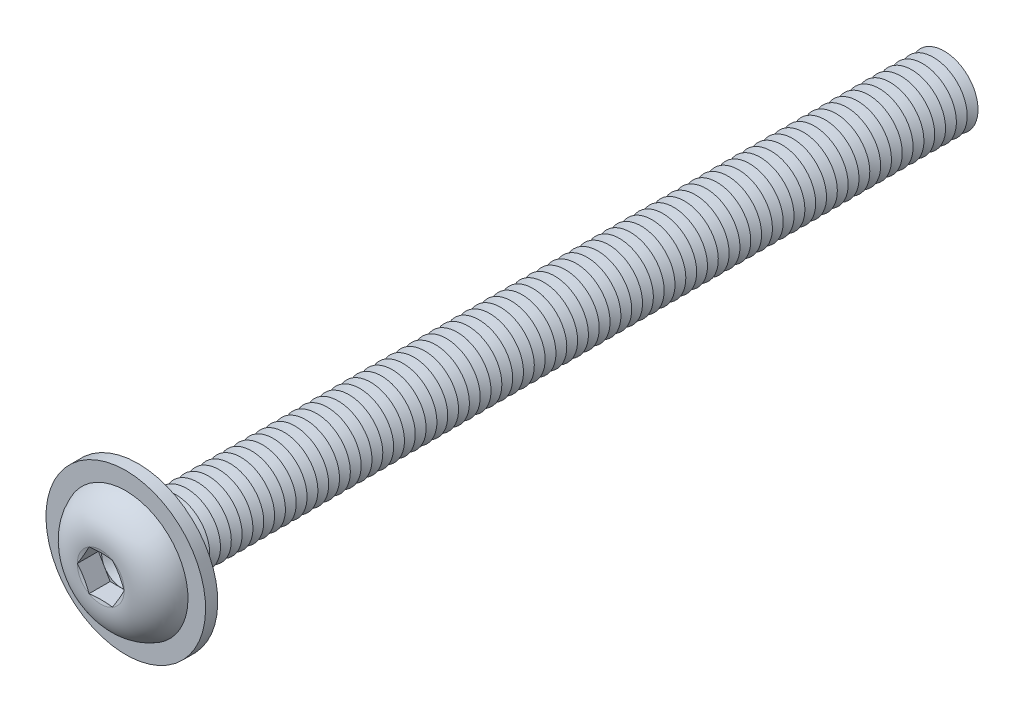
ISO-10303-21;
HEADER;
FILE_DESCRIPTION(('STEP AP214'),'2;1');
FILE_NAME('part.step','',(''),(''),'','','');
FILE_SCHEMA(('AUTOMOTIVE_DESIGN { 1 0 10303 214 1 1 1 1 }'));
ENDSEC;
DATA;
#1=APPLICATION_CONTEXT('core data for automotive mechanical design processes');
#2=APPLICATION_PROTOCOL_DEFINITION('international standard','automotive_design',2000,#1);
#3=PRODUCT_CONTEXT('',#1,'mechanical');
#4=PRODUCT('Part','Part','',(#3));
#5=PRODUCT_RELATED_PRODUCT_CATEGORY('part','',(#4));
#6=PRODUCT_DEFINITION_FORMATION('','',#4);
#7=PRODUCT_DEFINITION_CONTEXT('part definition',#1,'design');
#8=PRODUCT_DEFINITION('design','',#6,#7);
#9=PRODUCT_DEFINITION_SHAPE('','',#8);
#10=(LENGTH_UNIT() NAMED_UNIT(*) SI_UNIT(.MILLI.,.METRE.));
#11=(NAMED_UNIT(*) PLANE_ANGLE_UNIT() SI_UNIT($,.RADIAN.));
#12=(NAMED_UNIT(*) SI_UNIT($,.STERADIAN.) SOLID_ANGLE_UNIT());
#13=UNCERTAINTY_MEASURE_WITH_UNIT(LENGTH_MEASURE(1.E-05),#10,'distance_accuracy_value','');
#14=(GEOMETRIC_REPRESENTATION_CONTEXT(3) GLOBAL_UNCERTAINTY_ASSIGNED_CONTEXT((#13)) GLOBAL_UNIT_ASSIGNED_CONTEXT((#10,
#11,#12)) REPRESENTATION_CONTEXT('',''));
#15=CARTESIAN_POINT('',(0.,0.,0.));
#16=DIRECTION('',(0.,0.,1.));
#17=DIRECTION('',(1.,0.,0.));
#18=AXIS2_PLACEMENT_3D('',#15,#16,#17);
#19=CARTESIAN_POINT('',(0.,0.,-57.2));
#20=DIRECTION('',(0.,0.,1.));
#21=DIRECTION('',(0.,-1.,0.));
#22=AXIS2_PLACEMENT_3D('',#19,#20,#21);
#23=CONICAL_SURFACE('',#22,2.49999999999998,1.0471975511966);
#24=CARTESIAN_POINT('',(0.,0.,-57.6));
#25=DIRECTION('',(0.,0.,1.));
#26=DIRECTION('',(0.,-1.,0.));
#27=AXIS2_PLACEMENT_3D('',#24,#25,#26);
#28=CIRCLE('',#27,1.80717967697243);
#29=CARTESIAN_POINT('',(0.,-1.8071796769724,-57.6));
#30=VERTEX_POINT('',#29);
#31=EDGE_CURVE('E810',#30,#30,#28,.T.);
#32=ORIENTED_EDGE('',*,*,#31,.T.);
#33=EDGE_LOOP('',(#32));
#34=FACE_BOUND('',#33,.T.);
#35=CARTESIAN_POINT('',(0.,0.,-57.2));
#36=DIRECTION('',(0.,0.,1.));
#37=DIRECTION('',(0.,-1.,0.));
#38=AXIS2_PLACEMENT_3D('',#35,#36,#37);
#39=CIRCLE('',#38,2.49999999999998);
#40=CARTESIAN_POINT('',(0.,-2.49999999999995,-57.2));
#41=VERTEX_POINT('',#40);
#42=EDGE_CURVE('E806',#41,#41,#39,.T.);
#43=ORIENTED_EDGE('',*,*,#42,.F.);
#44=EDGE_LOOP('',(#43));
#45=FACE_BOUND('',#44,.T.);
#46=ADVANCED_FACE('F39',(#34,#45),#23,.T.);
#47=CARTESIAN_POINT('',(0.,0.,-57.6));
#48=DIRECTION('',(0.,0.,-1.));
#49=DIRECTION('',(0.,1.,0.));
#50=AXIS2_PLACEMENT_3D('',#47,#48,#49);
#51=CONICAL_SURFACE('',#50,1.80717967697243,1.04719755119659);
#52=CARTESIAN_POINT('',(0.,0.,-58.));
#53=DIRECTION('',(0.,0.,1.));
#54=DIRECTION('',(0.,-1.,0.));
#55=AXIS2_PLACEMENT_3D('',#52,#53,#54);
#56=CIRCLE('',#55,2.49999999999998);
#57=CARTESIAN_POINT('',(0.,-2.49999999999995,-58.));
#58=VERTEX_POINT('',#57);
#59=EDGE_CURVE('E814',#58,#58,#56,.T.);
#60=ORIENTED_EDGE('',*,*,#59,.T.);
#61=EDGE_LOOP('',(#60));
#62=FACE_BOUND('',#61,.T.);
#63=ORIENTED_EDGE('',*,*,#31,.F.);
#64=EDGE_LOOP('',(#63));
#65=FACE_BOUND('',#64,.T.);
#66=ADVANCED_FACE('F929',(#62,#65),#51,.T.);
#67=CARTESIAN_POINT('',(0.,2.49999999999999,-60.));
#68=DIRECTION('',(0.,0.,-1.));
#69=DIRECTION('',(0.,1.,0.));
#70=AXIS2_PLACEMENT_3D('',#67,#68,#69);
#71=PLANE('',#70);
#72=CARTESIAN_POINT('',(0.,0.,-60.));
#73=DIRECTION('',(0.,0.,1.));
#74=DIRECTION('',(0.,-1.,0.));
#75=AXIS2_PLACEMENT_3D('',#72,#73,#74);
#76=CIRCLE('',#75,1.80717967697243);
#77=CARTESIAN_POINT('',(0.,-1.8071796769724,-60.));
#78=VERTEX_POINT('',#77);
#79=EDGE_CURVE('E833',#78,#78,#76,.T.);
#80=ORIENTED_EDGE('',*,*,#79,.F.);
#81=EDGE_LOOP('',(#80));
#82=FACE_BOUND('',#81,.T.);
#83=ADVANCED_FACE('F935',(#82),#71,.T.);
#84=CARTESIAN_POINT('',(0.,0.,-59.6));
#85=DIRECTION('',(0.,0.,1.));
#86=DIRECTION('',(0.,-1.,0.));
#87=AXIS2_PLACEMENT_3D('',#84,#85,#86);
#88=CONICAL_SURFACE('',#87,2.49999999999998,1.0471975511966);
#89=ORIENTED_EDGE('',*,*,#79,.T.);
#90=EDGE_LOOP('',(#89));
#91=FACE_BOUND('',#90,.T.);
#92=CARTESIAN_POINT('',(0.,0.,-59.6));
#93=DIRECTION('',(0.,0.,1.));
#94=DIRECTION('',(0.,-1.,0.));
#95=AXIS2_PLACEMENT_3D('',#92,#93,#94);
#96=CIRCLE('',#95,2.49999999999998);
#97=CARTESIAN_POINT('',(0.,-2.49999999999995,-59.6));
#98=VERTEX_POINT('',#97);
#99=EDGE_CURVE('E829',#98,#98,#96,.T.);
#100=ORIENTED_EDGE('',*,*,#99,.F.);
#101=EDGE_LOOP('',(#100));
#102=FACE_BOUND('',#101,.T.);
#103=ADVANCED_FACE('F954',(#91,#102),#88,.T.);
#104=CARTESIAN_POINT('',(0.,0.,-59.2));
#105=DIRECTION('',(0.,0.,-1.));
#106=DIRECTION('',(0.,1.,0.));
#107=AXIS2_PLACEMENT_3D('',#104,#105,#106);
#108=CONICAL_SURFACE('',#107,1.80717967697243,1.04719755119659);
#109=ORIENTED_EDGE('',*,*,#99,.T.);
#110=EDGE_LOOP('',(#109));
#111=FACE_BOUND('',#110,.T.);
#112=CARTESIAN_POINT('',(0.,0.,-59.2));
#113=DIRECTION('',(0.,0.,1.));
#114=DIRECTION('',(0.,-1.,0.));
#115=AXIS2_PLACEMENT_3D('',#112,#113,#114);
#116=CIRCLE('',#115,1.80717967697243);
#117=CARTESIAN_POINT('',(0.,-1.8071796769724,-59.2));
#118=VERTEX_POINT('',#117);
#119=EDGE_CURVE('E825',#118,#118,#116,.T.);
#120=ORIENTED_EDGE('',*,*,#119,.F.);
#121=EDGE_LOOP('',(#120));
#122=FACE_BOUND('',#121,.T.);
#123=ADVANCED_FACE('F951',(#111,#122),#108,.T.);
#124=CARTESIAN_POINT('',(0.,0.,-58.8));
#125=DIRECTION('',(0.,0.,1.));
#126=DIRECTION('',(0.,-1.,0.));
#127=AXIS2_PLACEMENT_3D('',#124,#125,#126);
#128=CONICAL_SURFACE('',#127,2.49999999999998,1.0471975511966);
#129=ORIENTED_EDGE('',*,*,#119,.T.);
#130=EDGE_LOOP('',(#129));
#131=FACE_BOUND('',#130,.T.);
#132=CARTESIAN_POINT('',(0.,0.,-58.8));
#133=DIRECTION('',(0.,0.,1.));
#134=DIRECTION('',(0.,-1.,0.));
#135=AXIS2_PLACEMENT_3D('',#132,#133,#134);
#136=CIRCLE('',#135,2.49999999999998);
#137=CARTESIAN_POINT('',(0.,-2.49999999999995,-58.8));
#138=VERTEX_POINT('',#137);
#139=EDGE_CURVE('E821',#138,#138,#136,.T.);
#140=ORIENTED_EDGE('',*,*,#139,.F.);
#141=EDGE_LOOP('',(#140));
#142=FACE_BOUND('',#141,.T.);
#143=ADVANCED_FACE('F945',(#131,#142),#128,.T.);
#144=CARTESIAN_POINT('',(0.,0.,-58.4));
#145=DIRECTION('',(0.,0.,-1.));
#146=DIRECTION('',(0.,1.,0.));
#147=AXIS2_PLACEMENT_3D('',#144,#145,#146);
#148=CONICAL_SURFACE('',#147,1.80717967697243,1.04719755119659);
#149=ORIENTED_EDGE('',*,*,#139,.T.);
#150=EDGE_LOOP('',(#149));
#151=FACE_BOUND('',#150,.T.);
#152=CARTESIAN_POINT('',(0.,0.,-58.4));
#153=DIRECTION('',(0.,0.,1.));
#154=DIRECTION('',(0.,-1.,0.));
#155=AXIS2_PLACEMENT_3D('',#152,#153,#154);
#156=CIRCLE('',#155,1.80717967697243);
#157=CARTESIAN_POINT('',(0.,-1.8071796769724,-58.4));
#158=VERTEX_POINT('',#157);
#159=EDGE_CURVE('E817',#158,#158,#156,.T.);
#160=ORIENTED_EDGE('',*,*,#159,.F.);
#161=EDGE_LOOP('',(#160));
#162=FACE_BOUND('',#161,.T.);
#163=ADVANCED_FACE('F941',(#151,#162),#148,.T.);
#164=CARTESIAN_POINT('',(0.,0.,-58.));
#165=DIRECTION('',(0.,0.,1.));
#166=DIRECTION('',(0.,-1.,0.));
#167=AXIS2_PLACEMENT_3D('',#164,#165,#166);
#168=CONICAL_SURFACE('',#167,2.49999999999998,1.0471975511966);
#169=ORIENTED_EDGE('',*,*,#159,.T.);
#170=EDGE_LOOP('',(#169));
#171=FACE_BOUND('',#170,.T.);
#172=ORIENTED_EDGE('',*,*,#59,.F.);
#173=EDGE_LOOP('',(#172));
#174=FACE_BOUND('',#173,.T.);
#175=ADVANCED_FACE('F944',(#171,#174),#168,.T.);
#176=CARTESIAN_POINT('',(0.,0.,-56.4));
#177=DIRECTION('',(0.,0.,1.));
#178=DIRECTION('',(0.,-1.,0.));
#179=AXIS2_PLACEMENT_3D('',#176,#177,#178);
#180=CONICAL_SURFACE('',#179,2.49999999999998,1.0471975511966);
#181=CARTESIAN_POINT('',(0.,0.,-56.8));
#182=DIRECTION('',(0.,0.,1.));
#183=DIRECTION('',(0.,-1.,0.));
#184=AXIS2_PLACEMENT_3D('',#181,#182,#183);
#185=CIRCLE('',#184,1.80717967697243);
#186=CARTESIAN_POINT('',(0.,-1.8071796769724,-56.8));
#187=VERTEX_POINT('',#186);
#188=EDGE_CURVE('E802',#187,#187,#185,.T.);
#189=ORIENTED_EDGE('',*,*,#188,.T.);
#190=EDGE_LOOP('',(#189));
#191=FACE_BOUND('',#190,.T.);
#192=CARTESIAN_POINT('',(0.,0.,-56.4));
#193=DIRECTION('',(0.,0.,1.));
#194=DIRECTION('',(0.,-1.,0.));
#195=AXIS2_PLACEMENT_3D('',#192,#193,#194);
#196=CIRCLE('',#195,2.49999999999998);
#197=CARTESIAN_POINT('',(0.,-2.49999999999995,-56.4));
#198=VERTEX_POINT('',#197);
#199=EDGE_CURVE('E798',#198,#198,#196,.T.);
#200=ORIENTED_EDGE('',*,*,#199,.F.);
#201=EDGE_LOOP('',(#200));
#202=FACE_BOUND('',#201,.T.);
#203=ADVANCED_FACE('F949',(#191,#202),#180,.T.);
#204=CARTESIAN_POINT('',(0.,0.,-56.8));
#205=DIRECTION('',(0.,0.,-1.));
#206=DIRECTION('',(0.,1.,0.));
#207=AXIS2_PLACEMENT_3D('',#204,#205,#206);
#208=CONICAL_SURFACE('',#207,1.80717967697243,1.04719755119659);
#209=ORIENTED_EDGE('',*,*,#42,.T.);
#210=EDGE_LOOP('',(#209));
#211=FACE_BOUND('',#210,.T.);
#212=ORIENTED_EDGE('',*,*,#188,.F.);
#213=EDGE_LOOP('',(#212));
#214=FACE_BOUND('',#213,.T.);
#215=ADVANCED_FACE('F1000',(#211,#214),#208,.T.);
#216=CARTESIAN_POINT('',(0.,0.,-55.6));
#217=DIRECTION('',(0.,0.,1.));
#218=DIRECTION('',(0.,-1.,0.));
#219=AXIS2_PLACEMENT_3D('',#216,#217,#218);
#220=CONICAL_SURFACE('',#219,2.49999999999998,1.0471975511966);
#221=CARTESIAN_POINT('',(0.,0.,-56.));
#222=DIRECTION('',(0.,0.,1.));
#223=DIRECTION('',(0.,-1.,0.));
#224=AXIS2_PLACEMENT_3D('',#221,#222,#223);
#225=CIRCLE('',#224,1.80717967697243);
#226=CARTESIAN_POINT('',(0.,-1.8071796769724,-56.));
#227=VERTEX_POINT('',#226);
#228=EDGE_CURVE('E794',#227,#227,#225,.T.);
#229=ORIENTED_EDGE('',*,*,#228,.T.);
#230=EDGE_LOOP('',(#229));
#231=FACE_BOUND('',#230,.T.);
#232=CARTESIAN_POINT('',(0.,0.,-55.6));
#233=DIRECTION('',(0.,0.,1.));
#234=DIRECTION('',(0.,-1.,0.));
#235=AXIS2_PLACEMENT_3D('',#232,#233,#234);
#236=CIRCLE('',#235,2.49999999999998);
#237=CARTESIAN_POINT('',(0.,-2.49999999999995,-55.6));
#238=VERTEX_POINT('',#237);
#239=EDGE_CURVE('E790',#238,#238,#236,.T.);
#240=ORIENTED_EDGE('',*,*,#239,.F.);
#241=EDGE_LOOP('',(#240));
#242=FACE_BOUND('',#241,.T.);
#243=ADVANCED_FACE('F1006',(#231,#242),#220,.T.);
#244=CARTESIAN_POINT('',(0.,0.,-56.));
#245=DIRECTION('',(0.,0.,-1.));
#246=DIRECTION('',(0.,1.,0.));
#247=AXIS2_PLACEMENT_3D('',#244,#245,#246);
#248=CONICAL_SURFACE('',#247,1.80717967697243,1.04719755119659);
#249=ORIENTED_EDGE('',*,*,#199,.T.);
#250=EDGE_LOOP('',(#249));
#251=FACE_BOUND('',#250,.T.);
#252=ORIENTED_EDGE('',*,*,#228,.F.);
#253=EDGE_LOOP('',(#252));
#254=FACE_BOUND('',#253,.T.);
#255=ADVANCED_FACE('F1013',(#251,#254),#248,.T.);
#256=CARTESIAN_POINT('',(0.,0.,-54.8));
#257=DIRECTION('',(0.,0.,1.));
#258=DIRECTION('',(0.,-1.,0.));
#259=AXIS2_PLACEMENT_3D('',#256,#257,#258);
#260=CONICAL_SURFACE('',#259,2.49999999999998,1.0471975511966);
#261=CARTESIAN_POINT('',(0.,0.,-55.2));
#262=DIRECTION('',(0.,0.,1.));
#263=DIRECTION('',(0.,-1.,0.));
#264=AXIS2_PLACEMENT_3D('',#261,#262,#263);
#265=CIRCLE('',#264,1.80717967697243);
#266=CARTESIAN_POINT('',(0.,-1.8071796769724,-55.2));
#267=VERTEX_POINT('',#266);
#268=EDGE_CURVE('E786',#267,#267,#265,.T.);
#269=ORIENTED_EDGE('',*,*,#268,.T.);
#270=EDGE_LOOP('',(#269));
#271=FACE_BOUND('',#270,.T.);
#272=CARTESIAN_POINT('',(0.,0.,-54.8));
#273=DIRECTION('',(0.,0.,1.));
#274=DIRECTION('',(0.,-1.,0.));
#275=AXIS2_PLACEMENT_3D('',#272,#273,#274);
#276=CIRCLE('',#275,2.49999999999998);
#277=CARTESIAN_POINT('',(0.,-2.49999999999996,-54.8));
#278=VERTEX_POINT('',#277);
#279=EDGE_CURVE('E782',#278,#278,#276,.T.);
#280=ORIENTED_EDGE('',*,*,#279,.F.);
#281=EDGE_LOOP('',(#280));
#282=FACE_BOUND('',#281,.T.);
#283=ADVANCED_FACE('F1020',(#271,#282),#260,.T.);
#284=CARTESIAN_POINT('',(0.,0.,-55.2));
#285=DIRECTION('',(0.,0.,-1.));
#286=DIRECTION('',(0.,1.,0.));
#287=AXIS2_PLACEMENT_3D('',#284,#285,#286);
#288=CONICAL_SURFACE('',#287,1.80717967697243,1.04719755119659);
#289=ORIENTED_EDGE('',*,*,#239,.T.);
#290=EDGE_LOOP('',(#289));
#291=FACE_BOUND('',#290,.T.);
#292=ORIENTED_EDGE('',*,*,#268,.F.);
#293=EDGE_LOOP('',(#292));
#294=FACE_BOUND('',#293,.T.);
#295=ADVANCED_FACE('F1027',(#291,#294),#288,.T.);
#296=CARTESIAN_POINT('',(0.,0.,-54.));
#297=DIRECTION('',(0.,0.,1.));
#298=DIRECTION('',(0.,-1.,0.));
#299=AXIS2_PLACEMENT_3D('',#296,#297,#298);
#300=CONICAL_SURFACE('',#299,2.49999999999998,1.0471975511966);
#301=CARTESIAN_POINT('',(0.,0.,-54.4));
#302=DIRECTION('',(0.,0.,1.));
#303=DIRECTION('',(0.,-1.,0.));
#304=AXIS2_PLACEMENT_3D('',#301,#302,#303);
#305=CIRCLE('',#304,1.80717967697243);
#306=CARTESIAN_POINT('',(0.,-1.8071796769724,-54.4));
#307=VERTEX_POINT('',#306);
#308=EDGE_CURVE('E778',#307,#307,#305,.T.);
#309=ORIENTED_EDGE('',*,*,#308,.T.);
#310=EDGE_LOOP('',(#309));
#311=FACE_BOUND('',#310,.T.);
#312=CARTESIAN_POINT('',(0.,0.,-54.));
#313=DIRECTION('',(0.,0.,1.));
#314=DIRECTION('',(0.,-1.,0.));
#315=AXIS2_PLACEMENT_3D('',#312,#313,#314);
#316=CIRCLE('',#315,2.49999999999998);
#317=CARTESIAN_POINT('',(0.,-2.49999999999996,-54.));
#318=VERTEX_POINT('',#317);
#319=EDGE_CURVE('E774',#318,#318,#316,.T.);
#320=ORIENTED_EDGE('',*,*,#319,.F.);
#321=EDGE_LOOP('',(#320));
#322=FACE_BOUND('',#321,.T.);
#323=ADVANCED_FACE('F1034',(#311,#322),#300,.T.);
#324=CARTESIAN_POINT('',(0.,0.,-54.4));
#325=DIRECTION('',(0.,0.,-1.));
#326=DIRECTION('',(0.,1.,0.));
#327=AXIS2_PLACEMENT_3D('',#324,#325,#326);
#328=CONICAL_SURFACE('',#327,1.80717967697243,1.04719755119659);
#329=ORIENTED_EDGE('',*,*,#279,.T.);
#330=EDGE_LOOP('',(#329));
#331=FACE_BOUND('',#330,.T.);
#332=ORIENTED_EDGE('',*,*,#308,.F.);
#333=EDGE_LOOP('',(#332));
#334=FACE_BOUND('',#333,.T.);
#335=ADVANCED_FACE('F1041',(#331,#334),#328,.T.);
#336=CARTESIAN_POINT('',(0.,0.,-53.2));
#337=DIRECTION('',(0.,0.,1.));
#338=DIRECTION('',(0.,-1.,0.));
#339=AXIS2_PLACEMENT_3D('',#336,#337,#338);
#340=CONICAL_SURFACE('',#339,2.49999999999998,1.0471975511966);
#341=CARTESIAN_POINT('',(0.,0.,-53.6));
#342=DIRECTION('',(0.,0.,1.));
#343=DIRECTION('',(0.,-1.,0.));
#344=AXIS2_PLACEMENT_3D('',#341,#342,#343);
#345=CIRCLE('',#344,1.80717967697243);
#346=CARTESIAN_POINT('',(0.,-1.8071796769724,-53.6));
#347=VERTEX_POINT('',#346);
#348=EDGE_CURVE('E770',#347,#347,#345,.T.);
#349=ORIENTED_EDGE('',*,*,#348,.T.);
#350=EDGE_LOOP('',(#349));
#351=FACE_BOUND('',#350,.T.);
#352=CARTESIAN_POINT('',(0.,0.,-53.2));
#353=DIRECTION('',(0.,0.,1.));
#354=DIRECTION('',(0.,-1.,0.));
#355=AXIS2_PLACEMENT_3D('',#352,#353,#354);
#356=CIRCLE('',#355,2.49999999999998);
#357=CARTESIAN_POINT('',(0.,-2.49999999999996,-53.2));
#358=VERTEX_POINT('',#357);
#359=EDGE_CURVE('E766',#358,#358,#356,.T.);
#360=ORIENTED_EDGE('',*,*,#359,.F.);
#361=EDGE_LOOP('',(#360));
#362=FACE_BOUND('',#361,.T.);
#363=ADVANCED_FACE('F1048',(#351,#362),#340,.T.);
#364=CARTESIAN_POINT('',(0.,0.,-53.6));
#365=DIRECTION('',(0.,0.,-1.));
#366=DIRECTION('',(0.,1.,0.));
#367=AXIS2_PLACEMENT_3D('',#364,#365,#366);
#368=CONICAL_SURFACE('',#367,1.80717967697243,1.04719755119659);
#369=ORIENTED_EDGE('',*,*,#319,.T.);
#370=EDGE_LOOP('',(#369));
#371=FACE_BOUND('',#370,.T.);
#372=ORIENTED_EDGE('',*,*,#348,.F.);
#373=EDGE_LOOP('',(#372));
#374=FACE_BOUND('',#373,.T.);
#375=ADVANCED_FACE('F1055',(#371,#374),#368,.T.);
#376=CARTESIAN_POINT('',(0.,0.,-52.4));
#377=DIRECTION('',(0.,0.,1.));
#378=DIRECTION('',(0.,-1.,0.));
#379=AXIS2_PLACEMENT_3D('',#376,#377,#378);
#380=CONICAL_SURFACE('',#379,2.49999999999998,1.0471975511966);
#381=CARTESIAN_POINT('',(0.,0.,-52.8));
#382=DIRECTION('',(0.,0.,1.));
#383=DIRECTION('',(0.,-1.,0.));
#384=AXIS2_PLACEMENT_3D('',#381,#382,#383);
#385=CIRCLE('',#384,1.80717967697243);
#386=CARTESIAN_POINT('',(0.,-1.8071796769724,-52.8));
#387=VERTEX_POINT('',#386);
#388=EDGE_CURVE('E762',#387,#387,#385,.T.);
#389=ORIENTED_EDGE('',*,*,#388,.T.);
#390=EDGE_LOOP('',(#389));
#391=FACE_BOUND('',#390,.T.);
#392=CARTESIAN_POINT('',(0.,0.,-52.4));
#393=DIRECTION('',(0.,0.,1.));
#394=DIRECTION('',(0.,-1.,0.));
#395=AXIS2_PLACEMENT_3D('',#392,#393,#394);
#396=CIRCLE('',#395,2.49999999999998);
#397=CARTESIAN_POINT('',(0.,-2.49999999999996,-52.4));
#398=VERTEX_POINT('',#397);
#399=EDGE_CURVE('E758',#398,#398,#396,.T.);
#400=ORIENTED_EDGE('',*,*,#399,.F.);
#401=EDGE_LOOP('',(#400));
#402=FACE_BOUND('',#401,.T.);
#403=ADVANCED_FACE('F1062',(#391,#402),#380,.T.);
#404=CARTESIAN_POINT('',(0.,0.,-52.8));
#405=DIRECTION('',(0.,0.,-1.));
#406=DIRECTION('',(0.,1.,0.));
#407=AXIS2_PLACEMENT_3D('',#404,#405,#406);
#408=CONICAL_SURFACE('',#407,1.80717967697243,1.04719755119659);
#409=ORIENTED_EDGE('',*,*,#359,.T.);
#410=EDGE_LOOP('',(#409));
#411=FACE_BOUND('',#410,.T.);
#412=ORIENTED_EDGE('',*,*,#388,.F.);
#413=EDGE_LOOP('',(#412));
#414=FACE_BOUND('',#413,.T.);
#415=ADVANCED_FACE('F1069',(#411,#414),#408,.T.);
#416=CARTESIAN_POINT('',(0.,0.,-51.6));
#417=DIRECTION('',(0.,0.,1.));
#418=DIRECTION('',(0.,-1.,0.));
#419=AXIS2_PLACEMENT_3D('',#416,#417,#418);
#420=CONICAL_SURFACE('',#419,2.49999999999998,1.0471975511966);
#421=CARTESIAN_POINT('',(0.,0.,-52.));
#422=DIRECTION('',(0.,0.,1.));
#423=DIRECTION('',(0.,-1.,0.));
#424=AXIS2_PLACEMENT_3D('',#421,#422,#423);
#425=CIRCLE('',#424,1.80717967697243);
#426=CARTESIAN_POINT('',(0.,-1.8071796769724,-52.));
#427=VERTEX_POINT('',#426);
#428=EDGE_CURVE('E754',#427,#427,#425,.T.);
#429=ORIENTED_EDGE('',*,*,#428,.T.);
#430=EDGE_LOOP('',(#429));
#431=FACE_BOUND('',#430,.T.);
#432=CARTESIAN_POINT('',(0.,0.,-51.6));
#433=DIRECTION('',(0.,0.,1.));
#434=DIRECTION('',(0.,-1.,0.));
#435=AXIS2_PLACEMENT_3D('',#432,#433,#434);
#436=CIRCLE('',#435,2.49999999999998);
#437=CARTESIAN_POINT('',(0.,-2.49999999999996,-51.6));
#438=VERTEX_POINT('',#437);
#439=EDGE_CURVE('E750',#438,#438,#436,.T.);
#440=ORIENTED_EDGE('',*,*,#439,.F.);
#441=EDGE_LOOP('',(#440));
#442=FACE_BOUND('',#441,.T.);
#443=ADVANCED_FACE('F1076',(#431,#442),#420,.T.);
#444=CARTESIAN_POINT('',(0.,0.,-52.));
#445=DIRECTION('',(0.,0.,-1.));
#446=DIRECTION('',(0.,1.,0.));
#447=AXIS2_PLACEMENT_3D('',#444,#445,#446);
#448=CONICAL_SURFACE('',#447,1.80717967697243,1.04719755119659);
#449=ORIENTED_EDGE('',*,*,#399,.T.);
#450=EDGE_LOOP('',(#449));
#451=FACE_BOUND('',#450,.T.);
#452=ORIENTED_EDGE('',*,*,#428,.F.);
#453=EDGE_LOOP('',(#452));
#454=FACE_BOUND('',#453,.T.);
#455=ADVANCED_FACE('F1083',(#451,#454),#448,.T.);
#456=CARTESIAN_POINT('',(0.,0.,-50.8));
#457=DIRECTION('',(0.,0.,1.));
#458=DIRECTION('',(0.,-1.,0.));
#459=AXIS2_PLACEMENT_3D('',#456,#457,#458);
#460=CONICAL_SURFACE('',#459,2.49999999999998,1.0471975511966);
#461=CARTESIAN_POINT('',(0.,0.,-51.2));
#462=DIRECTION('',(0.,0.,1.));
#463=DIRECTION('',(0.,-1.,0.));
#464=AXIS2_PLACEMENT_3D('',#461,#462,#463);
#465=CIRCLE('',#464,1.80717967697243);
#466=CARTESIAN_POINT('',(0.,-1.80717967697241,-51.2));
#467=VERTEX_POINT('',#466);
#468=EDGE_CURVE('E746',#467,#467,#465,.T.);
#469=ORIENTED_EDGE('',*,*,#468,.T.);
#470=EDGE_LOOP('',(#469));
#471=FACE_BOUND('',#470,.T.);
#472=CARTESIAN_POINT('',(0.,0.,-50.8));
#473=DIRECTION('',(0.,0.,1.));
#474=DIRECTION('',(0.,-1.,0.));
#475=AXIS2_PLACEMENT_3D('',#472,#473,#474);
#476=CIRCLE('',#475,2.49999999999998);
#477=CARTESIAN_POINT('',(0.,-2.49999999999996,-50.8));
#478=VERTEX_POINT('',#477);
#479=EDGE_CURVE('E742',#478,#478,#476,.T.);
#480=ORIENTED_EDGE('',*,*,#479,.F.);
#481=EDGE_LOOP('',(#480));
#482=FACE_BOUND('',#481,.T.);
#483=ADVANCED_FACE('F1090',(#471,#482),#460,.T.);
#484=CARTESIAN_POINT('',(0.,0.,-51.2));
#485=DIRECTION('',(0.,0.,-1.));
#486=DIRECTION('',(0.,1.,0.));
#487=AXIS2_PLACEMENT_3D('',#484,#485,#486);
#488=CONICAL_SURFACE('',#487,1.80717967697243,1.04719755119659);
#489=ORIENTED_EDGE('',*,*,#439,.T.);
#490=EDGE_LOOP('',(#489));
#491=FACE_BOUND('',#490,.T.);
#492=ORIENTED_EDGE('',*,*,#468,.F.);
#493=EDGE_LOOP('',(#492));
#494=FACE_BOUND('',#493,.T.);
#495=ADVANCED_FACE('F1097',(#491,#494),#488,.T.);
#496=CARTESIAN_POINT('',(0.,0.,-50.));
#497=DIRECTION('',(0.,0.,1.));
#498=DIRECTION('',(0.,-1.,0.));
#499=AXIS2_PLACEMENT_3D('',#496,#497,#498);
#500=CONICAL_SURFACE('',#499,2.49999999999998,1.0471975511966);
#501=CARTESIAN_POINT('',(0.,0.,-50.4));
#502=DIRECTION('',(0.,0.,1.));
#503=DIRECTION('',(0.,-1.,0.));
#504=AXIS2_PLACEMENT_3D('',#501,#502,#503);
#505=CIRCLE('',#504,1.80717967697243);
#506=CARTESIAN_POINT('',(0.,-1.80717967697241,-50.4));
#507=VERTEX_POINT('',#506);
#508=EDGE_CURVE('E738',#507,#507,#505,.T.);
#509=ORIENTED_EDGE('',*,*,#508,.T.);
#510=EDGE_LOOP('',(#509));
#511=FACE_BOUND('',#510,.T.);
#512=CARTESIAN_POINT('',(0.,0.,-50.));
#513=DIRECTION('',(0.,0.,1.));
#514=DIRECTION('',(0.,-1.,0.));
#515=AXIS2_PLACEMENT_3D('',#512,#513,#514);
#516=CIRCLE('',#515,2.49999999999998);
#517=CARTESIAN_POINT('',(0.,-2.49999999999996,-50.));
#518=VERTEX_POINT('',#517);
#519=EDGE_CURVE('E734',#518,#518,#516,.T.);
#520=ORIENTED_EDGE('',*,*,#519,.F.);
#521=EDGE_LOOP('',(#520));
#522=FACE_BOUND('',#521,.T.);
#523=ADVANCED_FACE('F1104',(#511,#522),#500,.T.);
#524=CARTESIAN_POINT('',(0.,0.,-50.4));
#525=DIRECTION('',(0.,0.,-1.));
#526=DIRECTION('',(0.,1.,0.));
#527=AXIS2_PLACEMENT_3D('',#524,#525,#526);
#528=CONICAL_SURFACE('',#527,1.80717967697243,1.04719755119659);
#529=ORIENTED_EDGE('',*,*,#479,.T.);
#530=EDGE_LOOP('',(#529));
#531=FACE_BOUND('',#530,.T.);
#532=ORIENTED_EDGE('',*,*,#508,.F.);
#533=EDGE_LOOP('',(#532));
#534=FACE_BOUND('',#533,.T.);
#535=ADVANCED_FACE('F1111',(#531,#534),#528,.T.);
#536=CARTESIAN_POINT('',(0.,0.,-49.2));
#537=DIRECTION('',(0.,0.,1.));
#538=DIRECTION('',(0.,-1.,0.));
#539=AXIS2_PLACEMENT_3D('',#536,#537,#538);
#540=CONICAL_SURFACE('',#539,2.49999999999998,1.0471975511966);
#541=CARTESIAN_POINT('',(0.,0.,-49.6));
#542=DIRECTION('',(0.,0.,1.));
#543=DIRECTION('',(0.,-1.,0.));
#544=AXIS2_PLACEMENT_3D('',#541,#542,#543);
#545=CIRCLE('',#544,1.80717967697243);
#546=CARTESIAN_POINT('',(0.,-1.80717967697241,-49.6));
#547=VERTEX_POINT('',#546);
#548=EDGE_CURVE('E730',#547,#547,#545,.T.);
#549=ORIENTED_EDGE('',*,*,#548,.T.);
#550=EDGE_LOOP('',(#549));
#551=FACE_BOUND('',#550,.T.);
#552=CARTESIAN_POINT('',(0.,0.,-49.2));
#553=DIRECTION('',(0.,0.,1.));
#554=DIRECTION('',(0.,-1.,0.));
#555=AXIS2_PLACEMENT_3D('',#552,#553,#554);
#556=CIRCLE('',#555,2.49999999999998);
#557=CARTESIAN_POINT('',(0.,-2.49999999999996,-49.2));
#558=VERTEX_POINT('',#557);
#559=EDGE_CURVE('E726',#558,#558,#556,.T.);
#560=ORIENTED_EDGE('',*,*,#559,.F.);
#561=EDGE_LOOP('',(#560));
#562=FACE_BOUND('',#561,.T.);
#563=ADVANCED_FACE('F1118',(#551,#562),#540,.T.);
#564=CARTESIAN_POINT('',(0.,0.,-49.6));
#565=DIRECTION('',(0.,0.,-1.));
#566=DIRECTION('',(0.,1.,0.));
#567=AXIS2_PLACEMENT_3D('',#564,#565,#566);
#568=CONICAL_SURFACE('',#567,1.80717967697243,1.04719755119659);
#569=ORIENTED_EDGE('',*,*,#519,.T.);
#570=EDGE_LOOP('',(#569));
#571=FACE_BOUND('',#570,.T.);
#572=ORIENTED_EDGE('',*,*,#548,.F.);
#573=EDGE_LOOP('',(#572));
#574=FACE_BOUND('',#573,.T.);
#575=ADVANCED_FACE('F1125',(#571,#574),#568,.T.);
#576=CARTESIAN_POINT('',(0.,0.,-48.4));
#577=DIRECTION('',(0.,0.,1.));
#578=DIRECTION('',(0.,-1.,0.));
#579=AXIS2_PLACEMENT_3D('',#576,#577,#578);
#580=CONICAL_SURFACE('',#579,2.49999999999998,1.0471975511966);
#581=CARTESIAN_POINT('',(0.,0.,-48.8));
#582=DIRECTION('',(0.,0.,1.));
#583=DIRECTION('',(0.,-1.,0.));
#584=AXIS2_PLACEMENT_3D('',#581,#582,#583);
#585=CIRCLE('',#584,1.80717967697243);
#586=CARTESIAN_POINT('',(0.,-1.80717967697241,-48.8));
#587=VERTEX_POINT('',#586);
#588=EDGE_CURVE('E722',#587,#587,#585,.T.);
#589=ORIENTED_EDGE('',*,*,#588,.T.);
#590=EDGE_LOOP('',(#589));
#591=FACE_BOUND('',#590,.T.);
#592=CARTESIAN_POINT('',(0.,0.,-48.4));
#593=DIRECTION('',(0.,0.,1.));
#594=DIRECTION('',(0.,-1.,0.));
#595=AXIS2_PLACEMENT_3D('',#592,#593,#594);
#596=CIRCLE('',#595,2.49999999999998);
#597=CARTESIAN_POINT('',(0.,-2.49999999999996,-48.4));
#598=VERTEX_POINT('',#597);
#599=EDGE_CURVE('E718',#598,#598,#596,.T.);
#600=ORIENTED_EDGE('',*,*,#599,.F.);
#601=EDGE_LOOP('',(#600));
#602=FACE_BOUND('',#601,.T.);
#603=ADVANCED_FACE('F1132',(#591,#602),#580,.T.);
#604=CARTESIAN_POINT('',(0.,0.,-48.8));
#605=DIRECTION('',(0.,0.,-1.));
#606=DIRECTION('',(0.,1.,0.));
#607=AXIS2_PLACEMENT_3D('',#604,#605,#606);
#608=CONICAL_SURFACE('',#607,1.80717967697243,1.04719755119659);
#609=ORIENTED_EDGE('',*,*,#559,.T.);
#610=EDGE_LOOP('',(#609));
#611=FACE_BOUND('',#610,.T.);
#612=ORIENTED_EDGE('',*,*,#588,.F.);
#613=EDGE_LOOP('',(#612));
#614=FACE_BOUND('',#613,.T.);
#615=ADVANCED_FACE('F1139',(#611,#614),#608,.T.);
#616=CARTESIAN_POINT('',(0.,0.,-47.6));
#617=DIRECTION('',(0.,0.,1.));
#618=DIRECTION('',(0.,-1.,0.));
#619=AXIS2_PLACEMENT_3D('',#616,#617,#618);
#620=CONICAL_SURFACE('',#619,2.49999999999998,1.0471975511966);
#621=CARTESIAN_POINT('',(0.,0.,-48.));
#622=DIRECTION('',(0.,0.,1.));
#623=DIRECTION('',(0.,-1.,0.));
#624=AXIS2_PLACEMENT_3D('',#621,#622,#623);
#625=CIRCLE('',#624,1.80717967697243);
#626=CARTESIAN_POINT('',(0.,-1.80717967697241,-48.));
#627=VERTEX_POINT('',#626);
#628=EDGE_CURVE('E714',#627,#627,#625,.T.);
#629=ORIENTED_EDGE('',*,*,#628,.T.);
#630=EDGE_LOOP('',(#629));
#631=FACE_BOUND('',#630,.T.);
#632=CARTESIAN_POINT('',(0.,0.,-47.6));
#633=DIRECTION('',(0.,0.,1.));
#634=DIRECTION('',(0.,-1.,0.));
#635=AXIS2_PLACEMENT_3D('',#632,#633,#634);
#636=CIRCLE('',#635,2.49999999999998);
#637=CARTESIAN_POINT('',(0.,-2.49999999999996,-47.6));
#638=VERTEX_POINT('',#637);
#639=EDGE_CURVE('E710',#638,#638,#636,.T.);
#640=ORIENTED_EDGE('',*,*,#639,.F.);
#641=EDGE_LOOP('',(#640));
#642=FACE_BOUND('',#641,.T.);
#643=ADVANCED_FACE('F1146',(#631,#642),#620,.T.);
#644=CARTESIAN_POINT('',(0.,0.,-48.));
#645=DIRECTION('',(0.,0.,-1.));
#646=DIRECTION('',(0.,1.,0.));
#647=AXIS2_PLACEMENT_3D('',#644,#645,#646);
#648=CONICAL_SURFACE('',#647,1.80717967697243,1.04719755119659);
#649=ORIENTED_EDGE('',*,*,#599,.T.);
#650=EDGE_LOOP('',(#649));
#651=FACE_BOUND('',#650,.T.);
#652=ORIENTED_EDGE('',*,*,#628,.F.);
#653=EDGE_LOOP('',(#652));
#654=FACE_BOUND('',#653,.T.);
#655=ADVANCED_FACE('F1153',(#651,#654),#648,.T.);
#656=CARTESIAN_POINT('',(0.,0.,-46.8));
#657=DIRECTION('',(0.,0.,1.));
#658=DIRECTION('',(0.,-1.,0.));
#659=AXIS2_PLACEMENT_3D('',#656,#657,#658);
#660=CONICAL_SURFACE('',#659,2.49999999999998,1.0471975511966);
#661=CARTESIAN_POINT('',(0.,0.,-47.2));
#662=DIRECTION('',(0.,0.,1.));
#663=DIRECTION('',(0.,-1.,0.));
#664=AXIS2_PLACEMENT_3D('',#661,#662,#663);
#665=CIRCLE('',#664,1.80717967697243);
#666=CARTESIAN_POINT('',(0.,-1.80717967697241,-47.2));
#667=VERTEX_POINT('',#666);
#668=EDGE_CURVE('E706',#667,#667,#665,.T.);
#669=ORIENTED_EDGE('',*,*,#668,.T.);
#670=EDGE_LOOP('',(#669));
#671=FACE_BOUND('',#670,.T.);
#672=CARTESIAN_POINT('',(0.,0.,-46.8));
#673=DIRECTION('',(0.,0.,1.));
#674=DIRECTION('',(0.,-1.,0.));
#675=AXIS2_PLACEMENT_3D('',#672,#673,#674);
#676=CIRCLE('',#675,2.49999999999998);
#677=CARTESIAN_POINT('',(0.,-2.49999999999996,-46.8));
#678=VERTEX_POINT('',#677);
#679=EDGE_CURVE('E702',#678,#678,#676,.T.);
#680=ORIENTED_EDGE('',*,*,#679,.F.);
#681=EDGE_LOOP('',(#680));
#682=FACE_BOUND('',#681,.T.);
#683=ADVANCED_FACE('F1160',(#671,#682),#660,.T.);
#684=CARTESIAN_POINT('',(0.,0.,-47.2));
#685=DIRECTION('',(0.,0.,-1.));
#686=DIRECTION('',(0.,1.,0.));
#687=AXIS2_PLACEMENT_3D('',#684,#685,#686);
#688=CONICAL_SURFACE('',#687,1.80717967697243,1.04719755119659);
#689=ORIENTED_EDGE('',*,*,#639,.T.);
#690=EDGE_LOOP('',(#689));
#691=FACE_BOUND('',#690,.T.);
#692=ORIENTED_EDGE('',*,*,#668,.F.);
#693=EDGE_LOOP('',(#692));
#694=FACE_BOUND('',#693,.T.);
#695=ADVANCED_FACE('F1167',(#691,#694),#688,.T.);
#696=CARTESIAN_POINT('',(0.,0.,-46.));
#697=DIRECTION('',(0.,0.,1.));
#698=DIRECTION('',(0.,-1.,0.));
#699=AXIS2_PLACEMENT_3D('',#696,#697,#698);
#700=CONICAL_SURFACE('',#699,2.49999999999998,1.0471975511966);
#701=CARTESIAN_POINT('',(0.,0.,-46.4));
#702=DIRECTION('',(0.,0.,1.));
#703=DIRECTION('',(0.,-1.,0.));
#704=AXIS2_PLACEMENT_3D('',#701,#702,#703);
#705=CIRCLE('',#704,1.80717967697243);
#706=CARTESIAN_POINT('',(0.,-1.80717967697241,-46.4));
#707=VERTEX_POINT('',#706);
#708=EDGE_CURVE('E698',#707,#707,#705,.T.);
#709=ORIENTED_EDGE('',*,*,#708,.T.);
#710=EDGE_LOOP('',(#709));
#711=FACE_BOUND('',#710,.T.);
#712=CARTESIAN_POINT('',(0.,0.,-46.));
#713=DIRECTION('',(0.,0.,1.));
#714=DIRECTION('',(0.,-1.,0.));
#715=AXIS2_PLACEMENT_3D('',#712,#713,#714);
#716=CIRCLE('',#715,2.49999999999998);
#717=CARTESIAN_POINT('',(0.,-2.49999999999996,-46.));
#718=VERTEX_POINT('',#717);
#719=EDGE_CURVE('E694',#718,#718,#716,.T.);
#720=ORIENTED_EDGE('',*,*,#719,.F.);
#721=EDGE_LOOP('',(#720));
#722=FACE_BOUND('',#721,.T.);
#723=ADVANCED_FACE('F1174',(#711,#722),#700,.T.);
#724=CARTESIAN_POINT('',(0.,0.,-46.4));
#725=DIRECTION('',(0.,0.,-1.));
#726=DIRECTION('',(0.,1.,0.));
#727=AXIS2_PLACEMENT_3D('',#724,#725,#726);
#728=CONICAL_SURFACE('',#727,1.80717967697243,1.04719755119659);
#729=ORIENTED_EDGE('',*,*,#679,.T.);
#730=EDGE_LOOP('',(#729));
#731=FACE_BOUND('',#730,.T.);
#732=ORIENTED_EDGE('',*,*,#708,.F.);
#733=EDGE_LOOP('',(#732));
#734=FACE_BOUND('',#733,.T.);
#735=ADVANCED_FACE('F1181',(#731,#734),#728,.T.);
#736=CARTESIAN_POINT('',(0.,0.,-45.2));
#737=DIRECTION('',(0.,0.,1.));
#738=DIRECTION('',(0.,-1.,0.));
#739=AXIS2_PLACEMENT_3D('',#736,#737,#738);
#740=CONICAL_SURFACE('',#739,2.49999999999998,1.0471975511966);
#741=CARTESIAN_POINT('',(0.,0.,-45.6));
#742=DIRECTION('',(0.,0.,1.));
#743=DIRECTION('',(0.,-1.,0.));
#744=AXIS2_PLACEMENT_3D('',#741,#742,#743);
#745=CIRCLE('',#744,1.80717967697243);
#746=CARTESIAN_POINT('',(0.,-1.80717967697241,-45.6));
#747=VERTEX_POINT('',#746);
#748=EDGE_CURVE('E690',#747,#747,#745,.T.);
#749=ORIENTED_EDGE('',*,*,#748,.T.);
#750=EDGE_LOOP('',(#749));
#751=FACE_BOUND('',#750,.T.);
#752=CARTESIAN_POINT('',(0.,0.,-45.2));
#753=DIRECTION('',(0.,0.,1.));
#754=DIRECTION('',(0.,-1.,0.));
#755=AXIS2_PLACEMENT_3D('',#752,#753,#754);
#756=CIRCLE('',#755,2.49999999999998);
#757=CARTESIAN_POINT('',(0.,-2.49999999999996,-45.2));
#758=VERTEX_POINT('',#757);
#759=EDGE_CURVE('E686',#758,#758,#756,.T.);
#760=ORIENTED_EDGE('',*,*,#759,.F.);
#761=EDGE_LOOP('',(#760));
#762=FACE_BOUND('',#761,.T.);
#763=ADVANCED_FACE('F1188',(#751,#762),#740,.T.);
#764=CARTESIAN_POINT('',(0.,0.,-45.6));
#765=DIRECTION('',(0.,0.,-1.));
#766=DIRECTION('',(0.,1.,0.));
#767=AXIS2_PLACEMENT_3D('',#764,#765,#766);
#768=CONICAL_SURFACE('',#767,1.80717967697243,1.04719755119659);
#769=ORIENTED_EDGE('',*,*,#719,.T.);
#770=EDGE_LOOP('',(#769));
#771=FACE_BOUND('',#770,.T.);
#772=ORIENTED_EDGE('',*,*,#748,.F.);
#773=EDGE_LOOP('',(#772));
#774=FACE_BOUND('',#773,.T.);
#775=ADVANCED_FACE('F1195',(#771,#774),#768,.T.);
#776=CARTESIAN_POINT('',(0.,0.,-44.4));
#777=DIRECTION('',(0.,0.,1.));
#778=DIRECTION('',(0.,-1.,0.));
#779=AXIS2_PLACEMENT_3D('',#776,#777,#778);
#780=CONICAL_SURFACE('',#779,2.49999999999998,1.0471975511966);
#781=CARTESIAN_POINT('',(0.,0.,-44.8));
#782=DIRECTION('',(0.,0.,1.));
#783=DIRECTION('',(0.,-1.,0.));
#784=AXIS2_PLACEMENT_3D('',#781,#782,#783);
#785=CIRCLE('',#784,1.80717967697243);
#786=CARTESIAN_POINT('',(0.,-1.80717967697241,-44.8));
#787=VERTEX_POINT('',#786);
#788=EDGE_CURVE('E682',#787,#787,#785,.T.);
#789=ORIENTED_EDGE('',*,*,#788,.T.);
#790=EDGE_LOOP('',(#789));
#791=FACE_BOUND('',#790,.T.);
#792=CARTESIAN_POINT('',(0.,0.,-44.4));
#793=DIRECTION('',(0.,0.,1.));
#794=DIRECTION('',(0.,-1.,0.));
#795=AXIS2_PLACEMENT_3D('',#792,#793,#794);
#796=CIRCLE('',#795,2.49999999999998);
#797=CARTESIAN_POINT('',(0.,-2.49999999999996,-44.4));
#798=VERTEX_POINT('',#797);
#799=EDGE_CURVE('E678',#798,#798,#796,.T.);
#800=ORIENTED_EDGE('',*,*,#799,.F.);
#801=EDGE_LOOP('',(#800));
#802=FACE_BOUND('',#801,.T.);
#803=ADVANCED_FACE('F1202',(#791,#802),#780,.T.);
#804=CARTESIAN_POINT('',(0.,0.,-44.8));
#805=DIRECTION('',(0.,0.,-1.));
#806=DIRECTION('',(0.,1.,0.));
#807=AXIS2_PLACEMENT_3D('',#804,#805,#806);
#808=CONICAL_SURFACE('',#807,1.80717967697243,1.04719755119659);
#809=ORIENTED_EDGE('',*,*,#759,.T.);
#810=EDGE_LOOP('',(#809));
#811=FACE_BOUND('',#810,.T.);
#812=ORIENTED_EDGE('',*,*,#788,.F.);
#813=EDGE_LOOP('',(#812));
#814=FACE_BOUND('',#813,.T.);
#815=ADVANCED_FACE('F1209',(#811,#814),#808,.T.);
#816=CARTESIAN_POINT('',(0.,0.,-43.6));
#817=DIRECTION('',(0.,0.,1.));
#818=DIRECTION('',(0.,-1.,0.));
#819=AXIS2_PLACEMENT_3D('',#816,#817,#818);
#820=CONICAL_SURFACE('',#819,2.49999999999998,1.0471975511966);
#821=CARTESIAN_POINT('',(0.,0.,-44.));
#822=DIRECTION('',(0.,0.,1.));
#823=DIRECTION('',(0.,-1.,0.));
#824=AXIS2_PLACEMENT_3D('',#821,#822,#823);
#825=CIRCLE('',#824,1.80717967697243);
#826=CARTESIAN_POINT('',(0.,-1.80717967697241,-44.));
#827=VERTEX_POINT('',#826);
#828=EDGE_CURVE('E674',#827,#827,#825,.T.);
#829=ORIENTED_EDGE('',*,*,#828,.T.);
#830=EDGE_LOOP('',(#829));
#831=FACE_BOUND('',#830,.T.);
#832=CARTESIAN_POINT('',(0.,0.,-43.6));
#833=DIRECTION('',(0.,0.,1.));
#834=DIRECTION('',(0.,-1.,0.));
#835=AXIS2_PLACEMENT_3D('',#832,#833,#834);
#836=CIRCLE('',#835,2.49999999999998);
#837=CARTESIAN_POINT('',(0.,-2.49999999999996,-43.6));
#838=VERTEX_POINT('',#837);
#839=EDGE_CURVE('E670',#838,#838,#836,.T.);
#840=ORIENTED_EDGE('',*,*,#839,.F.);
#841=EDGE_LOOP('',(#840));
#842=FACE_BOUND('',#841,.T.);
#843=ADVANCED_FACE('F1216',(#831,#842),#820,.T.);
#844=CARTESIAN_POINT('',(0.,0.,-44.));
#845=DIRECTION('',(0.,0.,-1.));
#846=DIRECTION('',(0.,1.,0.));
#847=AXIS2_PLACEMENT_3D('',#844,#845,#846);
#848=CONICAL_SURFACE('',#847,1.80717967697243,1.04719755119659);
#849=ORIENTED_EDGE('',*,*,#799,.T.);
#850=EDGE_LOOP('',(#849));
#851=FACE_BOUND('',#850,.T.);
#852=ORIENTED_EDGE('',*,*,#828,.F.);
#853=EDGE_LOOP('',(#852));
#854=FACE_BOUND('',#853,.T.);
#855=ADVANCED_FACE('F1223',(#851,#854),#848,.T.);
#856=CARTESIAN_POINT('',(0.,0.,-42.8));
#857=DIRECTION('',(0.,0.,1.));
#858=DIRECTION('',(0.,-1.,0.));
#859=AXIS2_PLACEMENT_3D('',#856,#857,#858);
#860=CONICAL_SURFACE('',#859,2.49999999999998,1.0471975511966);
#861=CARTESIAN_POINT('',(0.,0.,-43.2));
#862=DIRECTION('',(0.,0.,1.));
#863=DIRECTION('',(0.,-1.,0.));
#864=AXIS2_PLACEMENT_3D('',#861,#862,#863);
#865=CIRCLE('',#864,1.80717967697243);
#866=CARTESIAN_POINT('',(0.,-1.80717967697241,-43.2));
#867=VERTEX_POINT('',#866);
#868=EDGE_CURVE('E666',#867,#867,#865,.T.);
#869=ORIENTED_EDGE('',*,*,#868,.T.);
#870=EDGE_LOOP('',(#869));
#871=FACE_BOUND('',#870,.T.);
#872=CARTESIAN_POINT('',(0.,0.,-42.8));
#873=DIRECTION('',(0.,0.,1.));
#874=DIRECTION('',(0.,-1.,0.));
#875=AXIS2_PLACEMENT_3D('',#872,#873,#874);
#876=CIRCLE('',#875,2.49999999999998);
#877=CARTESIAN_POINT('',(0.,-2.49999999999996,-42.8));
#878=VERTEX_POINT('',#877);
#879=EDGE_CURVE('E662',#878,#878,#876,.T.);
#880=ORIENTED_EDGE('',*,*,#879,.F.);
#881=EDGE_LOOP('',(#880));
#882=FACE_BOUND('',#881,.T.);
#883=ADVANCED_FACE('F1230',(#871,#882),#860,.T.);
#884=CARTESIAN_POINT('',(0.,0.,-43.2));
#885=DIRECTION('',(0.,0.,-1.));
#886=DIRECTION('',(0.,1.,0.));
#887=AXIS2_PLACEMENT_3D('',#884,#885,#886);
#888=CONICAL_SURFACE('',#887,1.80717967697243,1.04719755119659);
#889=ORIENTED_EDGE('',*,*,#839,.T.);
#890=EDGE_LOOP('',(#889));
#891=FACE_BOUND('',#890,.T.);
#892=ORIENTED_EDGE('',*,*,#868,.F.);
#893=EDGE_LOOP('',(#892));
#894=FACE_BOUND('',#893,.T.);
#895=ADVANCED_FACE('F1237',(#891,#894),#888,.T.);
#896=CARTESIAN_POINT('',(0.,0.,-42.));
#897=DIRECTION('',(0.,0.,1.));
#898=DIRECTION('',(0.,-1.,0.));
#899=AXIS2_PLACEMENT_3D('',#896,#897,#898);
#900=CONICAL_SURFACE('',#899,2.49999999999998,1.0471975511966);
#901=CARTESIAN_POINT('',(0.,0.,-42.4));
#902=DIRECTION('',(0.,0.,1.));
#903=DIRECTION('',(0.,-1.,0.));
#904=AXIS2_PLACEMENT_3D('',#901,#902,#903);
#905=CIRCLE('',#904,1.80717967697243);
#906=CARTESIAN_POINT('',(0.,-1.80717967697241,-42.4));
#907=VERTEX_POINT('',#906);
#908=EDGE_CURVE('E658',#907,#907,#905,.T.);
#909=ORIENTED_EDGE('',*,*,#908,.T.);
#910=EDGE_LOOP('',(#909));
#911=FACE_BOUND('',#910,.T.);
#912=CARTESIAN_POINT('',(0.,0.,-42.));
#913=DIRECTION('',(0.,0.,1.));
#914=DIRECTION('',(0.,-1.,0.));
#915=AXIS2_PLACEMENT_3D('',#912,#913,#914);
#916=CIRCLE('',#915,2.49999999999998);
#917=CARTESIAN_POINT('',(0.,-2.49999999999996,-42.));
#918=VERTEX_POINT('',#917);
#919=EDGE_CURVE('E654',#918,#918,#916,.T.);
#920=ORIENTED_EDGE('',*,*,#919,.F.);
#921=EDGE_LOOP('',(#920));
#922=FACE_BOUND('',#921,.T.);
#923=ADVANCED_FACE('F1244',(#911,#922),#900,.T.);
#924=CARTESIAN_POINT('',(0.,0.,-42.4));
#925=DIRECTION('',(0.,0.,-1.));
#926=DIRECTION('',(0.,1.,0.));
#927=AXIS2_PLACEMENT_3D('',#924,#925,#926);
#928=CONICAL_SURFACE('',#927,1.80717967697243,1.04719755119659);
#929=ORIENTED_EDGE('',*,*,#879,.T.);
#930=EDGE_LOOP('',(#929));
#931=FACE_BOUND('',#930,.T.);
#932=ORIENTED_EDGE('',*,*,#908,.F.);
#933=EDGE_LOOP('',(#932));
#934=FACE_BOUND('',#933,.T.);
#935=ADVANCED_FACE('F1251',(#931,#934),#928,.T.);
#936=CARTESIAN_POINT('',(0.,0.,-41.2));
#937=DIRECTION('',(0.,0.,1.));
#938=DIRECTION('',(0.,-1.,0.));
#939=AXIS2_PLACEMENT_3D('',#936,#937,#938);
#940=CONICAL_SURFACE('',#939,2.49999999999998,1.0471975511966);
#941=CARTESIAN_POINT('',(0.,0.,-41.6));
#942=DIRECTION('',(0.,0.,1.));
#943=DIRECTION('',(0.,-1.,0.));
#944=AXIS2_PLACEMENT_3D('',#941,#942,#943);
#945=CIRCLE('',#944,1.80717967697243);
#946=CARTESIAN_POINT('',(0.,-1.80717967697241,-41.6));
#947=VERTEX_POINT('',#946);
#948=EDGE_CURVE('E650',#947,#947,#945,.T.);
#949=ORIENTED_EDGE('',*,*,#948,.T.);
#950=EDGE_LOOP('',(#949));
#951=FACE_BOUND('',#950,.T.);
#952=CARTESIAN_POINT('',(0.,0.,-41.2));
#953=DIRECTION('',(0.,0.,1.));
#954=DIRECTION('',(0.,-1.,0.));
#955=AXIS2_PLACEMENT_3D('',#952,#953,#954);
#956=CIRCLE('',#955,2.49999999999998);
#957=CARTESIAN_POINT('',(0.,-2.49999999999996,-41.2));
#958=VERTEX_POINT('',#957);
#959=EDGE_CURVE('E646',#958,#958,#956,.T.);
#960=ORIENTED_EDGE('',*,*,#959,.F.);
#961=EDGE_LOOP('',(#960));
#962=FACE_BOUND('',#961,.T.);
#963=ADVANCED_FACE('F1258',(#951,#962),#940,.T.);
#964=CARTESIAN_POINT('',(0.,0.,-41.6));
#965=DIRECTION('',(0.,0.,-1.));
#966=DIRECTION('',(0.,1.,0.));
#967=AXIS2_PLACEMENT_3D('',#964,#965,#966);
#968=CONICAL_SURFACE('',#967,1.80717967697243,1.04719755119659);
#969=ORIENTED_EDGE('',*,*,#919,.T.);
#970=EDGE_LOOP('',(#969));
#971=FACE_BOUND('',#970,.T.);
#972=ORIENTED_EDGE('',*,*,#948,.F.);
#973=EDGE_LOOP('',(#972));
#974=FACE_BOUND('',#973,.T.);
#975=ADVANCED_FACE('F1265',(#971,#974),#968,.T.);
#976=CARTESIAN_POINT('',(0.,0.,-40.4));
#977=DIRECTION('',(0.,0.,1.));
#978=DIRECTION('',(0.,-1.,0.));
#979=AXIS2_PLACEMENT_3D('',#976,#977,#978);
#980=CONICAL_SURFACE('',#979,2.49999999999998,1.0471975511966);
#981=CARTESIAN_POINT('',(0.,0.,-40.8));
#982=DIRECTION('',(0.,0.,1.));
#983=DIRECTION('',(0.,-1.,0.));
#984=AXIS2_PLACEMENT_3D('',#981,#982,#983);
#985=CIRCLE('',#984,1.80717967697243);
#986=CARTESIAN_POINT('',(0.,-1.80717967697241,-40.8));
#987=VERTEX_POINT('',#986);
#988=EDGE_CURVE('E642',#987,#987,#985,.T.);
#989=ORIENTED_EDGE('',*,*,#988,.T.);
#990=EDGE_LOOP('',(#989));
#991=FACE_BOUND('',#990,.T.);
#992=CARTESIAN_POINT('',(0.,0.,-40.4));
#993=DIRECTION('',(0.,0.,1.));
#994=DIRECTION('',(0.,-1.,0.));
#995=AXIS2_PLACEMENT_3D('',#992,#993,#994);
#996=CIRCLE('',#995,2.49999999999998);
#997=CARTESIAN_POINT('',(0.,-2.49999999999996,-40.4));
#998=VERTEX_POINT('',#997);
#999=EDGE_CURVE('E638',#998,#998,#996,.T.);
#1000=ORIENTED_EDGE('',*,*,#999,.F.);
#1001=EDGE_LOOP('',(#1000));
#1002=FACE_BOUND('',#1001,.T.);
#1003=ADVANCED_FACE('F1272',(#991,#1002),#980,.T.);
#1004=CARTESIAN_POINT('',(0.,0.,-40.8));
#1005=DIRECTION('',(0.,0.,-1.));
#1006=DIRECTION('',(0.,1.,0.));
#1007=AXIS2_PLACEMENT_3D('',#1004,#1005,#1006);
#1008=CONICAL_SURFACE('',#1007,1.80717967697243,1.04719755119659);
#1009=ORIENTED_EDGE('',*,*,#959,.T.);
#1010=EDGE_LOOP('',(#1009));
#1011=FACE_BOUND('',#1010,.T.);
#1012=ORIENTED_EDGE('',*,*,#988,.F.);
#1013=EDGE_LOOP('',(#1012));
#1014=FACE_BOUND('',#1013,.T.);
#1015=ADVANCED_FACE('F1279',(#1011,#1014),#1008,.T.);
#1016=CARTESIAN_POINT('',(0.,0.,-39.6));
#1017=DIRECTION('',(0.,0.,1.));
#1018=DIRECTION('',(0.,-1.,0.));
#1019=AXIS2_PLACEMENT_3D('',#1016,#1017,#1018);
#1020=CONICAL_SURFACE('',#1019,2.49999999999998,1.0471975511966);
#1021=CARTESIAN_POINT('',(0.,0.,-40.));
#1022=DIRECTION('',(0.,0.,1.));
#1023=DIRECTION('',(0.,-1.,0.));
#1024=AXIS2_PLACEMENT_3D('',#1021,#1022,#1023);
#1025=CIRCLE('',#1024,1.80717967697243);
#1026=CARTESIAN_POINT('',(0.,-1.80717967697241,-40.));
#1027=VERTEX_POINT('',#1026);
#1028=EDGE_CURVE('E634',#1027,#1027,#1025,.T.);
#1029=ORIENTED_EDGE('',*,*,#1028,.T.);
#1030=EDGE_LOOP('',(#1029));
#1031=FACE_BOUND('',#1030,.T.);
#1032=CARTESIAN_POINT('',(0.,0.,-39.6));
#1033=DIRECTION('',(0.,0.,1.));
#1034=DIRECTION('',(0.,-1.,0.));
#1035=AXIS2_PLACEMENT_3D('',#1032,#1033,#1034);
#1036=CIRCLE('',#1035,2.49999999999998);
#1037=CARTESIAN_POINT('',(0.,-2.49999999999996,-39.6));
#1038=VERTEX_POINT('',#1037);
#1039=EDGE_CURVE('E630',#1038,#1038,#1036,.T.);
#1040=ORIENTED_EDGE('',*,*,#1039,.F.);
#1041=EDGE_LOOP('',(#1040));
#1042=FACE_BOUND('',#1041,.T.);
#1043=ADVANCED_FACE('F1286',(#1031,#1042),#1020,.T.);
#1044=CARTESIAN_POINT('',(0.,0.,-40.));
#1045=DIRECTION('',(0.,0.,-1.));
#1046=DIRECTION('',(0.,1.,0.));
#1047=AXIS2_PLACEMENT_3D('',#1044,#1045,#1046);
#1048=CONICAL_SURFACE('',#1047,1.80717967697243,1.04719755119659);
#1049=ORIENTED_EDGE('',*,*,#999,.T.);
#1050=EDGE_LOOP('',(#1049));
#1051=FACE_BOUND('',#1050,.T.);
#1052=ORIENTED_EDGE('',*,*,#1028,.F.);
#1053=EDGE_LOOP('',(#1052));
#1054=FACE_BOUND('',#1053,.T.);
#1055=ADVANCED_FACE('F1293',(#1051,#1054),#1048,.T.);
#1056=CARTESIAN_POINT('',(0.,0.,-38.8));
#1057=DIRECTION('',(0.,0.,1.));
#1058=DIRECTION('',(0.,-1.,0.));
#1059=AXIS2_PLACEMENT_3D('',#1056,#1057,#1058);
#1060=CONICAL_SURFACE('',#1059,2.49999999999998,1.0471975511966);
#1061=CARTESIAN_POINT('',(0.,0.,-39.2));
#1062=DIRECTION('',(0.,0.,1.));
#1063=DIRECTION('',(0.,-1.,0.));
#1064=AXIS2_PLACEMENT_3D('',#1061,#1062,#1063);
#1065=CIRCLE('',#1064,1.80717967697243);
#1066=CARTESIAN_POINT('',(0.,-1.80717967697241,-39.2));
#1067=VERTEX_POINT('',#1066);
#1068=EDGE_CURVE('E626',#1067,#1067,#1065,.T.);
#1069=ORIENTED_EDGE('',*,*,#1068,.T.);
#1070=EDGE_LOOP('',(#1069));
#1071=FACE_BOUND('',#1070,.T.);
#1072=CARTESIAN_POINT('',(0.,0.,-38.8));
#1073=DIRECTION('',(0.,0.,1.));
#1074=DIRECTION('',(0.,-1.,0.));
#1075=AXIS2_PLACEMENT_3D('',#1072,#1073,#1074);
#1076=CIRCLE('',#1075,2.49999999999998);
#1077=CARTESIAN_POINT('',(0.,-2.49999999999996,-38.8));
#1078=VERTEX_POINT('',#1077);
#1079=EDGE_CURVE('E622',#1078,#1078,#1076,.T.);
#1080=ORIENTED_EDGE('',*,*,#1079,.F.);
#1081=EDGE_LOOP('',(#1080));
#1082=FACE_BOUND('',#1081,.T.);
#1083=ADVANCED_FACE('F1300',(#1071,#1082),#1060,.T.);
#1084=CARTESIAN_POINT('',(0.,0.,-39.2));
#1085=DIRECTION('',(0.,0.,-1.));
#1086=DIRECTION('',(0.,1.,0.));
#1087=AXIS2_PLACEMENT_3D('',#1084,#1085,#1086);
#1088=CONICAL_SURFACE('',#1087,1.80717967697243,1.04719755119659);
#1089=ORIENTED_EDGE('',*,*,#1039,.T.);
#1090=EDGE_LOOP('',(#1089));
#1091=FACE_BOUND('',#1090,.T.);
#1092=ORIENTED_EDGE('',*,*,#1068,.F.);
#1093=EDGE_LOOP('',(#1092));
#1094=FACE_BOUND('',#1093,.T.);
#1095=ADVANCED_FACE('F1307',(#1091,#1094),#1088,.T.);
#1096=CARTESIAN_POINT('',(0.,0.,-38.));
#1097=DIRECTION('',(0.,0.,1.));
#1098=DIRECTION('',(0.,-1.,0.));
#1099=AXIS2_PLACEMENT_3D('',#1096,#1097,#1098);
#1100=CONICAL_SURFACE('',#1099,2.49999999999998,1.0471975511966);
#1101=CARTESIAN_POINT('',(0.,0.,-38.4));
#1102=DIRECTION('',(0.,0.,1.));
#1103=DIRECTION('',(0.,-1.,0.));
#1104=AXIS2_PLACEMENT_3D('',#1101,#1102,#1103);
#1105=CIRCLE('',#1104,1.80717967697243);
#1106=CARTESIAN_POINT('',(0.,-1.80717967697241,-38.4));
#1107=VERTEX_POINT('',#1106);
#1108=EDGE_CURVE('E618',#1107,#1107,#1105,.T.);
#1109=ORIENTED_EDGE('',*,*,#1108,.T.);
#1110=EDGE_LOOP('',(#1109));
#1111=FACE_BOUND('',#1110,.T.);
#1112=CARTESIAN_POINT('',(0.,0.,-38.));
#1113=DIRECTION('',(0.,0.,1.));
#1114=DIRECTION('',(0.,-1.,0.));
#1115=AXIS2_PLACEMENT_3D('',#1112,#1113,#1114);
#1116=CIRCLE('',#1115,2.49999999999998);
#1117=CARTESIAN_POINT('',(0.,-2.49999999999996,-38.));
#1118=VERTEX_POINT('',#1117);
#1119=EDGE_CURVE('E614',#1118,#1118,#1116,.T.);
#1120=ORIENTED_EDGE('',*,*,#1119,.F.);
#1121=EDGE_LOOP('',(#1120));
#1122=FACE_BOUND('',#1121,.T.);
#1123=ADVANCED_FACE('F1314',(#1111,#1122),#1100,.T.);
#1124=CARTESIAN_POINT('',(0.,0.,-38.4));
#1125=DIRECTION('',(0.,0.,-1.));
#1126=DIRECTION('',(0.,1.,0.));
#1127=AXIS2_PLACEMENT_3D('',#1124,#1125,#1126);
#1128=CONICAL_SURFACE('',#1127,1.80717967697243,1.04719755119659);
#1129=ORIENTED_EDGE('',*,*,#1079,.T.);
#1130=EDGE_LOOP('',(#1129));
#1131=FACE_BOUND('',#1130,.T.);
#1132=ORIENTED_EDGE('',*,*,#1108,.F.);
#1133=EDGE_LOOP('',(#1132));
#1134=FACE_BOUND('',#1133,.T.);
#1135=ADVANCED_FACE('F1321',(#1131,#1134),#1128,.T.);
#1136=CARTESIAN_POINT('',(0.,0.,-37.2));
#1137=DIRECTION('',(0.,0.,1.));
#1138=DIRECTION('',(0.,-1.,0.));
#1139=AXIS2_PLACEMENT_3D('',#1136,#1137,#1138);
#1140=CONICAL_SURFACE('',#1139,2.49999999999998,1.0471975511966);
#1141=CARTESIAN_POINT('',(0.,0.,-37.6));
#1142=DIRECTION('',(0.,0.,1.));
#1143=DIRECTION('',(0.,-1.,0.));
#1144=AXIS2_PLACEMENT_3D('',#1141,#1142,#1143);
#1145=CIRCLE('',#1144,1.80717967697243);
#1146=CARTESIAN_POINT('',(0.,-1.80717967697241,-37.6));
#1147=VERTEX_POINT('',#1146);
#1148=EDGE_CURVE('E610',#1147,#1147,#1145,.T.);
#1149=ORIENTED_EDGE('',*,*,#1148,.T.);
#1150=EDGE_LOOP('',(#1149));
#1151=FACE_BOUND('',#1150,.T.);
#1152=CARTESIAN_POINT('',(0.,0.,-37.2));
#1153=DIRECTION('',(0.,0.,1.));
#1154=DIRECTION('',(0.,-1.,0.));
#1155=AXIS2_PLACEMENT_3D('',#1152,#1153,#1154);
#1156=CIRCLE('',#1155,2.49999999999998);
#1157=CARTESIAN_POINT('',(0.,-2.49999999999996,-37.2));
#1158=VERTEX_POINT('',#1157);
#1159=EDGE_CURVE('E606',#1158,#1158,#1156,.T.);
#1160=ORIENTED_EDGE('',*,*,#1159,.F.);
#1161=EDGE_LOOP('',(#1160));
#1162=FACE_BOUND('',#1161,.T.);
#1163=ADVANCED_FACE('F1328',(#1151,#1162),#1140,.T.);
#1164=CARTESIAN_POINT('',(0.,0.,-37.6));
#1165=DIRECTION('',(0.,0.,-1.));
#1166=DIRECTION('',(0.,1.,0.));
#1167=AXIS2_PLACEMENT_3D('',#1164,#1165,#1166);
#1168=CONICAL_SURFACE('',#1167,1.80717967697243,1.04719755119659);
#1169=ORIENTED_EDGE('',*,*,#1119,.T.);
#1170=EDGE_LOOP('',(#1169));
#1171=FACE_BOUND('',#1170,.T.);
#1172=ORIENTED_EDGE('',*,*,#1148,.F.);
#1173=EDGE_LOOP('',(#1172));
#1174=FACE_BOUND('',#1173,.T.);
#1175=ADVANCED_FACE('F1335',(#1171,#1174),#1168,.T.);
#1176=CARTESIAN_POINT('',(0.,0.,-36.4));
#1177=DIRECTION('',(0.,0.,1.));
#1178=DIRECTION('',(0.,-1.,0.));
#1179=AXIS2_PLACEMENT_3D('',#1176,#1177,#1178);
#1180=CONICAL_SURFACE('',#1179,2.49999999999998,1.0471975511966);
#1181=CARTESIAN_POINT('',(0.,0.,-36.8));
#1182=DIRECTION('',(0.,0.,1.));
#1183=DIRECTION('',(0.,-1.,0.));
#1184=AXIS2_PLACEMENT_3D('',#1181,#1182,#1183);
#1185=CIRCLE('',#1184,1.80717967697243);
#1186=CARTESIAN_POINT('',(0.,-1.80717967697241,-36.8));
#1187=VERTEX_POINT('',#1186);
#1188=EDGE_CURVE('E602',#1187,#1187,#1185,.T.);
#1189=ORIENTED_EDGE('',*,*,#1188,.T.);
#1190=EDGE_LOOP('',(#1189));
#1191=FACE_BOUND('',#1190,.T.);
#1192=CARTESIAN_POINT('',(0.,0.,-36.4));
#1193=DIRECTION('',(0.,0.,1.));
#1194=DIRECTION('',(0.,-1.,0.));
#1195=AXIS2_PLACEMENT_3D('',#1192,#1193,#1194);
#1196=CIRCLE('',#1195,2.49999999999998);
#1197=CARTESIAN_POINT('',(0.,-2.49999999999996,-36.4));
#1198=VERTEX_POINT('',#1197);
#1199=EDGE_CURVE('E598',#1198,#1198,#1196,.T.);
#1200=ORIENTED_EDGE('',*,*,#1199,.F.);
#1201=EDGE_LOOP('',(#1200));
#1202=FACE_BOUND('',#1201,.T.);
#1203=ADVANCED_FACE('F1342',(#1191,#1202),#1180,.T.);
#1204=CARTESIAN_POINT('',(0.,0.,-36.8));
#1205=DIRECTION('',(0.,0.,-1.));
#1206=DIRECTION('',(0.,1.,0.));
#1207=AXIS2_PLACEMENT_3D('',#1204,#1205,#1206);
#1208=CONICAL_SURFACE('',#1207,1.80717967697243,1.04719755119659);
#1209=ORIENTED_EDGE('',*,*,#1159,.T.);
#1210=EDGE_LOOP('',(#1209));
#1211=FACE_BOUND('',#1210,.T.);
#1212=ORIENTED_EDGE('',*,*,#1188,.F.);
#1213=EDGE_LOOP('',(#1212));
#1214=FACE_BOUND('',#1213,.T.);
#1215=ADVANCED_FACE('F1349',(#1211,#1214),#1208,.T.);
#1216=CARTESIAN_POINT('',(0.,0.,-35.6));
#1217=DIRECTION('',(0.,0.,1.));
#1218=DIRECTION('',(0.,-1.,0.));
#1219=AXIS2_PLACEMENT_3D('',#1216,#1217,#1218);
#1220=CONICAL_SURFACE('',#1219,2.49999999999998,1.0471975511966);
#1221=CARTESIAN_POINT('',(0.,0.,-36.));
#1222=DIRECTION('',(0.,0.,1.));
#1223=DIRECTION('',(0.,-1.,0.));
#1224=AXIS2_PLACEMENT_3D('',#1221,#1222,#1223);
#1225=CIRCLE('',#1224,1.80717967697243);
#1226=CARTESIAN_POINT('',(0.,-1.80717967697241,-36.));
#1227=VERTEX_POINT('',#1226);
#1228=EDGE_CURVE('E594',#1227,#1227,#1225,.T.);
#1229=ORIENTED_EDGE('',*,*,#1228,.T.);
#1230=EDGE_LOOP('',(#1229));
#1231=FACE_BOUND('',#1230,.T.);
#1232=CARTESIAN_POINT('',(0.,0.,-35.6));
#1233=DIRECTION('',(0.,0.,1.));
#1234=DIRECTION('',(0.,-1.,0.));
#1235=AXIS2_PLACEMENT_3D('',#1232,#1233,#1234);
#1236=CIRCLE('',#1235,2.49999999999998);
#1237=CARTESIAN_POINT('',(0.,-2.49999999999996,-35.6));
#1238=VERTEX_POINT('',#1237);
#1239=EDGE_CURVE('E590',#1238,#1238,#1236,.T.);
#1240=ORIENTED_EDGE('',*,*,#1239,.F.);
#1241=EDGE_LOOP('',(#1240));
#1242=FACE_BOUND('',#1241,.T.);
#1243=ADVANCED_FACE('F1356',(#1231,#1242),#1220,.T.);
#1244=CARTESIAN_POINT('',(0.,0.,-36.));
#1245=DIRECTION('',(0.,0.,-1.));
#1246=DIRECTION('',(0.,1.,0.));
#1247=AXIS2_PLACEMENT_3D('',#1244,#1245,#1246);
#1248=CONICAL_SURFACE('',#1247,1.80717967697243,1.04719755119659);
#1249=ORIENTED_EDGE('',*,*,#1199,.T.);
#1250=EDGE_LOOP('',(#1249));
#1251=FACE_BOUND('',#1250,.T.);
#1252=ORIENTED_EDGE('',*,*,#1228,.F.);
#1253=EDGE_LOOP('',(#1252));
#1254=FACE_BOUND('',#1253,.T.);
#1255=ADVANCED_FACE('F1363',(#1251,#1254),#1248,.T.);
#1256=CARTESIAN_POINT('',(0.,0.,-34.8));
#1257=DIRECTION('',(0.,0.,1.));
#1258=DIRECTION('',(0.,-1.,0.));
#1259=AXIS2_PLACEMENT_3D('',#1256,#1257,#1258);
#1260=CONICAL_SURFACE('',#1259,2.49999999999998,1.0471975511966);
#1261=CARTESIAN_POINT('',(0.,0.,-35.2));
#1262=DIRECTION('',(0.,0.,1.));
#1263=DIRECTION('',(0.,-1.,0.));
#1264=AXIS2_PLACEMENT_3D('',#1261,#1262,#1263);
#1265=CIRCLE('',#1264,1.80717967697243);
#1266=CARTESIAN_POINT('',(0.,-1.80717967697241,-35.2));
#1267=VERTEX_POINT('',#1266);
#1268=EDGE_CURVE('E586',#1267,#1267,#1265,.T.);
#1269=ORIENTED_EDGE('',*,*,#1268,.T.);
#1270=EDGE_LOOP('',(#1269));
#1271=FACE_BOUND('',#1270,.T.);
#1272=CARTESIAN_POINT('',(0.,0.,-34.8));
#1273=DIRECTION('',(0.,0.,1.));
#1274=DIRECTION('',(0.,-1.,0.));
#1275=AXIS2_PLACEMENT_3D('',#1272,#1273,#1274);
#1276=CIRCLE('',#1275,2.49999999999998);
#1277=CARTESIAN_POINT('',(0.,-2.49999999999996,-34.8));
#1278=VERTEX_POINT('',#1277);
#1279=EDGE_CURVE('E582',#1278,#1278,#1276,.T.);
#1280=ORIENTED_EDGE('',*,*,#1279,.F.);
#1281=EDGE_LOOP('',(#1280));
#1282=FACE_BOUND('',#1281,.T.);
#1283=ADVANCED_FACE('F1370',(#1271,#1282),#1260,.T.);
#1284=CARTESIAN_POINT('',(0.,0.,-35.2));
#1285=DIRECTION('',(0.,0.,-1.));
#1286=DIRECTION('',(0.,1.,0.));
#1287=AXIS2_PLACEMENT_3D('',#1284,#1285,#1286);
#1288=CONICAL_SURFACE('',#1287,1.80717967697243,1.04719755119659);
#1289=ORIENTED_EDGE('',*,*,#1239,.T.);
#1290=EDGE_LOOP('',(#1289));
#1291=FACE_BOUND('',#1290,.T.);
#1292=ORIENTED_EDGE('',*,*,#1268,.F.);
#1293=EDGE_LOOP('',(#1292));
#1294=FACE_BOUND('',#1293,.T.);
#1295=ADVANCED_FACE('F1377',(#1291,#1294),#1288,.T.);
#1296=CARTESIAN_POINT('',(0.,0.,-34.));
#1297=DIRECTION('',(0.,0.,1.));
#1298=DIRECTION('',(0.,-1.,0.));
#1299=AXIS2_PLACEMENT_3D('',#1296,#1297,#1298);
#1300=CONICAL_SURFACE('',#1299,2.49999999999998,1.0471975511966);
#1301=CARTESIAN_POINT('',(0.,0.,-34.4));
#1302=DIRECTION('',(0.,0.,1.));
#1303=DIRECTION('',(0.,-1.,0.));
#1304=AXIS2_PLACEMENT_3D('',#1301,#1302,#1303);
#1305=CIRCLE('',#1304,1.80717967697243);
#1306=CARTESIAN_POINT('',(0.,-1.80717967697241,-34.4));
#1307=VERTEX_POINT('',#1306);
#1308=EDGE_CURVE('E578',#1307,#1307,#1305,.T.);
#1309=ORIENTED_EDGE('',*,*,#1308,.T.);
#1310=EDGE_LOOP('',(#1309));
#1311=FACE_BOUND('',#1310,.T.);
#1312=CARTESIAN_POINT('',(0.,0.,-34.));
#1313=DIRECTION('',(0.,0.,1.));
#1314=DIRECTION('',(0.,-1.,0.));
#1315=AXIS2_PLACEMENT_3D('',#1312,#1313,#1314);
#1316=CIRCLE('',#1315,2.49999999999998);
#1317=CARTESIAN_POINT('',(0.,-2.49999999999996,-34.));
#1318=VERTEX_POINT('',#1317);
#1319=EDGE_CURVE('E574',#1318,#1318,#1316,.T.);
#1320=ORIENTED_EDGE('',*,*,#1319,.F.);
#1321=EDGE_LOOP('',(#1320));
#1322=FACE_BOUND('',#1321,.T.);
#1323=ADVANCED_FACE('F1384',(#1311,#1322),#1300,.T.);
#1324=CARTESIAN_POINT('',(0.,0.,-34.4));
#1325=DIRECTION('',(0.,0.,-1.));
#1326=DIRECTION('',(0.,1.,0.));
#1327=AXIS2_PLACEMENT_3D('',#1324,#1325,#1326);
#1328=CONICAL_SURFACE('',#1327,1.80717967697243,1.04719755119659);
#1329=ORIENTED_EDGE('',*,*,#1279,.T.);
#1330=EDGE_LOOP('',(#1329));
#1331=FACE_BOUND('',#1330,.T.);
#1332=ORIENTED_EDGE('',*,*,#1308,.F.);
#1333=EDGE_LOOP('',(#1332));
#1334=FACE_BOUND('',#1333,.T.);
#1335=ADVANCED_FACE('F1391',(#1331,#1334),#1328,.T.);
#1336=CARTESIAN_POINT('',(0.,0.,-33.2));
#1337=DIRECTION('',(0.,0.,1.));
#1338=DIRECTION('',(0.,-1.,0.));
#1339=AXIS2_PLACEMENT_3D('',#1336,#1337,#1338);
#1340=CONICAL_SURFACE('',#1339,2.49999999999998,1.0471975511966);
#1341=CARTESIAN_POINT('',(0.,0.,-33.6));
#1342=DIRECTION('',(0.,0.,1.));
#1343=DIRECTION('',(0.,-1.,0.));
#1344=AXIS2_PLACEMENT_3D('',#1341,#1342,#1343);
#1345=CIRCLE('',#1344,1.80717967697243);
#1346=CARTESIAN_POINT('',(0.,-1.80717967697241,-33.6));
#1347=VERTEX_POINT('',#1346);
#1348=EDGE_CURVE('E570',#1347,#1347,#1345,.T.);
#1349=ORIENTED_EDGE('',*,*,#1348,.T.);
#1350=EDGE_LOOP('',(#1349));
#1351=FACE_BOUND('',#1350,.T.);
#1352=CARTESIAN_POINT('',(0.,0.,-33.2));
#1353=DIRECTION('',(0.,0.,1.));
#1354=DIRECTION('',(0.,-1.,0.));
#1355=AXIS2_PLACEMENT_3D('',#1352,#1353,#1354);
#1356=CIRCLE('',#1355,2.49999999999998);
#1357=CARTESIAN_POINT('',(0.,-2.49999999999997,-33.2));
#1358=VERTEX_POINT('',#1357);
#1359=EDGE_CURVE('E566',#1358,#1358,#1356,.T.);
#1360=ORIENTED_EDGE('',*,*,#1359,.F.);
#1361=EDGE_LOOP('',(#1360));
#1362=FACE_BOUND('',#1361,.T.);
#1363=ADVANCED_FACE('F1398',(#1351,#1362),#1340,.T.);
#1364=CARTESIAN_POINT('',(0.,0.,-33.6));
#1365=DIRECTION('',(0.,0.,-1.));
#1366=DIRECTION('',(0.,1.,0.));
#1367=AXIS2_PLACEMENT_3D('',#1364,#1365,#1366);
#1368=CONICAL_SURFACE('',#1367,1.80717967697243,1.04719755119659);
#1369=ORIENTED_EDGE('',*,*,#1319,.T.);
#1370=EDGE_LOOP('',(#1369));
#1371=FACE_BOUND('',#1370,.T.);
#1372=ORIENTED_EDGE('',*,*,#1348,.F.);
#1373=EDGE_LOOP('',(#1372));
#1374=FACE_BOUND('',#1373,.T.);
#1375=ADVANCED_FACE('F1405',(#1371,#1374),#1368,.T.);
#1376=CARTESIAN_POINT('',(0.,0.,-32.4));
#1377=DIRECTION('',(0.,0.,1.));
#1378=DIRECTION('',(0.,-1.,0.));
#1379=AXIS2_PLACEMENT_3D('',#1376,#1377,#1378);
#1380=CONICAL_SURFACE('',#1379,2.49999999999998,1.0471975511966);
#1381=CARTESIAN_POINT('',(0.,0.,-32.8));
#1382=DIRECTION('',(0.,0.,1.));
#1383=DIRECTION('',(0.,-1.,0.));
#1384=AXIS2_PLACEMENT_3D('',#1381,#1382,#1383);
#1385=CIRCLE('',#1384,1.80717967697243);
#1386=CARTESIAN_POINT('',(0.,-1.80717967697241,-32.8));
#1387=VERTEX_POINT('',#1386);
#1388=EDGE_CURVE('E562',#1387,#1387,#1385,.T.);
#1389=ORIENTED_EDGE('',*,*,#1388,.T.);
#1390=EDGE_LOOP('',(#1389));
#1391=FACE_BOUND('',#1390,.T.);
#1392=CARTESIAN_POINT('',(0.,0.,-32.4));
#1393=DIRECTION('',(0.,0.,1.));
#1394=DIRECTION('',(0.,-1.,0.));
#1395=AXIS2_PLACEMENT_3D('',#1392,#1393,#1394);
#1396=CIRCLE('',#1395,2.49999999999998);
#1397=CARTESIAN_POINT('',(0.,-2.49999999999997,-32.4));
#1398=VERTEX_POINT('',#1397);
#1399=EDGE_CURVE('E558',#1398,#1398,#1396,.T.);
#1400=ORIENTED_EDGE('',*,*,#1399,.F.);
#1401=EDGE_LOOP('',(#1400));
#1402=FACE_BOUND('',#1401,.T.);
#1403=ADVANCED_FACE('F1412',(#1391,#1402),#1380,.T.);
#1404=CARTESIAN_POINT('',(0.,0.,-32.8));
#1405=DIRECTION('',(0.,0.,-1.));
#1406=DIRECTION('',(0.,1.,0.));
#1407=AXIS2_PLACEMENT_3D('',#1404,#1405,#1406);
#1408=CONICAL_SURFACE('',#1407,1.80717967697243,1.04719755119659);
#1409=ORIENTED_EDGE('',*,*,#1359,.T.);
#1410=EDGE_LOOP('',(#1409));
#1411=FACE_BOUND('',#1410,.T.);
#1412=ORIENTED_EDGE('',*,*,#1388,.F.);
#1413=EDGE_LOOP('',(#1412));
#1414=FACE_BOUND('',#1413,.T.);
#1415=ADVANCED_FACE('F1419',(#1411,#1414),#1408,.T.);
#1416=CARTESIAN_POINT('',(0.,0.,-31.6));
#1417=DIRECTION('',(0.,0.,1.));
#1418=DIRECTION('',(0.,-1.,0.));
#1419=AXIS2_PLACEMENT_3D('',#1416,#1417,#1418);
#1420=CONICAL_SURFACE('',#1419,2.49999999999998,1.0471975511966);
#1421=CARTESIAN_POINT('',(0.,0.,-32.));
#1422=DIRECTION('',(0.,0.,1.));
#1423=DIRECTION('',(0.,-1.,0.));
#1424=AXIS2_PLACEMENT_3D('',#1421,#1422,#1423);
#1425=CIRCLE('',#1424,1.80717967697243);
#1426=CARTESIAN_POINT('',(0.,-1.80717967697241,-32.));
#1427=VERTEX_POINT('',#1426);
#1428=EDGE_CURVE('E554',#1427,#1427,#1425,.T.);
#1429=ORIENTED_EDGE('',*,*,#1428,.T.);
#1430=EDGE_LOOP('',(#1429));
#1431=FACE_BOUND('',#1430,.T.);
#1432=CARTESIAN_POINT('',(0.,0.,-31.6));
#1433=DIRECTION('',(0.,0.,1.));
#1434=DIRECTION('',(0.,-1.,0.));
#1435=AXIS2_PLACEMENT_3D('',#1432,#1433,#1434);
#1436=CIRCLE('',#1435,2.49999999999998);
#1437=CARTESIAN_POINT('',(0.,-2.49999999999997,-31.6));
#1438=VERTEX_POINT('',#1437);
#1439=EDGE_CURVE('E550',#1438,#1438,#1436,.T.);
#1440=ORIENTED_EDGE('',*,*,#1439,.F.);
#1441=EDGE_LOOP('',(#1440));
#1442=FACE_BOUND('',#1441,.T.);
#1443=ADVANCED_FACE('F1426',(#1431,#1442),#1420,.T.);
#1444=CARTESIAN_POINT('',(0.,0.,-32.));
#1445=DIRECTION('',(0.,0.,-1.));
#1446=DIRECTION('',(0.,1.,0.));
#1447=AXIS2_PLACEMENT_3D('',#1444,#1445,#1446);
#1448=CONICAL_SURFACE('',#1447,1.80717967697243,1.04719755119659);
#1449=ORIENTED_EDGE('',*,*,#1399,.T.);
#1450=EDGE_LOOP('',(#1449));
#1451=FACE_BOUND('',#1450,.T.);
#1452=ORIENTED_EDGE('',*,*,#1428,.F.);
#1453=EDGE_LOOP('',(#1452));
#1454=FACE_BOUND('',#1453,.T.);
#1455=ADVANCED_FACE('F1433',(#1451,#1454),#1448,.T.);
#1456=CARTESIAN_POINT('',(0.,0.,-30.8));
#1457=DIRECTION('',(0.,0.,1.));
#1458=DIRECTION('',(0.,-1.,0.));
#1459=AXIS2_PLACEMENT_3D('',#1456,#1457,#1458);
#1460=CONICAL_SURFACE('',#1459,2.49999999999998,1.0471975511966);
#1461=CARTESIAN_POINT('',(0.,0.,-31.2));
#1462=DIRECTION('',(0.,0.,1.));
#1463=DIRECTION('',(0.,-1.,0.));
#1464=AXIS2_PLACEMENT_3D('',#1461,#1462,#1463);
#1465=CIRCLE('',#1464,1.80717967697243);
#1466=CARTESIAN_POINT('',(0.,-1.80717967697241,-31.2));
#1467=VERTEX_POINT('',#1466);
#1468=EDGE_CURVE('E546',#1467,#1467,#1465,.T.);
#1469=ORIENTED_EDGE('',*,*,#1468,.T.);
#1470=EDGE_LOOP('',(#1469));
#1471=FACE_BOUND('',#1470,.T.);
#1472=CARTESIAN_POINT('',(0.,0.,-30.8));
#1473=DIRECTION('',(0.,0.,1.));
#1474=DIRECTION('',(0.,-1.,0.));
#1475=AXIS2_PLACEMENT_3D('',#1472,#1473,#1474);
#1476=CIRCLE('',#1475,2.49999999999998);
#1477=CARTESIAN_POINT('',(0.,-2.49999999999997,-30.8));
#1478=VERTEX_POINT('',#1477);
#1479=EDGE_CURVE('E542',#1478,#1478,#1476,.T.);
#1480=ORIENTED_EDGE('',*,*,#1479,.F.);
#1481=EDGE_LOOP('',(#1480));
#1482=FACE_BOUND('',#1481,.T.);
#1483=ADVANCED_FACE('F1440',(#1471,#1482),#1460,.T.);
#1484=CARTESIAN_POINT('',(0.,0.,-31.2));
#1485=DIRECTION('',(0.,0.,-1.));
#1486=DIRECTION('',(0.,1.,0.));
#1487=AXIS2_PLACEMENT_3D('',#1484,#1485,#1486);
#1488=CONICAL_SURFACE('',#1487,1.80717967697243,1.04719755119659);
#1489=ORIENTED_EDGE('',*,*,#1439,.T.);
#1490=EDGE_LOOP('',(#1489));
#1491=FACE_BOUND('',#1490,.T.);
#1492=ORIENTED_EDGE('',*,*,#1468,.F.);
#1493=EDGE_LOOP('',(#1492));
#1494=FACE_BOUND('',#1493,.T.);
#1495=ADVANCED_FACE('F1447',(#1491,#1494),#1488,.T.);
#1496=CARTESIAN_POINT('',(0.,0.,-30.));
#1497=DIRECTION('',(0.,0.,1.));
#1498=DIRECTION('',(0.,-1.,0.));
#1499=AXIS2_PLACEMENT_3D('',#1496,#1497,#1498);
#1500=CONICAL_SURFACE('',#1499,2.49999999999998,1.0471975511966);
#1501=CARTESIAN_POINT('',(0.,0.,-30.4));
#1502=DIRECTION('',(0.,0.,1.));
#1503=DIRECTION('',(0.,-1.,0.));
#1504=AXIS2_PLACEMENT_3D('',#1501,#1502,#1503);
#1505=CIRCLE('',#1504,1.80717967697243);
#1506=CARTESIAN_POINT('',(0.,-1.80717967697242,-30.4));
#1507=VERTEX_POINT('',#1506);
#1508=EDGE_CURVE('E538',#1507,#1507,#1505,.T.);
#1509=ORIENTED_EDGE('',*,*,#1508,.T.);
#1510=EDGE_LOOP('',(#1509));
#1511=FACE_BOUND('',#1510,.T.);
#1512=CARTESIAN_POINT('',(0.,0.,-30.));
#1513=DIRECTION('',(0.,0.,1.));
#1514=DIRECTION('',(0.,-1.,0.));
#1515=AXIS2_PLACEMENT_3D('',#1512,#1513,#1514);
#1516=CIRCLE('',#1515,2.49999999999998);
#1517=CARTESIAN_POINT('',(0.,-2.49999999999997,-30.));
#1518=VERTEX_POINT('',#1517);
#1519=EDGE_CURVE('E534',#1518,#1518,#1516,.T.);
#1520=ORIENTED_EDGE('',*,*,#1519,.F.);
#1521=EDGE_LOOP('',(#1520));
#1522=FACE_BOUND('',#1521,.T.);
#1523=ADVANCED_FACE('F1454',(#1511,#1522),#1500,.T.);
#1524=CARTESIAN_POINT('',(0.,0.,-30.4));
#1525=DIRECTION('',(0.,0.,-1.));
#1526=DIRECTION('',(0.,1.,0.));
#1527=AXIS2_PLACEMENT_3D('',#1524,#1525,#1526);
#1528=CONICAL_SURFACE('',#1527,1.80717967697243,1.04719755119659);
#1529=ORIENTED_EDGE('',*,*,#1479,.T.);
#1530=EDGE_LOOP('',(#1529));
#1531=FACE_BOUND('',#1530,.T.);
#1532=ORIENTED_EDGE('',*,*,#1508,.F.);
#1533=EDGE_LOOP('',(#1532));
#1534=FACE_BOUND('',#1533,.T.);
#1535=ADVANCED_FACE('F1461',(#1531,#1534),#1528,.T.);
#1536=CARTESIAN_POINT('',(0.,0.,-29.2));
#1537=DIRECTION('',(0.,0.,1.));
#1538=DIRECTION('',(0.,-1.,0.));
#1539=AXIS2_PLACEMENT_3D('',#1536,#1537,#1538);
#1540=CONICAL_SURFACE('',#1539,2.49999999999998,1.0471975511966);
#1541=CARTESIAN_POINT('',(0.,0.,-29.6));
#1542=DIRECTION('',(0.,0.,1.));
#1543=DIRECTION('',(0.,-1.,0.));
#1544=AXIS2_PLACEMENT_3D('',#1541,#1542,#1543);
#1545=CIRCLE('',#1544,1.80717967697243);
#1546=CARTESIAN_POINT('',(0.,-1.80717967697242,-29.6));
#1547=VERTEX_POINT('',#1546);
#1548=EDGE_CURVE('E530',#1547,#1547,#1545,.T.);
#1549=ORIENTED_EDGE('',*,*,#1548,.T.);
#1550=EDGE_LOOP('',(#1549));
#1551=FACE_BOUND('',#1550,.T.);
#1552=CARTESIAN_POINT('',(0.,0.,-29.2));
#1553=DIRECTION('',(0.,0.,1.));
#1554=DIRECTION('',(0.,-1.,0.));
#1555=AXIS2_PLACEMENT_3D('',#1552,#1553,#1554);
#1556=CIRCLE('',#1555,2.49999999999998);
#1557=CARTESIAN_POINT('',(0.,-2.49999999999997,-29.2));
#1558=VERTEX_POINT('',#1557);
#1559=EDGE_CURVE('E526',#1558,#1558,#1556,.T.);
#1560=ORIENTED_EDGE('',*,*,#1559,.F.);
#1561=EDGE_LOOP('',(#1560));
#1562=FACE_BOUND('',#1561,.T.);
#1563=ADVANCED_FACE('F1468',(#1551,#1562),#1540,.T.);
#1564=CARTESIAN_POINT('',(0.,0.,-29.6));
#1565=DIRECTION('',(0.,0.,-1.));
#1566=DIRECTION('',(0.,1.,0.));
#1567=AXIS2_PLACEMENT_3D('',#1564,#1565,#1566);
#1568=CONICAL_SURFACE('',#1567,1.80717967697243,1.04719755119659);
#1569=ORIENTED_EDGE('',*,*,#1519,.T.);
#1570=EDGE_LOOP('',(#1569));
#1571=FACE_BOUND('',#1570,.T.);
#1572=ORIENTED_EDGE('',*,*,#1548,.F.);
#1573=EDGE_LOOP('',(#1572));
#1574=FACE_BOUND('',#1573,.T.);
#1575=ADVANCED_FACE('F1475',(#1571,#1574),#1568,.T.);
#1576=CARTESIAN_POINT('',(0.,0.,-28.4));
#1577=DIRECTION('',(0.,0.,1.));
#1578=DIRECTION('',(0.,-1.,0.));
#1579=AXIS2_PLACEMENT_3D('',#1576,#1577,#1578);
#1580=CONICAL_SURFACE('',#1579,2.49999999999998,1.0471975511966);
#1581=CARTESIAN_POINT('',(0.,0.,-28.8));
#1582=DIRECTION('',(0.,0.,1.));
#1583=DIRECTION('',(0.,-1.,0.));
#1584=AXIS2_PLACEMENT_3D('',#1581,#1582,#1583);
#1585=CIRCLE('',#1584,1.80717967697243);
#1586=CARTESIAN_POINT('',(0.,-1.80717967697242,-28.8));
#1587=VERTEX_POINT('',#1586);
#1588=EDGE_CURVE('E522',#1587,#1587,#1585,.T.);
#1589=ORIENTED_EDGE('',*,*,#1588,.T.);
#1590=EDGE_LOOP('',(#1589));
#1591=FACE_BOUND('',#1590,.T.);
#1592=CARTESIAN_POINT('',(0.,0.,-28.4));
#1593=DIRECTION('',(0.,0.,1.));
#1594=DIRECTION('',(0.,-1.,0.));
#1595=AXIS2_PLACEMENT_3D('',#1592,#1593,#1594);
#1596=CIRCLE('',#1595,2.49999999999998);
#1597=CARTESIAN_POINT('',(0.,-2.49999999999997,-28.4));
#1598=VERTEX_POINT('',#1597);
#1599=EDGE_CURVE('E518',#1598,#1598,#1596,.T.);
#1600=ORIENTED_EDGE('',*,*,#1599,.F.);
#1601=EDGE_LOOP('',(#1600));
#1602=FACE_BOUND('',#1601,.T.);
#1603=ADVANCED_FACE('F1482',(#1591,#1602),#1580,.T.);
#1604=CARTESIAN_POINT('',(0.,0.,-28.8));
#1605=DIRECTION('',(0.,0.,-1.));
#1606=DIRECTION('',(0.,1.,0.));
#1607=AXIS2_PLACEMENT_3D('',#1604,#1605,#1606);
#1608=CONICAL_SURFACE('',#1607,1.80717967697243,1.04719755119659);
#1609=ORIENTED_EDGE('',*,*,#1559,.T.);
#1610=EDGE_LOOP('',(#1609));
#1611=FACE_BOUND('',#1610,.T.);
#1612=ORIENTED_EDGE('',*,*,#1588,.F.);
#1613=EDGE_LOOP('',(#1612));
#1614=FACE_BOUND('',#1613,.T.);
#1615=ADVANCED_FACE('F1489',(#1611,#1614),#1608,.T.);
#1616=CARTESIAN_POINT('',(0.,0.,-27.6));
#1617=DIRECTION('',(0.,0.,1.));
#1618=DIRECTION('',(0.,-1.,0.));
#1619=AXIS2_PLACEMENT_3D('',#1616,#1617,#1618);
#1620=CONICAL_SURFACE('',#1619,2.49999999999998,1.0471975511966);
#1621=CARTESIAN_POINT('',(0.,0.,-28.));
#1622=DIRECTION('',(0.,0.,1.));
#1623=DIRECTION('',(0.,-1.,0.));
#1624=AXIS2_PLACEMENT_3D('',#1621,#1622,#1623);
#1625=CIRCLE('',#1624,1.80717967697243);
#1626=CARTESIAN_POINT('',(0.,-1.80717967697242,-28.));
#1627=VERTEX_POINT('',#1626);
#1628=EDGE_CURVE('E514',#1627,#1627,#1625,.T.);
#1629=ORIENTED_EDGE('',*,*,#1628,.T.);
#1630=EDGE_LOOP('',(#1629));
#1631=FACE_BOUND('',#1630,.T.);
#1632=CARTESIAN_POINT('',(0.,0.,-27.6));
#1633=DIRECTION('',(0.,0.,1.));
#1634=DIRECTION('',(0.,-1.,0.));
#1635=AXIS2_PLACEMENT_3D('',#1632,#1633,#1634);
#1636=CIRCLE('',#1635,2.49999999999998);
#1637=CARTESIAN_POINT('',(0.,-2.49999999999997,-27.6));
#1638=VERTEX_POINT('',#1637);
#1639=EDGE_CURVE('E510',#1638,#1638,#1636,.T.);
#1640=ORIENTED_EDGE('',*,*,#1639,.F.);
#1641=EDGE_LOOP('',(#1640));
#1642=FACE_BOUND('',#1641,.T.);
#1643=ADVANCED_FACE('F1496',(#1631,#1642),#1620,.T.);
#1644=CARTESIAN_POINT('',(0.,0.,-28.));
#1645=DIRECTION('',(0.,0.,-1.));
#1646=DIRECTION('',(0.,1.,0.));
#1647=AXIS2_PLACEMENT_3D('',#1644,#1645,#1646);
#1648=CONICAL_SURFACE('',#1647,1.80717967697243,1.04719755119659);
#1649=ORIENTED_EDGE('',*,*,#1599,.T.);
#1650=EDGE_LOOP('',(#1649));
#1651=FACE_BOUND('',#1650,.T.);
#1652=ORIENTED_EDGE('',*,*,#1628,.F.);
#1653=EDGE_LOOP('',(#1652));
#1654=FACE_BOUND('',#1653,.T.);
#1655=ADVANCED_FACE('F1503',(#1651,#1654),#1648,.T.);
#1656=CARTESIAN_POINT('',(0.,0.,-26.8));
#1657=DIRECTION('',(0.,0.,1.));
#1658=DIRECTION('',(0.,-1.,0.));
#1659=AXIS2_PLACEMENT_3D('',#1656,#1657,#1658);
#1660=CONICAL_SURFACE('',#1659,2.49999999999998,1.0471975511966);
#1661=CARTESIAN_POINT('',(0.,0.,-27.2));
#1662=DIRECTION('',(0.,0.,1.));
#1663=DIRECTION('',(0.,-1.,0.));
#1664=AXIS2_PLACEMENT_3D('',#1661,#1662,#1663);
#1665=CIRCLE('',#1664,1.80717967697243);
#1666=CARTESIAN_POINT('',(0.,-1.80717967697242,-27.2));
#1667=VERTEX_POINT('',#1666);
#1668=EDGE_CURVE('E506',#1667,#1667,#1665,.T.);
#1669=ORIENTED_EDGE('',*,*,#1668,.T.);
#1670=EDGE_LOOP('',(#1669));
#1671=FACE_BOUND('',#1670,.T.);
#1672=CARTESIAN_POINT('',(0.,0.,-26.8));
#1673=DIRECTION('',(0.,0.,1.));
#1674=DIRECTION('',(0.,-1.,0.));
#1675=AXIS2_PLACEMENT_3D('',#1672,#1673,#1674);
#1676=CIRCLE('',#1675,2.49999999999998);
#1677=CARTESIAN_POINT('',(0.,-2.49999999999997,-26.8));
#1678=VERTEX_POINT('',#1677);
#1679=EDGE_CURVE('E502',#1678,#1678,#1676,.T.);
#1680=ORIENTED_EDGE('',*,*,#1679,.F.);
#1681=EDGE_LOOP('',(#1680));
#1682=FACE_BOUND('',#1681,.T.);
#1683=ADVANCED_FACE('F1510',(#1671,#1682),#1660,.T.);
#1684=CARTESIAN_POINT('',(0.,0.,-27.2));
#1685=DIRECTION('',(0.,0.,-1.));
#1686=DIRECTION('',(0.,1.,0.));
#1687=AXIS2_PLACEMENT_3D('',#1684,#1685,#1686);
#1688=CONICAL_SURFACE('',#1687,1.80717967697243,1.04719755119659);
#1689=ORIENTED_EDGE('',*,*,#1639,.T.);
#1690=EDGE_LOOP('',(#1689));
#1691=FACE_BOUND('',#1690,.T.);
#1692=ORIENTED_EDGE('',*,*,#1668,.F.);
#1693=EDGE_LOOP('',(#1692));
#1694=FACE_BOUND('',#1693,.T.);
#1695=ADVANCED_FACE('F1517',(#1691,#1694),#1688,.T.);
#1696=CARTESIAN_POINT('',(0.,0.,-26.));
#1697=DIRECTION('',(0.,0.,1.));
#1698=DIRECTION('',(0.,-1.,0.));
#1699=AXIS2_PLACEMENT_3D('',#1696,#1697,#1698);
#1700=CONICAL_SURFACE('',#1699,2.49999999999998,1.0471975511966);
#1701=CARTESIAN_POINT('',(0.,0.,-26.4));
#1702=DIRECTION('',(0.,0.,1.));
#1703=DIRECTION('',(0.,-1.,0.));
#1704=AXIS2_PLACEMENT_3D('',#1701,#1702,#1703);
#1705=CIRCLE('',#1704,1.80717967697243);
#1706=CARTESIAN_POINT('',(0.,-1.80717967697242,-26.4));
#1707=VERTEX_POINT('',#1706);
#1708=EDGE_CURVE('E498',#1707,#1707,#1705,.T.);
#1709=ORIENTED_EDGE('',*,*,#1708,.T.);
#1710=EDGE_LOOP('',(#1709));
#1711=FACE_BOUND('',#1710,.T.);
#1712=CARTESIAN_POINT('',(0.,0.,-26.));
#1713=DIRECTION('',(0.,0.,1.));
#1714=DIRECTION('',(0.,-1.,0.));
#1715=AXIS2_PLACEMENT_3D('',#1712,#1713,#1714);
#1716=CIRCLE('',#1715,2.49999999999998);
#1717=CARTESIAN_POINT('',(0.,-2.49999999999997,-26.));
#1718=VERTEX_POINT('',#1717);
#1719=EDGE_CURVE('E494',#1718,#1718,#1716,.T.);
#1720=ORIENTED_EDGE('',*,*,#1719,.F.);
#1721=EDGE_LOOP('',(#1720));
#1722=FACE_BOUND('',#1721,.T.);
#1723=ADVANCED_FACE('F1524',(#1711,#1722),#1700,.T.);
#1724=CARTESIAN_POINT('',(0.,0.,-26.4));
#1725=DIRECTION('',(0.,0.,-1.));
#1726=DIRECTION('',(0.,1.,0.));
#1727=AXIS2_PLACEMENT_3D('',#1724,#1725,#1726);
#1728=CONICAL_SURFACE('',#1727,1.80717967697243,1.04719755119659);
#1729=ORIENTED_EDGE('',*,*,#1679,.T.);
#1730=EDGE_LOOP('',(#1729));
#1731=FACE_BOUND('',#1730,.T.);
#1732=ORIENTED_EDGE('',*,*,#1708,.F.);
#1733=EDGE_LOOP('',(#1732));
#1734=FACE_BOUND('',#1733,.T.);
#1735=ADVANCED_FACE('F1531',(#1731,#1734),#1728,.T.);
#1736=CARTESIAN_POINT('',(0.,0.,-25.2));
#1737=DIRECTION('',(0.,0.,1.));
#1738=DIRECTION('',(0.,-1.,0.));
#1739=AXIS2_PLACEMENT_3D('',#1736,#1737,#1738);
#1740=CONICAL_SURFACE('',#1739,2.49999999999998,1.0471975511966);
#1741=CARTESIAN_POINT('',(0.,0.,-25.6));
#1742=DIRECTION('',(0.,0.,1.));
#1743=DIRECTION('',(0.,-1.,0.));
#1744=AXIS2_PLACEMENT_3D('',#1741,#1742,#1743);
#1745=CIRCLE('',#1744,1.80717967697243);
#1746=CARTESIAN_POINT('',(0.,-1.80717967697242,-25.6));
#1747=VERTEX_POINT('',#1746);
#1748=EDGE_CURVE('E490',#1747,#1747,#1745,.T.);
#1749=ORIENTED_EDGE('',*,*,#1748,.T.);
#1750=EDGE_LOOP('',(#1749));
#1751=FACE_BOUND('',#1750,.T.);
#1752=CARTESIAN_POINT('',(0.,0.,-25.2));
#1753=DIRECTION('',(0.,0.,1.));
#1754=DIRECTION('',(0.,-1.,0.));
#1755=AXIS2_PLACEMENT_3D('',#1752,#1753,#1754);
#1756=CIRCLE('',#1755,2.49999999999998);
#1757=CARTESIAN_POINT('',(0.,-2.49999999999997,-25.2));
#1758=VERTEX_POINT('',#1757);
#1759=EDGE_CURVE('E486',#1758,#1758,#1756,.T.);
#1760=ORIENTED_EDGE('',*,*,#1759,.F.);
#1761=EDGE_LOOP('',(#1760));
#1762=FACE_BOUND('',#1761,.T.);
#1763=ADVANCED_FACE('F1538',(#1751,#1762),#1740,.T.);
#1764=CARTESIAN_POINT('',(0.,0.,-25.6));
#1765=DIRECTION('',(0.,0.,-1.));
#1766=DIRECTION('',(0.,1.,0.));
#1767=AXIS2_PLACEMENT_3D('',#1764,#1765,#1766);
#1768=CONICAL_SURFACE('',#1767,1.80717967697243,1.04719755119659);
#1769=ORIENTED_EDGE('',*,*,#1719,.T.);
#1770=EDGE_LOOP('',(#1769));
#1771=FACE_BOUND('',#1770,.T.);
#1772=ORIENTED_EDGE('',*,*,#1748,.F.);
#1773=EDGE_LOOP('',(#1772));
#1774=FACE_BOUND('',#1773,.T.);
#1775=ADVANCED_FACE('F1545',(#1771,#1774),#1768,.T.);
#1776=CARTESIAN_POINT('',(0.,0.,-24.4));
#1777=DIRECTION('',(0.,0.,1.));
#1778=DIRECTION('',(0.,-1.,0.));
#1779=AXIS2_PLACEMENT_3D('',#1776,#1777,#1778);
#1780=CONICAL_SURFACE('',#1779,2.49999999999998,1.0471975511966);
#1781=CARTESIAN_POINT('',(0.,0.,-24.8));
#1782=DIRECTION('',(0.,0.,1.));
#1783=DIRECTION('',(0.,-1.,0.));
#1784=AXIS2_PLACEMENT_3D('',#1781,#1782,#1783);
#1785=CIRCLE('',#1784,1.80717967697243);
#1786=CARTESIAN_POINT('',(0.,-1.80717967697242,-24.8));
#1787=VERTEX_POINT('',#1786);
#1788=EDGE_CURVE('E482',#1787,#1787,#1785,.T.);
#1789=ORIENTED_EDGE('',*,*,#1788,.T.);
#1790=EDGE_LOOP('',(#1789));
#1791=FACE_BOUND('',#1790,.T.);
#1792=CARTESIAN_POINT('',(0.,0.,-24.4));
#1793=DIRECTION('',(0.,0.,1.));
#1794=DIRECTION('',(0.,-1.,0.));
#1795=AXIS2_PLACEMENT_3D('',#1792,#1793,#1794);
#1796=CIRCLE('',#1795,2.49999999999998);
#1797=CARTESIAN_POINT('',(0.,-2.49999999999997,-24.4));
#1798=VERTEX_POINT('',#1797);
#1799=EDGE_CURVE('E478',#1798,#1798,#1796,.T.);
#1800=ORIENTED_EDGE('',*,*,#1799,.F.);
#1801=EDGE_LOOP('',(#1800));
#1802=FACE_BOUND('',#1801,.T.);
#1803=ADVANCED_FACE('F1552',(#1791,#1802),#1780,.T.);
#1804=CARTESIAN_POINT('',(0.,0.,-24.8));
#1805=DIRECTION('',(0.,0.,-1.));
#1806=DIRECTION('',(0.,1.,0.));
#1807=AXIS2_PLACEMENT_3D('',#1804,#1805,#1806);
#1808=CONICAL_SURFACE('',#1807,1.80717967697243,1.04719755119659);
#1809=ORIENTED_EDGE('',*,*,#1759,.T.);
#1810=EDGE_LOOP('',(#1809));
#1811=FACE_BOUND('',#1810,.T.);
#1812=ORIENTED_EDGE('',*,*,#1788,.F.);
#1813=EDGE_LOOP('',(#1812));
#1814=FACE_BOUND('',#1813,.T.);
#1815=ADVANCED_FACE('F1559',(#1811,#1814),#1808,.T.);
#1816=CARTESIAN_POINT('',(0.,0.,-23.6));
#1817=DIRECTION('',(0.,0.,1.));
#1818=DIRECTION('',(0.,-1.,0.));
#1819=AXIS2_PLACEMENT_3D('',#1816,#1817,#1818);
#1820=CONICAL_SURFACE('',#1819,2.49999999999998,1.0471975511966);
#1821=CARTESIAN_POINT('',(0.,0.,-24.));
#1822=DIRECTION('',(0.,0.,1.));
#1823=DIRECTION('',(0.,-1.,0.));
#1824=AXIS2_PLACEMENT_3D('',#1821,#1822,#1823);
#1825=CIRCLE('',#1824,1.80717967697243);
#1826=CARTESIAN_POINT('',(0.,-1.80717967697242,-24.));
#1827=VERTEX_POINT('',#1826);
#1828=EDGE_CURVE('E474',#1827,#1827,#1825,.T.);
#1829=ORIENTED_EDGE('',*,*,#1828,.T.);
#1830=EDGE_LOOP('',(#1829));
#1831=FACE_BOUND('',#1830,.T.);
#1832=CARTESIAN_POINT('',(0.,0.,-23.6));
#1833=DIRECTION('',(0.,0.,1.));
#1834=DIRECTION('',(0.,-1.,0.));
#1835=AXIS2_PLACEMENT_3D('',#1832,#1833,#1834);
#1836=CIRCLE('',#1835,2.49999999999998);
#1837=CARTESIAN_POINT('',(0.,-2.49999999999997,-23.6));
#1838=VERTEX_POINT('',#1837);
#1839=EDGE_CURVE('E470',#1838,#1838,#1836,.T.);
#1840=ORIENTED_EDGE('',*,*,#1839,.F.);
#1841=EDGE_LOOP('',(#1840));
#1842=FACE_BOUND('',#1841,.T.);
#1843=ADVANCED_FACE('F1566',(#1831,#1842),#1820,.T.);
#1844=CARTESIAN_POINT('',(0.,0.,-24.));
#1845=DIRECTION('',(0.,0.,-1.));
#1846=DIRECTION('',(0.,1.,0.));
#1847=AXIS2_PLACEMENT_3D('',#1844,#1845,#1846);
#1848=CONICAL_SURFACE('',#1847,1.80717967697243,1.04719755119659);
#1849=ORIENTED_EDGE('',*,*,#1799,.T.);
#1850=EDGE_LOOP('',(#1849));
#1851=FACE_BOUND('',#1850,.T.);
#1852=ORIENTED_EDGE('',*,*,#1828,.F.);
#1853=EDGE_LOOP('',(#1852));
#1854=FACE_BOUND('',#1853,.T.);
#1855=ADVANCED_FACE('F1573',(#1851,#1854),#1848,.T.);
#1856=CARTESIAN_POINT('',(0.,0.,-22.8));
#1857=DIRECTION('',(0.,0.,1.));
#1858=DIRECTION('',(0.,-1.,0.));
#1859=AXIS2_PLACEMENT_3D('',#1856,#1857,#1858);
#1860=CONICAL_SURFACE('',#1859,2.49999999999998,1.0471975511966);
#1861=CARTESIAN_POINT('',(0.,0.,-23.2));
#1862=DIRECTION('',(0.,0.,1.));
#1863=DIRECTION('',(0.,-1.,0.));
#1864=AXIS2_PLACEMENT_3D('',#1861,#1862,#1863);
#1865=CIRCLE('',#1864,1.80717967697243);
#1866=CARTESIAN_POINT('',(0.,-1.80717967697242,-23.2));
#1867=VERTEX_POINT('',#1866);
#1868=EDGE_CURVE('E466',#1867,#1867,#1865,.T.);
#1869=ORIENTED_EDGE('',*,*,#1868,.T.);
#1870=EDGE_LOOP('',(#1869));
#1871=FACE_BOUND('',#1870,.T.);
#1872=CARTESIAN_POINT('',(0.,0.,-22.8));
#1873=DIRECTION('',(0.,0.,1.));
#1874=DIRECTION('',(0.,-1.,0.));
#1875=AXIS2_PLACEMENT_3D('',#1872,#1873,#1874);
#1876=CIRCLE('',#1875,2.49999999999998);
#1877=CARTESIAN_POINT('',(0.,-2.49999999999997,-22.8));
#1878=VERTEX_POINT('',#1877);
#1879=EDGE_CURVE('E462',#1878,#1878,#1876,.T.);
#1880=ORIENTED_EDGE('',*,*,#1879,.F.);
#1881=EDGE_LOOP('',(#1880));
#1882=FACE_BOUND('',#1881,.T.);
#1883=ADVANCED_FACE('F1580',(#1871,#1882),#1860,.T.);
#1884=CARTESIAN_POINT('',(0.,0.,-23.2));
#1885=DIRECTION('',(0.,0.,-1.));
#1886=DIRECTION('',(0.,1.,0.));
#1887=AXIS2_PLACEMENT_3D('',#1884,#1885,#1886);
#1888=CONICAL_SURFACE('',#1887,1.80717967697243,1.04719755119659);
#1889=ORIENTED_EDGE('',*,*,#1839,.T.);
#1890=EDGE_LOOP('',(#1889));
#1891=FACE_BOUND('',#1890,.T.);
#1892=ORIENTED_EDGE('',*,*,#1868,.F.);
#1893=EDGE_LOOP('',(#1892));
#1894=FACE_BOUND('',#1893,.T.);
#1895=ADVANCED_FACE('F1587',(#1891,#1894),#1888,.T.);
#1896=CARTESIAN_POINT('',(0.,0.,-22.));
#1897=DIRECTION('',(0.,0.,1.));
#1898=DIRECTION('',(0.,-1.,0.));
#1899=AXIS2_PLACEMENT_3D('',#1896,#1897,#1898);
#1900=CONICAL_SURFACE('',#1899,2.49999999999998,1.0471975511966);
#1901=CARTESIAN_POINT('',(0.,0.,-22.4));
#1902=DIRECTION('',(0.,0.,1.));
#1903=DIRECTION('',(0.,-1.,0.));
#1904=AXIS2_PLACEMENT_3D('',#1901,#1902,#1903);
#1905=CIRCLE('',#1904,1.80717967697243);
#1906=CARTESIAN_POINT('',(0.,-1.80717967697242,-22.4));
#1907=VERTEX_POINT('',#1906);
#1908=EDGE_CURVE('E458',#1907,#1907,#1905,.T.);
#1909=ORIENTED_EDGE('',*,*,#1908,.T.);
#1910=EDGE_LOOP('',(#1909));
#1911=FACE_BOUND('',#1910,.T.);
#1912=CARTESIAN_POINT('',(0.,0.,-22.));
#1913=DIRECTION('',(0.,0.,1.));
#1914=DIRECTION('',(0.,-1.,0.));
#1915=AXIS2_PLACEMENT_3D('',#1912,#1913,#1914);
#1916=CIRCLE('',#1915,2.49999999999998);
#1917=CARTESIAN_POINT('',(0.,-2.49999999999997,-22.));
#1918=VERTEX_POINT('',#1917);
#1919=EDGE_CURVE('E454',#1918,#1918,#1916,.T.);
#1920=ORIENTED_EDGE('',*,*,#1919,.F.);
#1921=EDGE_LOOP('',(#1920));
#1922=FACE_BOUND('',#1921,.T.);
#1923=ADVANCED_FACE('F1594',(#1911,#1922),#1900,.T.);
#1924=CARTESIAN_POINT('',(0.,0.,-22.4));
#1925=DIRECTION('',(0.,0.,-1.));
#1926=DIRECTION('',(0.,1.,0.));
#1927=AXIS2_PLACEMENT_3D('',#1924,#1925,#1926);
#1928=CONICAL_SURFACE('',#1927,1.80717967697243,1.04719755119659);
#1929=ORIENTED_EDGE('',*,*,#1879,.T.);
#1930=EDGE_LOOP('',(#1929));
#1931=FACE_BOUND('',#1930,.T.);
#1932=ORIENTED_EDGE('',*,*,#1908,.F.);
#1933=EDGE_LOOP('',(#1932));
#1934=FACE_BOUND('',#1933,.T.);
#1935=ADVANCED_FACE('F1601',(#1931,#1934),#1928,.T.);
#1936=CARTESIAN_POINT('',(0.,0.,-21.2));
#1937=DIRECTION('',(0.,0.,1.));
#1938=DIRECTION('',(0.,-1.,0.));
#1939=AXIS2_PLACEMENT_3D('',#1936,#1937,#1938);
#1940=CONICAL_SURFACE('',#1939,2.49999999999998,1.0471975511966);
#1941=CARTESIAN_POINT('',(0.,0.,-21.6));
#1942=DIRECTION('',(0.,0.,1.));
#1943=DIRECTION('',(0.,-1.,0.));
#1944=AXIS2_PLACEMENT_3D('',#1941,#1942,#1943);
#1945=CIRCLE('',#1944,1.80717967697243);
#1946=CARTESIAN_POINT('',(0.,-1.80717967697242,-21.6));
#1947=VERTEX_POINT('',#1946);
#1948=EDGE_CURVE('E450',#1947,#1947,#1945,.T.);
#1949=ORIENTED_EDGE('',*,*,#1948,.T.);
#1950=EDGE_LOOP('',(#1949));
#1951=FACE_BOUND('',#1950,.T.);
#1952=CARTESIAN_POINT('',(0.,0.,-21.2));
#1953=DIRECTION('',(0.,0.,1.));
#1954=DIRECTION('',(0.,-1.,0.));
#1955=AXIS2_PLACEMENT_3D('',#1952,#1953,#1954);
#1956=CIRCLE('',#1955,2.49999999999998);
#1957=CARTESIAN_POINT('',(0.,-2.49999999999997,-21.2));
#1958=VERTEX_POINT('',#1957);
#1959=EDGE_CURVE('E446',#1958,#1958,#1956,.T.);
#1960=ORIENTED_EDGE('',*,*,#1959,.F.);
#1961=EDGE_LOOP('',(#1960));
#1962=FACE_BOUND('',#1961,.T.);
#1963=ADVANCED_FACE('F1608',(#1951,#1962),#1940,.T.);
#1964=CARTESIAN_POINT('',(0.,0.,-21.6));
#1965=DIRECTION('',(0.,0.,-1.));
#1966=DIRECTION('',(0.,1.,0.));
#1967=AXIS2_PLACEMENT_3D('',#1964,#1965,#1966);
#1968=CONICAL_SURFACE('',#1967,1.80717967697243,1.04719755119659);
#1969=ORIENTED_EDGE('',*,*,#1919,.T.);
#1970=EDGE_LOOP('',(#1969));
#1971=FACE_BOUND('',#1970,.T.);
#1972=ORIENTED_EDGE('',*,*,#1948,.F.);
#1973=EDGE_LOOP('',(#1972));
#1974=FACE_BOUND('',#1973,.T.);
#1975=ADVANCED_FACE('F1615',(#1971,#1974),#1968,.T.);
#1976=CARTESIAN_POINT('',(0.,0.,-20.4));
#1977=DIRECTION('',(0.,0.,1.));
#1978=DIRECTION('',(0.,-1.,0.));
#1979=AXIS2_PLACEMENT_3D('',#1976,#1977,#1978);
#1980=CONICAL_SURFACE('',#1979,2.49999999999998,1.0471975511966);
#1981=CARTESIAN_POINT('',(0.,0.,-20.8));
#1982=DIRECTION('',(0.,0.,1.));
#1983=DIRECTION('',(0.,-1.,0.));
#1984=AXIS2_PLACEMENT_3D('',#1981,#1982,#1983);
#1985=CIRCLE('',#1984,1.80717967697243);
#1986=CARTESIAN_POINT('',(0.,-1.80717967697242,-20.8));
#1987=VERTEX_POINT('',#1986);
#1988=EDGE_CURVE('E442',#1987,#1987,#1985,.T.);
#1989=ORIENTED_EDGE('',*,*,#1988,.T.);
#1990=EDGE_LOOP('',(#1989));
#1991=FACE_BOUND('',#1990,.T.);
#1992=CARTESIAN_POINT('',(0.,0.,-20.4));
#1993=DIRECTION('',(0.,0.,1.));
#1994=DIRECTION('',(0.,-1.,0.));
#1995=AXIS2_PLACEMENT_3D('',#1992,#1993,#1994);
#1996=CIRCLE('',#1995,2.49999999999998);
#1997=CARTESIAN_POINT('',(0.,-2.49999999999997,-20.4));
#1998=VERTEX_POINT('',#1997);
#1999=EDGE_CURVE('E438',#1998,#1998,#1996,.T.);
#2000=ORIENTED_EDGE('',*,*,#1999,.F.);
#2001=EDGE_LOOP('',(#2000));
#2002=FACE_BOUND('',#2001,.T.);
#2003=ADVANCED_FACE('F1622',(#1991,#2002),#1980,.T.);
#2004=CARTESIAN_POINT('',(0.,0.,-20.8));
#2005=DIRECTION('',(0.,0.,-1.));
#2006=DIRECTION('',(0.,1.,0.));
#2007=AXIS2_PLACEMENT_3D('',#2004,#2005,#2006);
#2008=CONICAL_SURFACE('',#2007,1.80717967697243,1.04719755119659);
#2009=ORIENTED_EDGE('',*,*,#1959,.T.);
#2010=EDGE_LOOP('',(#2009));
#2011=FACE_BOUND('',#2010,.T.);
#2012=ORIENTED_EDGE('',*,*,#1988,.F.);
#2013=EDGE_LOOP('',(#2012));
#2014=FACE_BOUND('',#2013,.T.);
#2015=ADVANCED_FACE('F1629',(#2011,#2014),#2008,.T.);
#2016=CARTESIAN_POINT('',(0.,0.,-19.6));
#2017=DIRECTION('',(0.,0.,1.));
#2018=DIRECTION('',(0.,-1.,0.));
#2019=AXIS2_PLACEMENT_3D('',#2016,#2017,#2018);
#2020=CONICAL_SURFACE('',#2019,2.49999999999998,1.0471975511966);
#2021=CARTESIAN_POINT('',(0.,0.,-20.));
#2022=DIRECTION('',(0.,0.,1.));
#2023=DIRECTION('',(0.,-1.,0.));
#2024=AXIS2_PLACEMENT_3D('',#2021,#2022,#2023);
#2025=CIRCLE('',#2024,1.80717967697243);
#2026=CARTESIAN_POINT('',(0.,-1.80717967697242,-20.));
#2027=VERTEX_POINT('',#2026);
#2028=EDGE_CURVE('E434',#2027,#2027,#2025,.T.);
#2029=ORIENTED_EDGE('',*,*,#2028,.T.);
#2030=EDGE_LOOP('',(#2029));
#2031=FACE_BOUND('',#2030,.T.);
#2032=CARTESIAN_POINT('',(0.,0.,-19.6));
#2033=DIRECTION('',(0.,0.,1.));
#2034=DIRECTION('',(0.,-1.,0.));
#2035=AXIS2_PLACEMENT_3D('',#2032,#2033,#2034);
#2036=CIRCLE('',#2035,2.49999999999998);
#2037=CARTESIAN_POINT('',(0.,-2.49999999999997,-19.6));
#2038=VERTEX_POINT('',#2037);
#2039=EDGE_CURVE('E430',#2038,#2038,#2036,.T.);
#2040=ORIENTED_EDGE('',*,*,#2039,.F.);
#2041=EDGE_LOOP('',(#2040));
#2042=FACE_BOUND('',#2041,.T.);
#2043=ADVANCED_FACE('F1636',(#2031,#2042),#2020,.T.);
#2044=CARTESIAN_POINT('',(0.,0.,-20.));
#2045=DIRECTION('',(0.,0.,-1.));
#2046=DIRECTION('',(0.,1.,0.));
#2047=AXIS2_PLACEMENT_3D('',#2044,#2045,#2046);
#2048=CONICAL_SURFACE('',#2047,1.80717967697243,1.04719755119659);
#2049=ORIENTED_EDGE('',*,*,#1999,.T.);
#2050=EDGE_LOOP('',(#2049));
#2051=FACE_BOUND('',#2050,.T.);
#2052=ORIENTED_EDGE('',*,*,#2028,.F.);
#2053=EDGE_LOOP('',(#2052));
#2054=FACE_BOUND('',#2053,.T.);
#2055=ADVANCED_FACE('F1643',(#2051,#2054),#2048,.T.);
#2056=CARTESIAN_POINT('',(0.,0.,-18.8));
#2057=DIRECTION('',(0.,0.,1.));
#2058=DIRECTION('',(0.,-1.,0.));
#2059=AXIS2_PLACEMENT_3D('',#2056,#2057,#2058);
#2060=CONICAL_SURFACE('',#2059,2.49999999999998,1.0471975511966);
#2061=CARTESIAN_POINT('',(0.,0.,-19.2));
#2062=DIRECTION('',(0.,0.,1.));
#2063=DIRECTION('',(0.,-1.,0.));
#2064=AXIS2_PLACEMENT_3D('',#2061,#2062,#2063);
#2065=CIRCLE('',#2064,1.80717967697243);
#2066=CARTESIAN_POINT('',(0.,-1.80717967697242,-19.2));
#2067=VERTEX_POINT('',#2066);
#2068=EDGE_CURVE('E426',#2067,#2067,#2065,.T.);
#2069=ORIENTED_EDGE('',*,*,#2068,.T.);
#2070=EDGE_LOOP('',(#2069));
#2071=FACE_BOUND('',#2070,.T.);
#2072=CARTESIAN_POINT('',(0.,0.,-18.8));
#2073=DIRECTION('',(0.,0.,1.));
#2074=DIRECTION('',(0.,-1.,0.));
#2075=AXIS2_PLACEMENT_3D('',#2072,#2073,#2074);
#2076=CIRCLE('',#2075,2.49999999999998);
#2077=CARTESIAN_POINT('',(0.,-2.49999999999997,-18.8));
#2078=VERTEX_POINT('',#2077);
#2079=EDGE_CURVE('E422',#2078,#2078,#2076,.T.);
#2080=ORIENTED_EDGE('',*,*,#2079,.F.);
#2081=EDGE_LOOP('',(#2080));
#2082=FACE_BOUND('',#2081,.T.);
#2083=ADVANCED_FACE('F1650',(#2071,#2082),#2060,.T.);
#2084=CARTESIAN_POINT('',(0.,0.,-19.2));
#2085=DIRECTION('',(0.,0.,-1.));
#2086=DIRECTION('',(0.,1.,0.));
#2087=AXIS2_PLACEMENT_3D('',#2084,#2085,#2086);
#2088=CONICAL_SURFACE('',#2087,1.80717967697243,1.04719755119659);
#2089=ORIENTED_EDGE('',*,*,#2039,.T.);
#2090=EDGE_LOOP('',(#2089));
#2091=FACE_BOUND('',#2090,.T.);
#2092=ORIENTED_EDGE('',*,*,#2068,.F.);
#2093=EDGE_LOOP('',(#2092));
#2094=FACE_BOUND('',#2093,.T.);
#2095=ADVANCED_FACE('F1657',(#2091,#2094),#2088,.T.);
#2096=CARTESIAN_POINT('',(0.,0.,-18.));
#2097=DIRECTION('',(0.,0.,1.));
#2098=DIRECTION('',(0.,-1.,0.));
#2099=AXIS2_PLACEMENT_3D('',#2096,#2097,#2098);
#2100=CONICAL_SURFACE('',#2099,2.49999999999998,1.0471975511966);
#2101=CARTESIAN_POINT('',(0.,0.,-18.4));
#2102=DIRECTION('',(0.,0.,1.));
#2103=DIRECTION('',(0.,-1.,0.));
#2104=AXIS2_PLACEMENT_3D('',#2101,#2102,#2103);
#2105=CIRCLE('',#2104,1.80717967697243);
#2106=CARTESIAN_POINT('',(0.,-1.80717967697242,-18.4));
#2107=VERTEX_POINT('',#2106);
#2108=EDGE_CURVE('E418',#2107,#2107,#2105,.T.);
#2109=ORIENTED_EDGE('',*,*,#2108,.T.);
#2110=EDGE_LOOP('',(#2109));
#2111=FACE_BOUND('',#2110,.T.);
#2112=CARTESIAN_POINT('',(0.,0.,-18.));
#2113=DIRECTION('',(0.,0.,1.));
#2114=DIRECTION('',(0.,-1.,0.));
#2115=AXIS2_PLACEMENT_3D('',#2112,#2113,#2114);
#2116=CIRCLE('',#2115,2.49999999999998);
#2117=CARTESIAN_POINT('',(0.,-2.49999999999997,-18.));
#2118=VERTEX_POINT('',#2117);
#2119=EDGE_CURVE('E414',#2118,#2118,#2116,.T.);
#2120=ORIENTED_EDGE('',*,*,#2119,.F.);
#2121=EDGE_LOOP('',(#2120));
#2122=FACE_BOUND('',#2121,.T.);
#2123=ADVANCED_FACE('F1664',(#2111,#2122),#2100,.T.);
#2124=CARTESIAN_POINT('',(0.,0.,-18.4));
#2125=DIRECTION('',(0.,0.,-1.));
#2126=DIRECTION('',(0.,1.,0.));
#2127=AXIS2_PLACEMENT_3D('',#2124,#2125,#2126);
#2128=CONICAL_SURFACE('',#2127,1.80717967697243,1.04719755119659);
#2129=ORIENTED_EDGE('',*,*,#2079,.T.);
#2130=EDGE_LOOP('',(#2129));
#2131=FACE_BOUND('',#2130,.T.);
#2132=ORIENTED_EDGE('',*,*,#2108,.F.);
#2133=EDGE_LOOP('',(#2132));
#2134=FACE_BOUND('',#2133,.T.);
#2135=ADVANCED_FACE('F1671',(#2131,#2134),#2128,.T.);
#2136=CARTESIAN_POINT('',(0.,0.,-17.2));
#2137=DIRECTION('',(0.,0.,1.));
#2138=DIRECTION('',(0.,-1.,0.));
#2139=AXIS2_PLACEMENT_3D('',#2136,#2137,#2138);
#2140=CONICAL_SURFACE('',#2139,2.49999999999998,1.0471975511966);
#2141=CARTESIAN_POINT('',(0.,0.,-17.6));
#2142=DIRECTION('',(0.,0.,1.));
#2143=DIRECTION('',(0.,-1.,0.));
#2144=AXIS2_PLACEMENT_3D('',#2141,#2142,#2143);
#2145=CIRCLE('',#2144,1.80717967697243);
#2146=CARTESIAN_POINT('',(0.,-1.80717967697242,-17.6));
#2147=VERTEX_POINT('',#2146);
#2148=EDGE_CURVE('E410',#2147,#2147,#2145,.T.);
#2149=ORIENTED_EDGE('',*,*,#2148,.T.);
#2150=EDGE_LOOP('',(#2149));
#2151=FACE_BOUND('',#2150,.T.);
#2152=CARTESIAN_POINT('',(0.,0.,-17.2));
#2153=DIRECTION('',(0.,0.,1.));
#2154=DIRECTION('',(0.,-1.,0.));
#2155=AXIS2_PLACEMENT_3D('',#2152,#2153,#2154);
#2156=CIRCLE('',#2155,2.49999999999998);
#2157=CARTESIAN_POINT('',(0.,-2.49999999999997,-17.2));
#2158=VERTEX_POINT('',#2157);
#2159=EDGE_CURVE('E406',#2158,#2158,#2156,.T.);
#2160=ORIENTED_EDGE('',*,*,#2159,.F.);
#2161=EDGE_LOOP('',(#2160));
#2162=FACE_BOUND('',#2161,.T.);
#2163=ADVANCED_FACE('F1678',(#2151,#2162),#2140,.T.);
#2164=CARTESIAN_POINT('',(0.,0.,-17.6));
#2165=DIRECTION('',(0.,0.,-1.));
#2166=DIRECTION('',(0.,1.,0.));
#2167=AXIS2_PLACEMENT_3D('',#2164,#2165,#2166);
#2168=CONICAL_SURFACE('',#2167,1.80717967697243,1.04719755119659);
#2169=ORIENTED_EDGE('',*,*,#2119,.T.);
#2170=EDGE_LOOP('',(#2169));
#2171=FACE_BOUND('',#2170,.T.);
#2172=ORIENTED_EDGE('',*,*,#2148,.F.);
#2173=EDGE_LOOP('',(#2172));
#2174=FACE_BOUND('',#2173,.T.);
#2175=ADVANCED_FACE('F1685',(#2171,#2174),#2168,.T.);
#2176=CARTESIAN_POINT('',(0.,0.,-16.4));
#2177=DIRECTION('',(0.,0.,1.));
#2178=DIRECTION('',(0.,-1.,0.));
#2179=AXIS2_PLACEMENT_3D('',#2176,#2177,#2178);
#2180=CONICAL_SURFACE('',#2179,2.49999999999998,1.0471975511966);
#2181=CARTESIAN_POINT('',(0.,0.,-16.8));
#2182=DIRECTION('',(0.,0.,1.));
#2183=DIRECTION('',(0.,-1.,0.));
#2184=AXIS2_PLACEMENT_3D('',#2181,#2182,#2183);
#2185=CIRCLE('',#2184,1.80717967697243);
#2186=CARTESIAN_POINT('',(0.,-1.80717967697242,-16.8));
#2187=VERTEX_POINT('',#2186);
#2188=EDGE_CURVE('E402',#2187,#2187,#2185,.T.);
#2189=ORIENTED_EDGE('',*,*,#2188,.T.);
#2190=EDGE_LOOP('',(#2189));
#2191=FACE_BOUND('',#2190,.T.);
#2192=CARTESIAN_POINT('',(0.,0.,-16.4));
#2193=DIRECTION('',(0.,0.,1.));
#2194=DIRECTION('',(0.,-1.,0.));
#2195=AXIS2_PLACEMENT_3D('',#2192,#2193,#2194);
#2196=CIRCLE('',#2195,2.49999999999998);
#2197=CARTESIAN_POINT('',(0.,-2.49999999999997,-16.4));
#2198=VERTEX_POINT('',#2197);
#2199=EDGE_CURVE('E398',#2198,#2198,#2196,.T.);
#2200=ORIENTED_EDGE('',*,*,#2199,.F.);
#2201=EDGE_LOOP('',(#2200));
#2202=FACE_BOUND('',#2201,.T.);
#2203=ADVANCED_FACE('F1692',(#2191,#2202),#2180,.T.);
#2204=CARTESIAN_POINT('',(0.,0.,-16.8));
#2205=DIRECTION('',(0.,0.,-1.));
#2206=DIRECTION('',(0.,1.,0.));
#2207=AXIS2_PLACEMENT_3D('',#2204,#2205,#2206);
#2208=CONICAL_SURFACE('',#2207,1.80717967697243,1.04719755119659);
#2209=ORIENTED_EDGE('',*,*,#2159,.T.);
#2210=EDGE_LOOP('',(#2209));
#2211=FACE_BOUND('',#2210,.T.);
#2212=ORIENTED_EDGE('',*,*,#2188,.F.);
#2213=EDGE_LOOP('',(#2212));
#2214=FACE_BOUND('',#2213,.T.);
#2215=ADVANCED_FACE('F1699',(#2211,#2214),#2208,.T.);
#2216=CARTESIAN_POINT('',(0.,0.,-15.6));
#2217=DIRECTION('',(0.,0.,1.));
#2218=DIRECTION('',(0.,-1.,0.));
#2219=AXIS2_PLACEMENT_3D('',#2216,#2217,#2218);
#2220=CONICAL_SURFACE('',#2219,2.49999999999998,1.0471975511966);
#2221=CARTESIAN_POINT('',(0.,0.,-16.));
#2222=DIRECTION('',(0.,0.,1.));
#2223=DIRECTION('',(0.,-1.,0.));
#2224=AXIS2_PLACEMENT_3D('',#2221,#2222,#2223);
#2225=CIRCLE('',#2224,1.80717967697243);
#2226=CARTESIAN_POINT('',(0.,-1.80717967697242,-16.));
#2227=VERTEX_POINT('',#2226);
#2228=EDGE_CURVE('E394',#2227,#2227,#2225,.T.);
#2229=ORIENTED_EDGE('',*,*,#2228,.T.);
#2230=EDGE_LOOP('',(#2229));
#2231=FACE_BOUND('',#2230,.T.);
#2232=CARTESIAN_POINT('',(0.,0.,-15.6));
#2233=DIRECTION('',(0.,0.,1.));
#2234=DIRECTION('',(0.,-1.,0.));
#2235=AXIS2_PLACEMENT_3D('',#2232,#2233,#2234);
#2236=CIRCLE('',#2235,2.49999999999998);
#2237=CARTESIAN_POINT('',(0.,-2.49999999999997,-15.6));
#2238=VERTEX_POINT('',#2237);
#2239=EDGE_CURVE('E390',#2238,#2238,#2236,.T.);
#2240=ORIENTED_EDGE('',*,*,#2239,.F.);
#2241=EDGE_LOOP('',(#2240));
#2242=FACE_BOUND('',#2241,.T.);
#2243=ADVANCED_FACE('F1706',(#2231,#2242),#2220,.T.);
#2244=CARTESIAN_POINT('',(0.,0.,-16.));
#2245=DIRECTION('',(0.,0.,-1.));
#2246=DIRECTION('',(0.,1.,0.));
#2247=AXIS2_PLACEMENT_3D('',#2244,#2245,#2246);
#2248=CONICAL_SURFACE('',#2247,1.80717967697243,1.04719755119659);
#2249=ORIENTED_EDGE('',*,*,#2199,.T.);
#2250=EDGE_LOOP('',(#2249));
#2251=FACE_BOUND('',#2250,.T.);
#2252=ORIENTED_EDGE('',*,*,#2228,.F.);
#2253=EDGE_LOOP('',(#2252));
#2254=FACE_BOUND('',#2253,.T.);
#2255=ADVANCED_FACE('F1713',(#2251,#2254),#2248,.T.);
#2256=CARTESIAN_POINT('',(0.,0.,-14.8));
#2257=DIRECTION('',(0.,0.,1.));
#2258=DIRECTION('',(0.,-1.,0.));
#2259=AXIS2_PLACEMENT_3D('',#2256,#2257,#2258);
#2260=CONICAL_SURFACE('',#2259,2.49999999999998,1.0471975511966);
#2261=CARTESIAN_POINT('',(0.,0.,-15.2));
#2262=DIRECTION('',(0.,0.,1.));
#2263=DIRECTION('',(0.,-1.,0.));
#2264=AXIS2_PLACEMENT_3D('',#2261,#2262,#2263);
#2265=CIRCLE('',#2264,1.80717967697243);
#2266=CARTESIAN_POINT('',(0.,-1.80717967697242,-15.2));
#2267=VERTEX_POINT('',#2266);
#2268=EDGE_CURVE('E386',#2267,#2267,#2265,.T.);
#2269=ORIENTED_EDGE('',*,*,#2268,.T.);
#2270=EDGE_LOOP('',(#2269));
#2271=FACE_BOUND('',#2270,.T.);
#2272=CARTESIAN_POINT('',(0.,0.,-14.8));
#2273=DIRECTION('',(0.,0.,1.));
#2274=DIRECTION('',(0.,-1.,0.));
#2275=AXIS2_PLACEMENT_3D('',#2272,#2273,#2274);
#2276=CIRCLE('',#2275,2.49999999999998);
#2277=CARTESIAN_POINT('',(0.,-2.49999999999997,-14.8));
#2278=VERTEX_POINT('',#2277);
#2279=EDGE_CURVE('E382',#2278,#2278,#2276,.T.);
#2280=ORIENTED_EDGE('',*,*,#2279,.F.);
#2281=EDGE_LOOP('',(#2280));
#2282=FACE_BOUND('',#2281,.T.);
#2283=ADVANCED_FACE('F1720',(#2271,#2282),#2260,.T.);
#2284=CARTESIAN_POINT('',(0.,0.,-15.2));
#2285=DIRECTION('',(0.,0.,-1.));
#2286=DIRECTION('',(0.,1.,0.));
#2287=AXIS2_PLACEMENT_3D('',#2284,#2285,#2286);
#2288=CONICAL_SURFACE('',#2287,1.80717967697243,1.04719755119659);
#2289=ORIENTED_EDGE('',*,*,#2239,.T.);
#2290=EDGE_LOOP('',(#2289));
#2291=FACE_BOUND('',#2290,.T.);
#2292=ORIENTED_EDGE('',*,*,#2268,.F.);
#2293=EDGE_LOOP('',(#2292));
#2294=FACE_BOUND('',#2293,.T.);
#2295=ADVANCED_FACE('F1727',(#2291,#2294),#2288,.T.);
#2296=CARTESIAN_POINT('',(0.,0.,-14.));
#2297=DIRECTION('',(0.,0.,1.));
#2298=DIRECTION('',(0.,-1.,0.));
#2299=AXIS2_PLACEMENT_3D('',#2296,#2297,#2298);
#2300=CONICAL_SURFACE('',#2299,2.49999999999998,1.0471975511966);
#2301=CARTESIAN_POINT('',(0.,0.,-14.4));
#2302=DIRECTION('',(0.,0.,1.));
#2303=DIRECTION('',(0.,-1.,0.));
#2304=AXIS2_PLACEMENT_3D('',#2301,#2302,#2303);
#2305=CIRCLE('',#2304,1.80717967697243);
#2306=CARTESIAN_POINT('',(0.,-1.80717967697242,-14.4));
#2307=VERTEX_POINT('',#2306);
#2308=EDGE_CURVE('E378',#2307,#2307,#2305,.T.);
#2309=ORIENTED_EDGE('',*,*,#2308,.T.);
#2310=EDGE_LOOP('',(#2309));
#2311=FACE_BOUND('',#2310,.T.);
#2312=CARTESIAN_POINT('',(0.,0.,-14.));
#2313=DIRECTION('',(0.,0.,1.));
#2314=DIRECTION('',(0.,-1.,0.));
#2315=AXIS2_PLACEMENT_3D('',#2312,#2313,#2314);
#2316=CIRCLE('',#2315,2.49999999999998);
#2317=CARTESIAN_POINT('',(0.,-2.49999999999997,-14.));
#2318=VERTEX_POINT('',#2317);
#2319=EDGE_CURVE('E374',#2318,#2318,#2316,.T.);
#2320=ORIENTED_EDGE('',*,*,#2319,.F.);
#2321=EDGE_LOOP('',(#2320));
#2322=FACE_BOUND('',#2321,.T.);
#2323=ADVANCED_FACE('F1734',(#2311,#2322),#2300,.T.);
#2324=CARTESIAN_POINT('',(0.,0.,-14.4));
#2325=DIRECTION('',(0.,0.,-1.));
#2326=DIRECTION('',(0.,1.,0.));
#2327=AXIS2_PLACEMENT_3D('',#2324,#2325,#2326);
#2328=CONICAL_SURFACE('',#2327,1.80717967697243,1.04719755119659);
#2329=ORIENTED_EDGE('',*,*,#2279,.T.);
#2330=EDGE_LOOP('',(#2329));
#2331=FACE_BOUND('',#2330,.T.);
#2332=ORIENTED_EDGE('',*,*,#2308,.F.);
#2333=EDGE_LOOP('',(#2332));
#2334=FACE_BOUND('',#2333,.T.);
#2335=ADVANCED_FACE('F1741',(#2331,#2334),#2328,.T.);
#2336=CARTESIAN_POINT('',(0.,0.,-13.2));
#2337=DIRECTION('',(0.,0.,1.));
#2338=DIRECTION('',(0.,-1.,0.));
#2339=AXIS2_PLACEMENT_3D('',#2336,#2337,#2338);
#2340=CONICAL_SURFACE('',#2339,2.49999999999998,1.0471975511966);
#2341=CARTESIAN_POINT('',(0.,0.,-13.6));
#2342=DIRECTION('',(0.,0.,1.));
#2343=DIRECTION('',(0.,-1.,0.));
#2344=AXIS2_PLACEMENT_3D('',#2341,#2342,#2343);
#2345=CIRCLE('',#2344,1.80717967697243);
#2346=CARTESIAN_POINT('',(0.,-1.80717967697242,-13.6));
#2347=VERTEX_POINT('',#2346);
#2348=EDGE_CURVE('E370',#2347,#2347,#2345,.T.);
#2349=ORIENTED_EDGE('',*,*,#2348,.T.);
#2350=EDGE_LOOP('',(#2349));
#2351=FACE_BOUND('',#2350,.T.);
#2352=CARTESIAN_POINT('',(0.,0.,-13.2));
#2353=DIRECTION('',(0.,0.,1.));
#2354=DIRECTION('',(0.,-1.,0.));
#2355=AXIS2_PLACEMENT_3D('',#2352,#2353,#2354);
#2356=CIRCLE('',#2355,2.49999999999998);
#2357=CARTESIAN_POINT('',(0.,-2.49999999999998,-13.2));
#2358=VERTEX_POINT('',#2357);
#2359=EDGE_CURVE('E366',#2358,#2358,#2356,.T.);
#2360=ORIENTED_EDGE('',*,*,#2359,.F.);
#2361=EDGE_LOOP('',(#2360));
#2362=FACE_BOUND('',#2361,.T.);
#2363=ADVANCED_FACE('F1748',(#2351,#2362),#2340,.T.);
#2364=CARTESIAN_POINT('',(0.,0.,-13.6));
#2365=DIRECTION('',(0.,0.,-1.));
#2366=DIRECTION('',(0.,1.,0.));
#2367=AXIS2_PLACEMENT_3D('',#2364,#2365,#2366);
#2368=CONICAL_SURFACE('',#2367,1.80717967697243,1.04719755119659);
#2369=ORIENTED_EDGE('',*,*,#2319,.T.);
#2370=EDGE_LOOP('',(#2369));
#2371=FACE_BOUND('',#2370,.T.);
#2372=ORIENTED_EDGE('',*,*,#2348,.F.);
#2373=EDGE_LOOP('',(#2372));
#2374=FACE_BOUND('',#2373,.T.);
#2375=ADVANCED_FACE('F1755',(#2371,#2374),#2368,.T.);
#2376=CARTESIAN_POINT('',(0.,0.,-12.4));
#2377=DIRECTION('',(0.,0.,1.));
#2378=DIRECTION('',(0.,-1.,0.));
#2379=AXIS2_PLACEMENT_3D('',#2376,#2377,#2378);
#2380=CONICAL_SURFACE('',#2379,2.49999999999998,1.0471975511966);
#2381=CARTESIAN_POINT('',(0.,0.,-12.8));
#2382=DIRECTION('',(0.,0.,1.));
#2383=DIRECTION('',(0.,-1.,0.));
#2384=AXIS2_PLACEMENT_3D('',#2381,#2382,#2383);
#2385=CIRCLE('',#2384,1.80717967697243);
#2386=CARTESIAN_POINT('',(0.,-1.80717967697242,-12.8));
#2387=VERTEX_POINT('',#2386);
#2388=EDGE_CURVE('E362',#2387,#2387,#2385,.T.);
#2389=ORIENTED_EDGE('',*,*,#2388,.T.);
#2390=EDGE_LOOP('',(#2389));
#2391=FACE_BOUND('',#2390,.T.);
#2392=CARTESIAN_POINT('',(0.,0.,-12.4));
#2393=DIRECTION('',(0.,0.,1.));
#2394=DIRECTION('',(0.,-1.,0.));
#2395=AXIS2_PLACEMENT_3D('',#2392,#2393,#2394);
#2396=CIRCLE('',#2395,2.49999999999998);
#2397=CARTESIAN_POINT('',(0.,-2.49999999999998,-12.4));
#2398=VERTEX_POINT('',#2397);
#2399=EDGE_CURVE('E358',#2398,#2398,#2396,.T.);
#2400=ORIENTED_EDGE('',*,*,#2399,.F.);
#2401=EDGE_LOOP('',(#2400));
#2402=FACE_BOUND('',#2401,.T.);
#2403=ADVANCED_FACE('F1762',(#2391,#2402),#2380,.T.);
#2404=CARTESIAN_POINT('',(0.,0.,-12.8));
#2405=DIRECTION('',(0.,0.,-1.));
#2406=DIRECTION('',(0.,1.,0.));
#2407=AXIS2_PLACEMENT_3D('',#2404,#2405,#2406);
#2408=CONICAL_SURFACE('',#2407,1.80717967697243,1.04719755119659);
#2409=ORIENTED_EDGE('',*,*,#2359,.T.);
#2410=EDGE_LOOP('',(#2409));
#2411=FACE_BOUND('',#2410,.T.);
#2412=ORIENTED_EDGE('',*,*,#2388,.F.);
#2413=EDGE_LOOP('',(#2412));
#2414=FACE_BOUND('',#2413,.T.);
#2415=ADVANCED_FACE('F1769',(#2411,#2414),#2408,.T.);
#2416=CARTESIAN_POINT('',(0.,0.,-11.6));
#2417=DIRECTION('',(0.,0.,1.));
#2418=DIRECTION('',(0.,-1.,0.));
#2419=AXIS2_PLACEMENT_3D('',#2416,#2417,#2418);
#2420=CONICAL_SURFACE('',#2419,2.49999999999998,1.0471975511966);
#2421=CARTESIAN_POINT('',(0.,0.,-12.));
#2422=DIRECTION('',(0.,0.,1.));
#2423=DIRECTION('',(0.,-1.,0.));
#2424=AXIS2_PLACEMENT_3D('',#2421,#2422,#2423);
#2425=CIRCLE('',#2424,1.80717967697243);
#2426=CARTESIAN_POINT('',(0.,-1.80717967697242,-12.));
#2427=VERTEX_POINT('',#2426);
#2428=EDGE_CURVE('E354',#2427,#2427,#2425,.T.);
#2429=ORIENTED_EDGE('',*,*,#2428,.T.);
#2430=EDGE_LOOP('',(#2429));
#2431=FACE_BOUND('',#2430,.T.);
#2432=CARTESIAN_POINT('',(0.,0.,-11.6));
#2433=DIRECTION('',(0.,0.,1.));
#2434=DIRECTION('',(0.,-1.,0.));
#2435=AXIS2_PLACEMENT_3D('',#2432,#2433,#2434);
#2436=CIRCLE('',#2435,2.49999999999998);
#2437=CARTESIAN_POINT('',(0.,-2.49999999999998,-11.6));
#2438=VERTEX_POINT('',#2437);
#2439=EDGE_CURVE('E350',#2438,#2438,#2436,.T.);
#2440=ORIENTED_EDGE('',*,*,#2439,.F.);
#2441=EDGE_LOOP('',(#2440));
#2442=FACE_BOUND('',#2441,.T.);
#2443=ADVANCED_FACE('F1776',(#2431,#2442),#2420,.T.);
#2444=CARTESIAN_POINT('',(0.,0.,-12.));
#2445=DIRECTION('',(0.,0.,-1.));
#2446=DIRECTION('',(0.,1.,0.));
#2447=AXIS2_PLACEMENT_3D('',#2444,#2445,#2446);
#2448=CONICAL_SURFACE('',#2447,1.80717967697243,1.04719755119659);
#2449=ORIENTED_EDGE('',*,*,#2399,.T.);
#2450=EDGE_LOOP('',(#2449));
#2451=FACE_BOUND('',#2450,.T.);
#2452=ORIENTED_EDGE('',*,*,#2428,.F.);
#2453=EDGE_LOOP('',(#2452));
#2454=FACE_BOUND('',#2453,.T.);
#2455=ADVANCED_FACE('F1783',(#2451,#2454),#2448,.T.);
#2456=CARTESIAN_POINT('',(0.,0.,-10.8));
#2457=DIRECTION('',(0.,0.,1.));
#2458=DIRECTION('',(0.,-1.,0.));
#2459=AXIS2_PLACEMENT_3D('',#2456,#2457,#2458);
#2460=CONICAL_SURFACE('',#2459,2.49999999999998,1.0471975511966);
#2461=CARTESIAN_POINT('',(0.,0.,-11.2));
#2462=DIRECTION('',(0.,0.,1.));
#2463=DIRECTION('',(0.,-1.,0.));
#2464=AXIS2_PLACEMENT_3D('',#2461,#2462,#2463);
#2465=CIRCLE('',#2464,1.80717967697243);
#2466=CARTESIAN_POINT('',(0.,-1.80717967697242,-11.2));
#2467=VERTEX_POINT('',#2466);
#2468=EDGE_CURVE('E346',#2467,#2467,#2465,.T.);
#2469=ORIENTED_EDGE('',*,*,#2468,.T.);
#2470=EDGE_LOOP('',(#2469));
#2471=FACE_BOUND('',#2470,.T.);
#2472=CARTESIAN_POINT('',(0.,0.,-10.8));
#2473=DIRECTION('',(0.,0.,1.));
#2474=DIRECTION('',(0.,-1.,0.));
#2475=AXIS2_PLACEMENT_3D('',#2472,#2473,#2474);
#2476=CIRCLE('',#2475,2.49999999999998);
#2477=CARTESIAN_POINT('',(0.,-2.49999999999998,-10.8));
#2478=VERTEX_POINT('',#2477);
#2479=EDGE_CURVE('E342',#2478,#2478,#2476,.T.);
#2480=ORIENTED_EDGE('',*,*,#2479,.F.);
#2481=EDGE_LOOP('',(#2480));
#2482=FACE_BOUND('',#2481,.T.);
#2483=ADVANCED_FACE('F1790',(#2471,#2482),#2460,.T.);
#2484=CARTESIAN_POINT('',(0.,0.,-11.2));
#2485=DIRECTION('',(0.,0.,-1.));
#2486=DIRECTION('',(0.,1.,0.));
#2487=AXIS2_PLACEMENT_3D('',#2484,#2485,#2486);
#2488=CONICAL_SURFACE('',#2487,1.80717967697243,1.04719755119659);
#2489=ORIENTED_EDGE('',*,*,#2439,.T.);
#2490=EDGE_LOOP('',(#2489));
#2491=FACE_BOUND('',#2490,.T.);
#2492=ORIENTED_EDGE('',*,*,#2468,.F.);
#2493=EDGE_LOOP('',(#2492));
#2494=FACE_BOUND('',#2493,.T.);
#2495=ADVANCED_FACE('F1797',(#2491,#2494),#2488,.T.);
#2496=CARTESIAN_POINT('',(0.,0.,-9.99999999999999));
#2497=DIRECTION('',(0.,0.,1.));
#2498=DIRECTION('',(0.,-1.,0.));
#2499=AXIS2_PLACEMENT_3D('',#2496,#2497,#2498);
#2500=CONICAL_SURFACE('',#2499,2.49999999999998,1.0471975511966);
#2501=CARTESIAN_POINT('',(0.,0.,-10.4));
#2502=DIRECTION('',(0.,0.,1.));
#2503=DIRECTION('',(0.,-1.,0.));
#2504=AXIS2_PLACEMENT_3D('',#2501,#2502,#2503);
#2505=CIRCLE('',#2504,1.80717967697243);
#2506=CARTESIAN_POINT('',(0.,-1.80717967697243,-10.4));
#2507=VERTEX_POINT('',#2506);
#2508=EDGE_CURVE('E338',#2507,#2507,#2505,.T.);
#2509=ORIENTED_EDGE('',*,*,#2508,.T.);
#2510=EDGE_LOOP('',(#2509));
#2511=FACE_BOUND('',#2510,.T.);
#2512=CARTESIAN_POINT('',(0.,0.,-10.));
#2513=DIRECTION('',(0.,0.,1.));
#2514=DIRECTION('',(0.,-1.,0.));
#2515=AXIS2_PLACEMENT_3D('',#2512,#2513,#2514);
#2516=CIRCLE('',#2515,2.49999999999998);
#2517=CARTESIAN_POINT('',(0.,-2.49999999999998,-10.));
#2518=VERTEX_POINT('',#2517);
#2519=EDGE_CURVE('E334',#2518,#2518,#2516,.T.);
#2520=ORIENTED_EDGE('',*,*,#2519,.F.);
#2521=EDGE_LOOP('',(#2520));
#2522=FACE_BOUND('',#2521,.T.);
#2523=ADVANCED_FACE('F1804',(#2511,#2522),#2500,.T.);
#2524=CARTESIAN_POINT('',(0.,0.,-10.4));
#2525=DIRECTION('',(0.,0.,-1.));
#2526=DIRECTION('',(0.,1.,0.));
#2527=AXIS2_PLACEMENT_3D('',#2524,#2525,#2526);
#2528=CONICAL_SURFACE('',#2527,1.80717967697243,1.04719755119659);
#2529=ORIENTED_EDGE('',*,*,#2479,.T.);
#2530=EDGE_LOOP('',(#2529));
#2531=FACE_BOUND('',#2530,.T.);
#2532=ORIENTED_EDGE('',*,*,#2508,.F.);
#2533=EDGE_LOOP('',(#2532));
#2534=FACE_BOUND('',#2533,.T.);
#2535=ADVANCED_FACE('F1811',(#2531,#2534),#2528,.T.);
#2536=CARTESIAN_POINT('',(0.,0.,-9.2));
#2537=DIRECTION('',(0.,0.,1.));
#2538=DIRECTION('',(0.,-1.,0.));
#2539=AXIS2_PLACEMENT_3D('',#2536,#2537,#2538);
#2540=CONICAL_SURFACE('',#2539,2.49999999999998,1.0471975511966);
#2541=CARTESIAN_POINT('',(0.,0.,-9.6));
#2542=DIRECTION('',(0.,0.,1.));
#2543=DIRECTION('',(0.,-1.,0.));
#2544=AXIS2_PLACEMENT_3D('',#2541,#2542,#2543);
#2545=CIRCLE('',#2544,1.80717967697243);
#2546=CARTESIAN_POINT('',(0.,-1.80717967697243,-9.6));
#2547=VERTEX_POINT('',#2546);
#2548=EDGE_CURVE('E330',#2547,#2547,#2545,.T.);
#2549=ORIENTED_EDGE('',*,*,#2548,.T.);
#2550=EDGE_LOOP('',(#2549));
#2551=FACE_BOUND('',#2550,.T.);
#2552=CARTESIAN_POINT('',(0.,0.,-9.2));
#2553=DIRECTION('',(0.,0.,1.));
#2554=DIRECTION('',(0.,-1.,0.));
#2555=AXIS2_PLACEMENT_3D('',#2552,#2553,#2554);
#2556=CIRCLE('',#2555,2.49999999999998);
#2557=CARTESIAN_POINT('',(0.,-2.49999999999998,-9.2));
#2558=VERTEX_POINT('',#2557);
#2559=EDGE_CURVE('E326',#2558,#2558,#2556,.T.);
#2560=ORIENTED_EDGE('',*,*,#2559,.F.);
#2561=EDGE_LOOP('',(#2560));
#2562=FACE_BOUND('',#2561,.T.);
#2563=ADVANCED_FACE('F1818',(#2551,#2562),#2540,.T.);
#2564=CARTESIAN_POINT('',(0.,0.,-9.6));
#2565=DIRECTION('',(0.,0.,-1.));
#2566=DIRECTION('',(0.,1.,0.));
#2567=AXIS2_PLACEMENT_3D('',#2564,#2565,#2566);
#2568=CONICAL_SURFACE('',#2567,1.80717967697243,1.04719755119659);
#2569=ORIENTED_EDGE('',*,*,#2519,.T.);
#2570=EDGE_LOOP('',(#2569));
#2571=FACE_BOUND('',#2570,.T.);
#2572=ORIENTED_EDGE('',*,*,#2548,.F.);
#2573=EDGE_LOOP('',(#2572));
#2574=FACE_BOUND('',#2573,.T.);
#2575=ADVANCED_FACE('F1825',(#2571,#2574),#2568,.T.);
#2576=CARTESIAN_POINT('',(0.,0.,-8.4));
#2577=DIRECTION('',(0.,0.,1.));
#2578=DIRECTION('',(0.,-1.,0.));
#2579=AXIS2_PLACEMENT_3D('',#2576,#2577,#2578);
#2580=CONICAL_SURFACE('',#2579,2.49999999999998,1.0471975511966);
#2581=CARTESIAN_POINT('',(0.,0.,-8.8));
#2582=DIRECTION('',(0.,0.,1.));
#2583=DIRECTION('',(0.,-1.,0.));
#2584=AXIS2_PLACEMENT_3D('',#2581,#2582,#2583);
#2585=CIRCLE('',#2584,1.80717967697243);
#2586=CARTESIAN_POINT('',(0.,-1.80717967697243,-8.8));
#2587=VERTEX_POINT('',#2586);
#2588=EDGE_CURVE('E322',#2587,#2587,#2585,.T.);
#2589=ORIENTED_EDGE('',*,*,#2588,.T.);
#2590=EDGE_LOOP('',(#2589));
#2591=FACE_BOUND('',#2590,.T.);
#2592=CARTESIAN_POINT('',(0.,0.,-8.4));
#2593=DIRECTION('',(0.,0.,1.));
#2594=DIRECTION('',(0.,-1.,0.));
#2595=AXIS2_PLACEMENT_3D('',#2592,#2593,#2594);
#2596=CIRCLE('',#2595,2.49999999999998);
#2597=CARTESIAN_POINT('',(0.,-2.49999999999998,-8.4));
#2598=VERTEX_POINT('',#2597);
#2599=EDGE_CURVE('E318',#2598,#2598,#2596,.T.);
#2600=ORIENTED_EDGE('',*,*,#2599,.F.);
#2601=EDGE_LOOP('',(#2600));
#2602=FACE_BOUND('',#2601,.T.);
#2603=ADVANCED_FACE('F1832',(#2591,#2602),#2580,.T.);
#2604=CARTESIAN_POINT('',(0.,0.,-8.8));
#2605=DIRECTION('',(0.,0.,-1.));
#2606=DIRECTION('',(0.,1.,0.));
#2607=AXIS2_PLACEMENT_3D('',#2604,#2605,#2606);
#2608=CONICAL_SURFACE('',#2607,1.80717967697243,1.04719755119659);
#2609=ORIENTED_EDGE('',*,*,#2559,.T.);
#2610=EDGE_LOOP('',(#2609));
#2611=FACE_BOUND('',#2610,.T.);
#2612=ORIENTED_EDGE('',*,*,#2588,.F.);
#2613=EDGE_LOOP('',(#2612));
#2614=FACE_BOUND('',#2613,.T.);
#2615=ADVANCED_FACE('F1839',(#2611,#2614),#2608,.T.);
#2616=CARTESIAN_POINT('',(0.,0.,-7.6));
#2617=DIRECTION('',(0.,0.,1.));
#2618=DIRECTION('',(0.,-1.,0.));
#2619=AXIS2_PLACEMENT_3D('',#2616,#2617,#2618);
#2620=CONICAL_SURFACE('',#2619,2.49999999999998,1.0471975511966);
#2621=CARTESIAN_POINT('',(0.,0.,-7.99999999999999));
#2622=DIRECTION('',(0.,0.,1.));
#2623=DIRECTION('',(0.,-1.,0.));
#2624=AXIS2_PLACEMENT_3D('',#2621,#2622,#2623);
#2625=CIRCLE('',#2624,1.80717967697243);
#2626=CARTESIAN_POINT('',(0.,-1.80717967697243,-7.99999999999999));
#2627=VERTEX_POINT('',#2626);
#2628=EDGE_CURVE('E314',#2627,#2627,#2625,.T.);
#2629=ORIENTED_EDGE('',*,*,#2628,.T.);
#2630=EDGE_LOOP('',(#2629));
#2631=FACE_BOUND('',#2630,.T.);
#2632=CARTESIAN_POINT('',(0.,0.,-7.6));
#2633=DIRECTION('',(0.,0.,1.));
#2634=DIRECTION('',(0.,-1.,0.));
#2635=AXIS2_PLACEMENT_3D('',#2632,#2633,#2634);
#2636=CIRCLE('',#2635,2.49999999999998);
#2637=CARTESIAN_POINT('',(0.,-2.49999999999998,-7.6));
#2638=VERTEX_POINT('',#2637);
#2639=EDGE_CURVE('E310',#2638,#2638,#2636,.T.);
#2640=ORIENTED_EDGE('',*,*,#2639,.F.);
#2641=EDGE_LOOP('',(#2640));
#2642=FACE_BOUND('',#2641,.T.);
#2643=ADVANCED_FACE('F1846',(#2631,#2642),#2620,.T.);
#2644=CARTESIAN_POINT('',(0.,0.,-7.99999999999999));
#2645=DIRECTION('',(0.,0.,-1.));
#2646=DIRECTION('',(0.,1.,0.));
#2647=AXIS2_PLACEMENT_3D('',#2644,#2645,#2646);
#2648=CONICAL_SURFACE('',#2647,1.80717967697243,1.04719755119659);
#2649=ORIENTED_EDGE('',*,*,#2599,.T.);
#2650=EDGE_LOOP('',(#2649));
#2651=FACE_BOUND('',#2650,.T.);
#2652=ORIENTED_EDGE('',*,*,#2628,.F.);
#2653=EDGE_LOOP('',(#2652));
#2654=FACE_BOUND('',#2653,.T.);
#2655=ADVANCED_FACE('F1853',(#2651,#2654),#2648,.T.);
#2656=CARTESIAN_POINT('',(0.,0.,-6.8));
#2657=DIRECTION('',(0.,0.,1.));
#2658=DIRECTION('',(0.,-1.,0.));
#2659=AXIS2_PLACEMENT_3D('',#2656,#2657,#2658);
#2660=CONICAL_SURFACE('',#2659,2.49999999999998,1.0471975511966);
#2661=CARTESIAN_POINT('',(0.,0.,-7.2));
#2662=DIRECTION('',(0.,0.,1.));
#2663=DIRECTION('',(0.,-1.,0.));
#2664=AXIS2_PLACEMENT_3D('',#2661,#2662,#2663);
#2665=CIRCLE('',#2664,1.80717967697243);
#2666=CARTESIAN_POINT('',(0.,-1.80717967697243,-7.2));
#2667=VERTEX_POINT('',#2666);
#2668=EDGE_CURVE('E306',#2667,#2667,#2665,.T.);
#2669=ORIENTED_EDGE('',*,*,#2668,.T.);
#2670=EDGE_LOOP('',(#2669));
#2671=FACE_BOUND('',#2670,.T.);
#2672=CARTESIAN_POINT('',(0.,0.,-6.8));
#2673=DIRECTION('',(0.,0.,1.));
#2674=DIRECTION('',(0.,-1.,0.));
#2675=AXIS2_PLACEMENT_3D('',#2672,#2673,#2674);
#2676=CIRCLE('',#2675,2.49999999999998);
#2677=CARTESIAN_POINT('',(0.,-2.49999999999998,-6.8));
#2678=VERTEX_POINT('',#2677);
#2679=EDGE_CURVE('E302',#2678,#2678,#2676,.T.);
#2680=ORIENTED_EDGE('',*,*,#2679,.F.);
#2681=EDGE_LOOP('',(#2680));
#2682=FACE_BOUND('',#2681,.T.);
#2683=ADVANCED_FACE('F1860',(#2671,#2682),#2660,.T.);
#2684=CARTESIAN_POINT('',(0.,0.,-7.2));
#2685=DIRECTION('',(0.,0.,-1.));
#2686=DIRECTION('',(0.,1.,0.));
#2687=AXIS2_PLACEMENT_3D('',#2684,#2685,#2686);
#2688=CONICAL_SURFACE('',#2687,1.80717967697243,1.04719755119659);
#2689=ORIENTED_EDGE('',*,*,#2639,.T.);
#2690=EDGE_LOOP('',(#2689));
#2691=FACE_BOUND('',#2690,.T.);
#2692=ORIENTED_EDGE('',*,*,#2668,.F.);
#2693=EDGE_LOOP('',(#2692));
#2694=FACE_BOUND('',#2693,.T.);
#2695=ADVANCED_FACE('F1867',(#2691,#2694),#2688,.T.);
#2696=CARTESIAN_POINT('',(0.,0.,-6.));
#2697=DIRECTION('',(0.,0.,1.));
#2698=DIRECTION('',(0.,-1.,0.));
#2699=AXIS2_PLACEMENT_3D('',#2696,#2697,#2698);
#2700=CONICAL_SURFACE('',#2699,2.49999999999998,1.0471975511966);
#2701=CARTESIAN_POINT('',(0.,0.,-6.4));
#2702=DIRECTION('',(0.,0.,1.));
#2703=DIRECTION('',(0.,-1.,0.));
#2704=AXIS2_PLACEMENT_3D('',#2701,#2702,#2703);
#2705=CIRCLE('',#2704,1.80717967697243);
#2706=CARTESIAN_POINT('',(0.,-1.80717967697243,-6.4));
#2707=VERTEX_POINT('',#2706);
#2708=EDGE_CURVE('E298',#2707,#2707,#2705,.T.);
#2709=ORIENTED_EDGE('',*,*,#2708,.T.);
#2710=EDGE_LOOP('',(#2709));
#2711=FACE_BOUND('',#2710,.T.);
#2712=CARTESIAN_POINT('',(0.,0.,-6.));
#2713=DIRECTION('',(0.,0.,1.));
#2714=DIRECTION('',(0.,-1.,0.));
#2715=AXIS2_PLACEMENT_3D('',#2712,#2713,#2714);
#2716=CIRCLE('',#2715,2.49999999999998);
#2717=CARTESIAN_POINT('',(0.,-2.49999999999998,-6.));
#2718=VERTEX_POINT('',#2717);
#2719=EDGE_CURVE('E294',#2718,#2718,#2716,.T.);
#2720=ORIENTED_EDGE('',*,*,#2719,.F.);
#2721=EDGE_LOOP('',(#2720));
#2722=FACE_BOUND('',#2721,.T.);
#2723=ADVANCED_FACE('F1874',(#2711,#2722),#2700,.T.);
#2724=CARTESIAN_POINT('',(0.,0.,-6.4));
#2725=DIRECTION('',(0.,0.,-1.));
#2726=DIRECTION('',(0.,1.,0.));
#2727=AXIS2_PLACEMENT_3D('',#2724,#2725,#2726);
#2728=CONICAL_SURFACE('',#2727,1.80717967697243,1.04719755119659);
#2729=ORIENTED_EDGE('',*,*,#2679,.T.);
#2730=EDGE_LOOP('',(#2729));
#2731=FACE_BOUND('',#2730,.T.);
#2732=ORIENTED_EDGE('',*,*,#2708,.F.);
#2733=EDGE_LOOP('',(#2732));
#2734=FACE_BOUND('',#2733,.T.);
#2735=ADVANCED_FACE('F1881',(#2731,#2734),#2728,.T.);
#2736=CARTESIAN_POINT('',(0.,0.,-5.2));
#2737=DIRECTION('',(0.,0.,1.));
#2738=DIRECTION('',(0.,-1.,0.));
#2739=AXIS2_PLACEMENT_3D('',#2736,#2737,#2738);
#2740=CONICAL_SURFACE('',#2739,2.49999999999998,1.0471975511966);
#2741=CARTESIAN_POINT('',(0.,0.,-5.59999999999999));
#2742=DIRECTION('',(0.,0.,1.));
#2743=DIRECTION('',(0.,-1.,0.));
#2744=AXIS2_PLACEMENT_3D('',#2741,#2742,#2743);
#2745=CIRCLE('',#2744,1.80717967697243);
#2746=CARTESIAN_POINT('',(0.,-1.80717967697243,-5.59999999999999));
#2747=VERTEX_POINT('',#2746);
#2748=EDGE_CURVE('E290',#2747,#2747,#2745,.T.);
#2749=ORIENTED_EDGE('',*,*,#2748,.T.);
#2750=EDGE_LOOP('',(#2749));
#2751=FACE_BOUND('',#2750,.T.);
#2752=CARTESIAN_POINT('',(0.,0.,-5.2));
#2753=DIRECTION('',(0.,0.,1.));
#2754=DIRECTION('',(0.,-1.,0.));
#2755=AXIS2_PLACEMENT_3D('',#2752,#2753,#2754);
#2756=CIRCLE('',#2755,2.49999999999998);
#2757=CARTESIAN_POINT('',(0.,-2.49999999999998,-5.2));
#2758=VERTEX_POINT('',#2757);
#2759=EDGE_CURVE('E286',#2758,#2758,#2756,.T.);
#2760=ORIENTED_EDGE('',*,*,#2759,.F.);
#2761=EDGE_LOOP('',(#2760));
#2762=FACE_BOUND('',#2761,.T.);
#2763=ADVANCED_FACE('F1888',(#2751,#2762),#2740,.T.);
#2764=CARTESIAN_POINT('',(0.,0.,-5.59999999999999));
#2765=DIRECTION('',(0.,0.,-1.));
#2766=DIRECTION('',(0.,1.,0.));
#2767=AXIS2_PLACEMENT_3D('',#2764,#2765,#2766);
#2768=CONICAL_SURFACE('',#2767,1.80717967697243,1.04719755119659);
#2769=ORIENTED_EDGE('',*,*,#2719,.T.);
#2770=EDGE_LOOP('',(#2769));
#2771=FACE_BOUND('',#2770,.T.);
#2772=ORIENTED_EDGE('',*,*,#2748,.F.);
#2773=EDGE_LOOP('',(#2772));
#2774=FACE_BOUND('',#2773,.T.);
#2775=ADVANCED_FACE('F1895',(#2771,#2774),#2768,.T.);
#2776=CARTESIAN_POINT('',(0.,0.,-4.39999999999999));
#2777=DIRECTION('',(0.,0.,1.));
#2778=DIRECTION('',(0.,-1.,0.));
#2779=AXIS2_PLACEMENT_3D('',#2776,#2777,#2778);
#2780=CONICAL_SURFACE('',#2779,2.49999999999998,1.0471975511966);
#2781=CARTESIAN_POINT('',(0.,0.,-4.79999999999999));
#2782=DIRECTION('',(0.,0.,1.));
#2783=DIRECTION('',(0.,-1.,0.));
#2784=AXIS2_PLACEMENT_3D('',#2781,#2782,#2783);
#2785=CIRCLE('',#2784,1.80717967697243);
#2786=CARTESIAN_POINT('',(0.,-1.80717967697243,-4.79999999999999));
#2787=VERTEX_POINT('',#2786);
#2788=EDGE_CURVE('E282',#2787,#2787,#2785,.T.);
#2789=ORIENTED_EDGE('',*,*,#2788,.T.);
#2790=EDGE_LOOP('',(#2789));
#2791=FACE_BOUND('',#2790,.T.);
#2792=CARTESIAN_POINT('',(0.,0.,-4.4));
#2793=DIRECTION('',(0.,0.,1.));
#2794=DIRECTION('',(0.,-1.,0.));
#2795=AXIS2_PLACEMENT_3D('',#2792,#2793,#2794);
#2796=CIRCLE('',#2795,2.49999999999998);
#2797=CARTESIAN_POINT('',(0.,-2.49999999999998,-4.4));
#2798=VERTEX_POINT('',#2797);
#2799=EDGE_CURVE('E278',#2798,#2798,#2796,.T.);
#2800=ORIENTED_EDGE('',*,*,#2799,.F.);
#2801=EDGE_LOOP('',(#2800));
#2802=FACE_BOUND('',#2801,.T.);
#2803=ADVANCED_FACE('F1902',(#2791,#2802),#2780,.T.);
#2804=CARTESIAN_POINT('',(0.,0.,-4.79999999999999));
#2805=DIRECTION('',(0.,0.,-1.));
#2806=DIRECTION('',(0.,1.,0.));
#2807=AXIS2_PLACEMENT_3D('',#2804,#2805,#2806);
#2808=CONICAL_SURFACE('',#2807,1.80717967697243,1.04719755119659);
#2809=ORIENTED_EDGE('',*,*,#2759,.T.);
#2810=EDGE_LOOP('',(#2809));
#2811=FACE_BOUND('',#2810,.T.);
#2812=ORIENTED_EDGE('',*,*,#2788,.F.);
#2813=EDGE_LOOP('',(#2812));
#2814=FACE_BOUND('',#2813,.T.);
#2815=ADVANCED_FACE('F1909',(#2811,#2814),#2808,.T.);
#2816=CARTESIAN_POINT('',(0.,0.,-3.6));
#2817=DIRECTION('',(0.,0.,1.));
#2818=DIRECTION('',(0.,-1.,0.));
#2819=AXIS2_PLACEMENT_3D('',#2816,#2817,#2818);
#2820=CONICAL_SURFACE('',#2819,2.49999999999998,1.0471975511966);
#2821=CARTESIAN_POINT('',(0.,0.,-4.));
#2822=DIRECTION('',(0.,0.,1.));
#2823=DIRECTION('',(0.,-1.,0.));
#2824=AXIS2_PLACEMENT_3D('',#2821,#2822,#2823);
#2825=CIRCLE('',#2824,1.80717967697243);
#2826=CARTESIAN_POINT('',(0.,-1.80717967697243,-4.));
#2827=VERTEX_POINT('',#2826);
#2828=EDGE_CURVE('E274',#2827,#2827,#2825,.T.);
#2829=ORIENTED_EDGE('',*,*,#2828,.T.);
#2830=EDGE_LOOP('',(#2829));
#2831=FACE_BOUND('',#2830,.T.);
#2832=CARTESIAN_POINT('',(0.,0.,-3.6));
#2833=DIRECTION('',(0.,0.,1.));
#2834=DIRECTION('',(0.,-1.,0.));
#2835=AXIS2_PLACEMENT_3D('',#2832,#2833,#2834);
#2836=CIRCLE('',#2835,2.49999999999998);
#2837=CARTESIAN_POINT('',(0.,-2.49999999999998,-3.6));
#2838=VERTEX_POINT('',#2837);
#2839=EDGE_CURVE('E270',#2838,#2838,#2836,.T.);
#2840=ORIENTED_EDGE('',*,*,#2839,.F.);
#2841=EDGE_LOOP('',(#2840));
#2842=FACE_BOUND('',#2841,.T.);
#2843=ADVANCED_FACE('F1916',(#2831,#2842),#2820,.T.);
#2844=CARTESIAN_POINT('',(0.,0.,-4.));
#2845=DIRECTION('',(0.,0.,-1.));
#2846=DIRECTION('',(0.,1.,0.));
#2847=AXIS2_PLACEMENT_3D('',#2844,#2845,#2846);
#2848=CONICAL_SURFACE('',#2847,1.80717967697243,1.04719755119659);
#2849=ORIENTED_EDGE('',*,*,#2799,.T.);
#2850=EDGE_LOOP('',(#2849));
#2851=FACE_BOUND('',#2850,.T.);
#2852=ORIENTED_EDGE('',*,*,#2828,.F.);
#2853=EDGE_LOOP('',(#2852));
#2854=FACE_BOUND('',#2853,.T.);
#2855=ADVANCED_FACE('F1923',(#2851,#2854),#2848,.T.);
#2856=CARTESIAN_POINT('',(0.,0.,-2.8));
#2857=DIRECTION('',(0.,0.,1.));
#2858=DIRECTION('',(0.,-1.,0.));
#2859=AXIS2_PLACEMENT_3D('',#2856,#2857,#2858);
#2860=CONICAL_SURFACE('',#2859,2.49999999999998,1.0471975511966);
#2861=CARTESIAN_POINT('',(0.,0.,-3.19999999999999));
#2862=DIRECTION('',(0.,0.,1.));
#2863=DIRECTION('',(0.,-1.,0.));
#2864=AXIS2_PLACEMENT_3D('',#2861,#2862,#2863);
#2865=CIRCLE('',#2864,1.80717967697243);
#2866=CARTESIAN_POINT('',(0.,-1.80717967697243,-3.2));
#2867=VERTEX_POINT('',#2866);
#2868=EDGE_CURVE('E266',#2867,#2867,#2865,.T.);
#2869=ORIENTED_EDGE('',*,*,#2868,.T.);
#2870=EDGE_LOOP('',(#2869));
#2871=FACE_BOUND('',#2870,.T.);
#2872=CARTESIAN_POINT('',(0.,0.,-2.8));
#2873=DIRECTION('',(0.,0.,1.));
#2874=DIRECTION('',(0.,-1.,0.));
#2875=AXIS2_PLACEMENT_3D('',#2872,#2873,#2874);
#2876=CIRCLE('',#2875,2.49999999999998);
#2877=CARTESIAN_POINT('',(0.,-2.49999999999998,-2.8));
#2878=VERTEX_POINT('',#2877);
#2879=EDGE_CURVE('E262',#2878,#2878,#2876,.T.);
#2880=ORIENTED_EDGE('',*,*,#2879,.F.);
#2881=EDGE_LOOP('',(#2880));
#2882=FACE_BOUND('',#2881,.T.);
#2883=ADVANCED_FACE('F1930',(#2871,#2882),#2860,.T.);
#2884=CARTESIAN_POINT('',(0.,0.,-3.19999999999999));
#2885=DIRECTION('',(0.,0.,-1.));
#2886=DIRECTION('',(0.,1.,0.));
#2887=AXIS2_PLACEMENT_3D('',#2884,#2885,#2886);
#2888=CONICAL_SURFACE('',#2887,1.80717967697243,1.04719755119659);
#2889=ORIENTED_EDGE('',*,*,#2839,.T.);
#2890=EDGE_LOOP('',(#2889));
#2891=FACE_BOUND('',#2890,.T.);
#2892=ORIENTED_EDGE('',*,*,#2868,.F.);
#2893=EDGE_LOOP('',(#2892));
#2894=FACE_BOUND('',#2893,.T.);
#2895=ADVANCED_FACE('F1937',(#2891,#2894),#2888,.T.);
#2896=CARTESIAN_POINT('',(0.,0.,-1.99999999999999));
#2897=DIRECTION('',(0.,0.,1.));
#2898=DIRECTION('',(0.,-1.,0.));
#2899=AXIS2_PLACEMENT_3D('',#2896,#2897,#2898);
#2900=CONICAL_SURFACE('',#2899,2.49999999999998,1.0471975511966);
#2901=CARTESIAN_POINT('',(0.,0.,-2.39999999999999));
#2902=DIRECTION('',(0.,0.,1.));
#2903=DIRECTION('',(0.,-1.,0.));
#2904=AXIS2_PLACEMENT_3D('',#2901,#2902,#2903);
#2905=CIRCLE('',#2904,1.80717967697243);
#2906=CARTESIAN_POINT('',(0.,-1.80717967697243,-2.39999999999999));
#2907=VERTEX_POINT('',#2906);
#2908=EDGE_CURVE('E258',#2907,#2907,#2905,.T.);
#2909=ORIENTED_EDGE('',*,*,#2908,.T.);
#2910=EDGE_LOOP('',(#2909));
#2911=FACE_BOUND('',#2910,.T.);
#2912=CARTESIAN_POINT('',(0.,0.,-2.));
#2913=DIRECTION('',(0.,0.,1.));
#2914=DIRECTION('',(0.,-1.,0.));
#2915=AXIS2_PLACEMENT_3D('',#2912,#2913,#2914);
#2916=CIRCLE('',#2915,2.49999999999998);
#2917=CARTESIAN_POINT('',(0.,-2.49999999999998,-2.));
#2918=VERTEX_POINT('',#2917);
#2919=EDGE_CURVE('E254',#2918,#2918,#2916,.T.);
#2920=ORIENTED_EDGE('',*,*,#2919,.F.);
#2921=EDGE_LOOP('',(#2920));
#2922=FACE_BOUND('',#2921,.T.);
#2923=ADVANCED_FACE('F1944',(#2911,#2922),#2900,.T.);
#2924=CARTESIAN_POINT('',(0.,0.,-2.39999999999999));
#2925=DIRECTION('',(0.,0.,-1.));
#2926=DIRECTION('',(0.,1.,0.));
#2927=AXIS2_PLACEMENT_3D('',#2924,#2925,#2926);
#2928=CONICAL_SURFACE('',#2927,1.80717967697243,1.04719755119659);
#2929=ORIENTED_EDGE('',*,*,#2879,.T.);
#2930=EDGE_LOOP('',(#2929));
#2931=FACE_BOUND('',#2930,.T.);
#2932=ORIENTED_EDGE('',*,*,#2908,.F.);
#2933=EDGE_LOOP('',(#2932));
#2934=FACE_BOUND('',#2933,.T.);
#2935=ADVANCED_FACE('F1951',(#2931,#2934),#2928,.T.);
#2936=CARTESIAN_POINT('',(0.,0.,-1.2));
#2937=DIRECTION('',(0.,0.,1.));
#2938=DIRECTION('',(0.,-1.,0.));
#2939=AXIS2_PLACEMENT_3D('',#2936,#2937,#2938);
#2940=CONICAL_SURFACE('',#2939,2.49999999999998,1.0471975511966);
#2941=CARTESIAN_POINT('',(0.,0.,-1.6));
#2942=DIRECTION('',(0.,0.,1.));
#2943=DIRECTION('',(0.,-1.,0.));
#2944=AXIS2_PLACEMENT_3D('',#2941,#2942,#2943);
#2945=CIRCLE('',#2944,1.80717967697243);
#2946=CARTESIAN_POINT('',(0.,-1.80717967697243,-1.6));
#2947=VERTEX_POINT('',#2946);
#2948=EDGE_CURVE('E250',#2947,#2947,#2945,.T.);
#2949=ORIENTED_EDGE('',*,*,#2948,.T.);
#2950=EDGE_LOOP('',(#2949));
#2951=FACE_BOUND('',#2950,.T.);
#2952=CARTESIAN_POINT('',(0.,0.,-1.2));
#2953=DIRECTION('',(0.,0.,1.));
#2954=DIRECTION('',(0.,-1.,0.));
#2955=AXIS2_PLACEMENT_3D('',#2952,#2953,#2954);
#2956=CIRCLE('',#2955,2.49999999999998);
#2957=CARTESIAN_POINT('',(0.,-2.49999999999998,-1.2));
#2958=VERTEX_POINT('',#2957);
#2959=EDGE_CURVE('E242',#2958,#2958,#2956,.T.);
#2960=ORIENTED_EDGE('',*,*,#2959,.F.);
#2961=EDGE_LOOP('',(#2960));
#2962=FACE_BOUND('',#2961,.T.);
#2963=ADVANCED_FACE('F1958',(#2951,#2962),#2940,.T.);
#2964=CARTESIAN_POINT('',(0.,0.,-1.6));
#2965=DIRECTION('',(0.,0.,-1.));
#2966=DIRECTION('',(0.,1.,0.));
#2967=AXIS2_PLACEMENT_3D('',#2964,#2965,#2966);
#2968=CONICAL_SURFACE('',#2967,1.80717967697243,1.04719755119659);
#2969=ORIENTED_EDGE('',*,*,#2919,.T.);
#2970=EDGE_LOOP('',(#2969));
#2971=FACE_BOUND('',#2970,.T.);
#2972=ORIENTED_EDGE('',*,*,#2948,.F.);
#2973=EDGE_LOOP('',(#2972));
#2974=FACE_BOUND('',#2973,.T.);
#2975=ADVANCED_FACE('F1965',(#2971,#2974),#2968,.T.);
#2976=CARTESIAN_POINT('',(0.,0.,-0.399999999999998));
#2977=DIRECTION('',(0.,0.,1.));
#2978=DIRECTION('',(0.,-1.,0.));
#2979=AXIS2_PLACEMENT_3D('',#2976,#2977,#2978);
#2980=CONICAL_SURFACE('',#2979,2.49999999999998,1.0471975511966);
#2981=CARTESIAN_POINT('',(0.,0.,-0.799999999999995));
#2982=DIRECTION('',(0.,0.,1.));
#2983=DIRECTION('',(0.,-1.,0.));
#2984=AXIS2_PLACEMENT_3D('',#2981,#2982,#2983);
#2985=CIRCLE('',#2984,1.80717967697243);
#2986=CARTESIAN_POINT('',(0.,-1.80717967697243,-0.799999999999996));
#2987=VERTEX_POINT('',#2986);
#2988=EDGE_CURVE('E231',#2987,#2987,#2985,.T.);
#2989=ORIENTED_EDGE('',*,*,#2988,.T.);
#2990=EDGE_LOOP('',(#2989));
#2991=FACE_BOUND('',#2990,.T.);
#2992=CARTESIAN_POINT('',(0.,0.,-0.399999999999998));
#2993=DIRECTION('',(0.,0.,1.));
#2994=DIRECTION('',(0.,-1.,0.));
#2995=AXIS2_PLACEMENT_3D('',#2992,#2993,#2994);
#2996=CIRCLE('',#2995,2.49999999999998);
#2997=CARTESIAN_POINT('',(0.,-2.49999999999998,-0.399999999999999));
#2998=VERTEX_POINT('',#2997);
#2999=EDGE_CURVE('E246',#2998,#2998,#2996,.T.);
#3000=ORIENTED_EDGE('',*,*,#2999,.F.);
#3001=EDGE_LOOP('',(#3000));
#3002=FACE_BOUND('',#3001,.T.);
#3003=ADVANCED_FACE('F1972',(#2991,#3002),#2980,.T.);
#3004=CARTESIAN_POINT('',(0.,0.,-0.799999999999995));
#3005=DIRECTION('',(0.,0.,-1.));
#3006=DIRECTION('',(0.,1.,0.));
#3007=AXIS2_PLACEMENT_3D('',#3004,#3005,#3006);
#3008=CONICAL_SURFACE('',#3007,1.80717967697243,1.04719755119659);
#3009=ORIENTED_EDGE('',*,*,#2959,.T.);
#3010=EDGE_LOOP('',(#3009));
#3011=FACE_BOUND('',#3010,.T.);
#3012=ORIENTED_EDGE('',*,*,#2988,.F.);
#3013=EDGE_LOOP('',(#3012));
#3014=FACE_BOUND('',#3013,.T.);
#3015=ADVANCED_FACE('F220',(#3011,#3014),#3008,.T.);
#3016=CARTESIAN_POINT('',(0.,2.5,0.));
#3017=DIRECTION('',(0.,0.,-1.));
#3018=DIRECTION('',(0.,1.,0.));
#3019=AXIS2_PLACEMENT_3D('',#3016,#3017,#3018);
#3020=PLANE('',#3019);
#3021=CARTESIAN_POINT('',(0.,0.,0.));
#3022=DIRECTION('',(0.,0.,-1.));
#3023=DIRECTION('',(0.,1.,0.));
#3024=AXIS2_PLACEMENT_3D('',#3021,#3022,#3023);
#3025=CIRCLE('',#3024,2.89999999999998);
#3026=CARTESIAN_POINT('',(0.,2.89999999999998,0.));
#3027=VERTEX_POINT('',#3026);
#3028=EDGE_CURVE('E842',#3027,#3027,#3025,.F.);
#3029=ORIENTED_EDGE('',*,*,#3028,.T.);
#3030=EDGE_LOOP('',(#3029));
#3031=FACE_BOUND('',#3030,.T.);
#3032=CARTESIAN_POINT('',(0.,0.,0.));
#3033=DIRECTION('',(0.,0.,-1.));
#3034=DIRECTION('',(0.,1.,0.));
#3035=AXIS2_PLACEMENT_3D('',#3032,#3033,#3034);
#3036=CIRCLE('',#3035,5.9);
#3037=CARTESIAN_POINT('',(0.,5.9,0.));
#3038=VERTEX_POINT('',#3037);
#3039=EDGE_CURVE('E2806',#3038,#3038,#3036,.T.);
#3040=ORIENTED_EDGE('',*,*,#3039,.T.);
#3041=EDGE_LOOP('',(#3040));
#3042=FACE_BOUND('',#3041,.T.);
#3043=ADVANCED_FACE('F1984',(#3031,#3042),#3020,.T.);
#3044=CARTESIAN_POINT('',(0.,0.,-0.399999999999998));
#3045=DIRECTION('',(0.,0.,-1.));
#3046=DIRECTION('',(0.,1.,0.));
#3047=AXIS2_PLACEMENT_3D('',#3044,#3045,#3046);
#3048=TOROIDAL_SURFACE('',#3047,2.89999999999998,0.4);
#3049=ORIENTED_EDGE('',*,*,#3028,.F.);
#3050=EDGE_LOOP('',(#3049));
#3051=FACE_BOUND('',#3050,.T.);
#3052=ORIENTED_EDGE('',*,*,#2999,.T.);
#3053=EDGE_LOOP('',(#3052));
#3054=FACE_BOUND('',#3053,.T.);
#3055=ADVANCED_FACE('F41',(#3051,#3054),#3048,.F.);
#3056=CARTESIAN_POINT('',(0.,0.,0.9));
#3057=DIRECTION('',(0.,0.,-1.));
#3058=DIRECTION('',(0.,1.,0.));
#3059=AXIS2_PLACEMENT_3D('',#3056,#3057,#3058);
#3060=CYLINDRICAL_SURFACE('',#3059,5.9);
#3061=CARTESIAN_POINT('',(0.,0.,0.9));
#3062=DIRECTION('',(0.,0.,-1.));
#3063=DIRECTION('',(0.,1.,0.));
#3064=AXIS2_PLACEMENT_3D('',#3061,#3062,#3063);
#3065=CIRCLE('',#3064,5.9);
#3066=CARTESIAN_POINT('',(0.,5.9,0.9));
#3067=VERTEX_POINT('',#3066);
#3068=EDGE_CURVE('E2802',#3067,#3067,#3065,.T.);
#3069=ORIENTED_EDGE('',*,*,#3068,.T.);
#3070=EDGE_LOOP('',(#3069));
#3071=FACE_BOUND('',#3070,.T.);
#3072=ORIENTED_EDGE('',*,*,#3039,.F.);
#3073=EDGE_LOOP('',(#3072));
#3074=FACE_BOUND('',#3073,.T.);
#3075=ADVANCED_FACE('F1995',(#3071,#3074),#3060,.T.);
#3076=CARTESIAN_POINT('',(0.,0.,0.9));
#3077=DIRECTION('',(0.,0.,-1.));
#3078=DIRECTION('',(0.,1.,0.));
#3079=AXIS2_PLACEMENT_3D('',#3076,#3077,#3078);
#3080=PLANE('',#3079);
#3081=CARTESIAN_POINT('',(0.,0.,0.9));
#3082=DIRECTION('',(0.,0.,-1.));
#3083=DIRECTION('',(0.,1.,0.));
#3084=AXIS2_PLACEMENT_3D('',#3081,#3082,#3083);
#3085=CIRCLE('',#3084,4.5992472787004);
#3086=CARTESIAN_POINT('',(0.,4.59924727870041,0.9));
#3087=VERTEX_POINT('',#3086);
#3088=EDGE_CURVE('E43',#3087,#3087,#3085,.F.);
#3089=ORIENTED_EDGE('',*,*,#3088,.F.);
#3090=EDGE_LOOP('',(#3089));
#3091=FACE_BOUND('',#3090,.T.);
#3092=ORIENTED_EDGE('',*,*,#3068,.F.);
#3093=EDGE_LOOP('',(#3092));
#3094=FACE_BOUND('',#3093,.T.);
#3095=ADVANCED_FACE('F117',(#3091,#3094),#3080,.F.);
#3096=CARTESIAN_POINT('',(0.,0.,1.19));
#3097=DIRECTION('',(0.,0.,1.));
#3098=DIRECTION('',(1.,0.,0.));
#3099=AXIS2_PLACEMENT_3D('',#3096,#3097,#3098);
#3100=CONICAL_SURFACE('',#3099,1.49999930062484,1.0471975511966);
#3101=CARTESIAN_POINT('',(0.,0.,0.323975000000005));
#3102=VERTEX_POINT('',#3101);
#3103=VERTEX_LOOP('',#3102);
#3104=FACE_BOUND('',#3103,.T.);
#3105=CARTESIAN_POINT('',(0.,0.,1.19));
#3106=DIRECTION('',(0.,0.,1.));
#3107=DIRECTION('',(1.,0.,0.));
#3108=AXIS2_PLACEMENT_3D('',#3105,#3106,#3107);
#3109=CIRCLE('',#3108,1.49999930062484);
#3110=CARTESIAN_POINT('',(1.2990375,0.749999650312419,1.19));
#3111=VERTEX_POINT('',#3110);
#3112=CARTESIAN_POINT('',(0.,1.49999930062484,1.19));
#3113=VERTEX_POINT('',#3112);
#3114=EDGE_CURVE('E120',#3111,#3113,#3109,.T.);
#3115=ORIENTED_EDGE('',*,*,#3114,.T.);
#3116=CARTESIAN_POINT('',(0.,0.,1.19));
#3117=DIRECTION('',(0.,0.,1.));
#3118=DIRECTION('',(1.,0.,0.));
#3119=AXIS2_PLACEMENT_3D('',#3116,#3117,#3118);
#3120=CIRCLE('',#3119,1.49999930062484);
#3121=CARTESIAN_POINT('',(-1.2990375,0.749999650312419,1.19));
#3122=VERTEX_POINT('',#3121);
#3123=EDGE_CURVE('E11',#3113,#3122,#3120,.T.);
#3124=ORIENTED_EDGE('',*,*,#3123,.T.);
#3125=CARTESIAN_POINT('',(-1.2990375,-0.749999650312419,1.19));
#3126=VERTEX_POINT('',#3125);
#3127=EDGE_CURVE('E49',#3122,#3126,#3120,.T.);
#3128=ORIENTED_EDGE('',*,*,#3127,.T.);
#3129=CARTESIAN_POINT('',(0.,-1.49999930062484,1.19));
#3130=VERTEX_POINT('',#3129);
#3131=EDGE_CURVE('E848',#3126,#3130,#3120,.T.);
#3132=ORIENTED_EDGE('',*,*,#3131,.T.);
#3133=CARTESIAN_POINT('',(1.2990375,-0.749999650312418,1.19));
#3134=VERTEX_POINT('',#3133);
#3135=EDGE_CURVE('E57',#3130,#3134,#3120,.T.);
#3136=ORIENTED_EDGE('',*,*,#3135,.T.);
#3137=EDGE_CURVE('E50',#3134,#3111,#3120,.T.);
#3138=ORIENTED_EDGE('',*,*,#3137,.T.);
#3139=EDGE_LOOP('',(#3115,#3124,#3128,#3132,#3136,#3138));
#3140=FACE_BOUND('',#3139,.T.);
#3141=ADVANCED_FACE('F114',(#3104,#3140),#3100,.F.);
#3142=CARTESIAN_POINT('',(0.,0.,1.19));
#3143=DIRECTION('',(0.,0.,1.));
#3144=DIRECTION('',(1.,0.,0.));
#3145=AXIS2_PLACEMENT_3D('',#3142,#3143,#3144);
#3146=PLANE('',#3145);
#3147=ORIENTED_EDGE('',*,*,#3123,.F.);
#3148=DIRECTION('',(-1.,0.,0.));
#3149=VECTOR('',#3148,1.);
#3150=CARTESIAN_POINT('',(0.866025,1.49999930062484,1.19));
#3151=LINE('',#3150,#3149);
#3152=CARTESIAN_POINT('',(-0.866025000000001,1.49999930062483,1.19));
#3153=VERTEX_POINT('',#3152);
#3154=EDGE_CURVE('E132',#3113,#3153,#3151,.T.);
#3155=ORIENTED_EDGE('',*,*,#3154,.T.);
#3156=DIRECTION('',(-0.5,-0.866025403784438,0.));
#3157=VECTOR('',#3156,1.);
#3158=CARTESIAN_POINT('',(-0.866025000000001,1.49999930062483,1.19));
#3159=LINE('',#3158,#3157);
#3160=EDGE_CURVE('E135',#3153,#3122,#3159,.T.);
#3161=ORIENTED_EDGE('',*,*,#3160,.T.);
#3162=EDGE_LOOP('',(#3147,#3155,#3161));
#3163=FACE_BOUND('',#3162,.T.);
#3164=ADVANCED_FACE('F116',(#3163),#3146,.T.);
#3165=ORIENTED_EDGE('',*,*,#3127,.F.);
#3166=CARTESIAN_POINT('',(-1.73205,0.,1.19));
#3167=VERTEX_POINT('',#3166);
#3168=EDGE_CURVE('E145',#3122,#3167,#3159,.T.);
#3169=ORIENTED_EDGE('',*,*,#3168,.T.);
#3170=DIRECTION('',(0.5,-0.866025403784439,0.));
#3171=VECTOR('',#3170,1.);
#3172=CARTESIAN_POINT('',(-1.73205,0.,1.19));
#3173=LINE('',#3172,#3171);
#3174=EDGE_CURVE('E154',#3167,#3126,#3173,.T.);
#3175=ORIENTED_EDGE('',*,*,#3174,.T.);
#3176=EDGE_LOOP('',(#3165,#3169,#3175));
#3177=FACE_BOUND('',#3176,.T.);
#3178=ADVANCED_FACE('F864',(#3177),#3146,.T.);
#3179=ORIENTED_EDGE('',*,*,#3131,.F.);
#3180=CARTESIAN_POINT('',(-0.866025,-1.49999930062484,1.19));
#3181=VERTEX_POINT('',#3180);
#3182=EDGE_CURVE('E153',#3126,#3181,#3173,.T.);
#3183=ORIENTED_EDGE('',*,*,#3182,.T.);
#3184=DIRECTION('',(1.,0.,0.));
#3185=VECTOR('',#3184,1.);
#3186=CARTESIAN_POINT('',(-0.866025,-1.49999930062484,1.19));
#3187=LINE('',#3186,#3185);
#3188=EDGE_CURVE('E159',#3181,#3130,#3187,.T.);
#3189=ORIENTED_EDGE('',*,*,#3188,.T.);
#3190=EDGE_LOOP('',(#3179,#3183,#3189));
#3191=FACE_BOUND('',#3190,.T.);
#3192=ADVANCED_FACE('F857',(#3191),#3146,.T.);
#3193=ORIENTED_EDGE('',*,*,#3135,.F.);
#3194=CARTESIAN_POINT('',(0.866024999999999,-1.49999930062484,1.19));
#3195=VERTEX_POINT('',#3194);
#3196=EDGE_CURVE('E158',#3130,#3195,#3187,.T.);
#3197=ORIENTED_EDGE('',*,*,#3196,.T.);
#3198=DIRECTION('',(0.5,0.866025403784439,0.));
#3199=VECTOR('',#3198,1.);
#3200=CARTESIAN_POINT('',(0.866024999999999,-1.49999930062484,1.19));
#3201=LINE('',#3200,#3199);
#3202=EDGE_CURVE('E164',#3195,#3134,#3201,.T.);
#3203=ORIENTED_EDGE('',*,*,#3202,.T.);
#3204=EDGE_LOOP('',(#3193,#3197,#3203));
#3205=FACE_BOUND('',#3204,.T.);
#3206=ADVANCED_FACE('F2024',(#3205),#3146,.T.);
#3207=ORIENTED_EDGE('',*,*,#3137,.F.);
#3208=CARTESIAN_POINT('',(1.73205,0.,1.19));
#3209=VERTEX_POINT('',#3208);
#3210=EDGE_CURVE('E163',#3134,#3209,#3201,.T.);
#3211=ORIENTED_EDGE('',*,*,#3210,.T.);
#3212=DIRECTION('',(-0.5,0.866025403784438,0.));
#3213=VECTOR('',#3212,1.);
#3214=CARTESIAN_POINT('',(1.73205,0.,1.19));
#3215=LINE('',#3214,#3213);
#3216=EDGE_CURVE('E141',#3209,#3111,#3215,.T.);
#3217=ORIENTED_EDGE('',*,*,#3216,.T.);
#3218=EDGE_LOOP('',(#3207,#3211,#3217));
#3219=FACE_BOUND('',#3218,.T.);
#3220=ADVANCED_FACE('F2029',(#3219),#3146,.T.);
#3221=ORIENTED_EDGE('',*,*,#3114,.F.);
#3222=CARTESIAN_POINT('',(0.866025,1.49999930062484,1.19));
#3223=VERTEX_POINT('',#3222);
#3224=EDGE_CURVE('E127',#3111,#3223,#3215,.T.);
#3225=ORIENTED_EDGE('',*,*,#3224,.T.);
#3226=EDGE_CURVE('E137',#3223,#3113,#3151,.T.);
#3227=ORIENTED_EDGE('',*,*,#3226,.T.);
#3228=EDGE_LOOP('',(#3221,#3225,#3227));
#3229=FACE_BOUND('',#3228,.T.);
#3230=ADVANCED_FACE('F143',(#3229),#3146,.T.);
#3231=CARTESIAN_POINT('',(0.866025,1.49999930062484,1.19));
#3232=DIRECTION('',(0.,1.,0.));
#3233=DIRECTION('',(-1.,0.,0.));
#3234=AXIS2_PLACEMENT_3D('',#3231,#3232,#3233);
#3235=PLANE('',#3234);
#3236=CARTESIAN_POINT('',(2.61375031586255,1.49999930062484,3.09338600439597));
#3237=CARTESIAN_POINT('',(2.48719895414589,1.49999930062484,3.06401688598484));
#3238=CARTESIAN_POINT('',(2.36054180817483,1.49999930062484,3.03507426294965));
#3239=CARTESIAN_POINT('',(2.10688190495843,1.49999930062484,2.97862489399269));
#3240=CARTESIAN_POINT('',(1.97987908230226,1.49999930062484,2.95111844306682));
#3241=CARTESIAN_POINT('',(1.72425281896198,1.49999930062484,2.89788845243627));
#3242=CARTESIAN_POINT('',(1.59562534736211,1.49999930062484,2.87218404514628));
#3243=CARTESIAN_POINT('',(1.33776732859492,1.49999930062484,2.82387586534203));
#3244=CARTESIAN_POINT('',(1.20853672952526,1.49999930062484,2.80127236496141));
#3245=CARTESIAN_POINT('',(0.952831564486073,1.49999930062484,2.76126658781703));
#3246=CARTESIAN_POINT('',(0.826376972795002,1.49999930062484,2.74374018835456));
#3247=CARTESIAN_POINT('',(0.572755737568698,1.49999930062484,2.71502809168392));
#3248=CARTESIAN_POINT('',(0.44558933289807,1.49999930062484,2.70384038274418));
#3249=CARTESIAN_POINT('',(0.191333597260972,1.49999930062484,2.68972083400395));
#3250=CARTESIAN_POINT('',(0.0642464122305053,1.49999930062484,2.68675270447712));
#3251=CARTESIAN_POINT('',(-0.189835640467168,1.49999930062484,2.68959577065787));
#3252=CARTESIAN_POINT('',(-0.316830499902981,1.49999930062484,2.69540767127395));
#3253=CARTESIAN_POINT('',(-0.534182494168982,1.49999930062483,2.71190493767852));
#3254=CARTESIAN_POINT('',(-0.624691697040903,1.49999930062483,2.72073513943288));
#3255=CARTESIAN_POINT('',(-0.805336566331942,1.49999930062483,2.74156379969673));
#3256=CARTESIAN_POINT('',(-0.895472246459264,1.49999930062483,2.75356214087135));
#3257=CARTESIAN_POINT('',(-1.0756572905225,1.49999930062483,2.78006977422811));
#3258=CARTESIAN_POINT('',(-1.16570548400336,1.49999930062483,2.7945868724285));
#3259=CARTESIAN_POINT('',(-1.3454787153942,1.49999930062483,2.82550612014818));
#3260=CARTESIAN_POINT('',(-1.43520373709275,1.49999930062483,2.8419083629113));
#3261=CARTESIAN_POINT('',(-1.61622412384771,1.49999930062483,2.87648604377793));
#3262=CARTESIAN_POINT('',(-1.7075137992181,1.49999930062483,2.89469103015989));
#3263=CARTESIAN_POINT('',(-1.88986344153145,1.49999930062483,2.93221618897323));
#3264=CARTESIAN_POINT('',(-1.98092340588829,1.49999930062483,2.95153637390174));
#3265=CARTESIAN_POINT('',(-2.16236354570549,1.49999930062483,2.99091506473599));
#3266=CARTESIAN_POINT('',(-2.25274472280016,1.49999930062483,3.01096897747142));
#3267=CARTESIAN_POINT('',(-2.43335289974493,1.49999930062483,3.05173139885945));
#3268=CARTESIAN_POINT('',(-2.52357990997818,1.49999930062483,3.07243986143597));
#3269=CARTESIAN_POINT('',(-2.61375031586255,1.49999930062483,3.09338600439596));
#3270=B_SPLINE_CURVE_WITH_KNOTS('',3,(#3236,#3237,#3238,#3239,#3240,#3241,#3242,#3243,#3244,
#3245,#3246,#3247,#3248,#3249,#3250,#3251,#3252,#3253,#3254,#3255,#3256,#3257,#3258,#3259,#3260,
#3261,#3262,#3263,#3264,#3265,#3266,#3267,#3268,#3269),.UNSPECIFIED.,.F.,.F.,(4,2,2,2,2,2,2,2,2,
2,2,2,2,2,2,2,4),(0.,0.389753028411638,0.779585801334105,1.17307326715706,1.56659524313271,
1.94947555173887,2.33223427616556,2.71330039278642,3.09439710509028,3.36715350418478,
3.63989980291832,3.91350699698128,4.18712773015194,4.46638029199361,4.74563598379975,
5.02337106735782,5.3010866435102),.UNSPECIFIED.);
#3271=CARTESIAN_POINT('',(0.866025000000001,1.49999930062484,2.75));
#3272=VERTEX_POINT('',#3271);
#3273=CARTESIAN_POINT('',(-0.866025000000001,1.49999930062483,2.75));
#3274=VERTEX_POINT('',#3273);
#3275=EDGE_CURVE('E172',#3272,#3274,#3270,.T.);
#3276=ORIENTED_EDGE('',*,*,#3275,.T.);
#3277=DIRECTION('',(0.,0.,1.));
#3278=VECTOR('',#3277,1.);
#3279=CARTESIAN_POINT('',(-0.866025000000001,1.49999930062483,1.19));
#3280=LINE('',#3279,#3278);
#3281=EDGE_CURVE('E139',#3153,#3274,#3280,.T.);
#3282=ORIENTED_EDGE('',*,*,#3281,.F.);
#3283=ORIENTED_EDGE('',*,*,#3154,.F.);
#3284=ORIENTED_EDGE('',*,*,#3226,.F.);
#3285=DIRECTION('',(0.,0.,1.));
#3286=VECTOR('',#3285,1.);
#3287=CARTESIAN_POINT('',(0.866025,1.49999930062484,1.19));
#3288=LINE('',#3287,#3286);
#3289=EDGE_CURVE('E65',#3223,#3272,#3288,.T.);
#3290=ORIENTED_EDGE('',*,*,#3289,.T.);
#3291=EDGE_LOOP('',(#3276,#3282,#3283,#3284,#3290));
#3292=FACE_BOUND('',#3291,.T.);
#3293=ADVANCED_FACE('F136',(#3292),#3235,.F.);
#3294=CARTESIAN_POINT('',(-0.866025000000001,1.49999930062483,1.19));
#3295=DIRECTION('',(-0.866025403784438,0.5,0.));
#3296=DIRECTION('',(-0.5,-0.866025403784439,0.));
#3297=AXIS2_PLACEMENT_3D('',#3294,#3295,#3296);
#3298=PLANE('',#3297);
#3299=CARTESIAN_POINT('',(-0.865909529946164,1.50019930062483,2.75003094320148));
#3300=CARTESIAN_POINT('',(-0.901882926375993,1.43789155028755,2.74038633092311));
#3301=CARTESIAN_POINT('',(-0.937921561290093,1.37547080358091,2.73163050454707));
#3302=CARTESIAN_POINT('',(-1.01012614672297,1.25040879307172,2.71624720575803));
#3303=CARTESIAN_POINT('',(-1.0462921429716,1.18776745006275,2.7096205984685));
#3304=CARTESIAN_POINT('',(-1.11853210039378,1.06264417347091,2.69888271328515));
#3305=CARTESIAN_POINT('',(-1.1546055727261,1.0001630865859,2.69475862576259));
#3306=CARTESIAN_POINT('',(-1.22679853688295,0.87512120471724,2.68922863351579));
#3307=CARTESIAN_POINT('',(-1.26291801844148,0.812560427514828,2.68782220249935));
#3308=CARTESIAN_POINT('',(-1.33515698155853,0.687438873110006,2.68782220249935));
#3309=CARTESIAN_POINT('',(-1.37127646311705,0.624878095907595,2.68922863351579));
#3310=CARTESIAN_POINT('',(-1.4434694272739,0.499836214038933,2.69475862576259));
#3311=CARTESIAN_POINT('',(-1.47954289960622,0.437355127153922,2.69888271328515));
#3312=CARTESIAN_POINT('',(-1.55178285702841,0.312231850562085,2.7096205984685));
#3313=CARTESIAN_POINT('',(-1.58794885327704,0.249590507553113,2.71624720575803));
#3314=CARTESIAN_POINT('',(-1.66015343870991,0.124528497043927,2.73163050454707));
#3315=CARTESIAN_POINT('',(-1.69619207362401,0.0621077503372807,2.74038633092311));
#3316=CARTESIAN_POINT('',(-1.73216547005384,-0.000200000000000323,2.75003094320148));
#3317=B_SPLINE_CURVE_WITH_KNOTS('',3,(#3299,#3300,#3301,#3302,#3303,#3304,#3305,#3306,#3307,
#3308,#3309,#3310,#3311,#3312,#3313,#3314,#3315,#3316),.UNSPECIFIED.,.F.,.F.,(4,2,2,2,2,2,2,2,
4),(0.,0.217782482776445,0.435653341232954,0.652399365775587,0.869103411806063,1.08580745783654,
1.30255348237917,1.52042434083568,1.73820682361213),.UNSPECIFIED.);
#3318=CARTESIAN_POINT('',(-1.73205,0.,2.75));
#3319=VERTEX_POINT('',#3318);
#3320=EDGE_CURVE('E197',#3274,#3319,#3317,.T.);
#3321=ORIENTED_EDGE('',*,*,#3320,.T.);
#3322=DIRECTION('',(0.,0.,1.));
#3323=VECTOR('',#3322,1.);
#3324=CARTESIAN_POINT('',(-1.73205,0.,1.19));
#3325=LINE('',#3324,#3323);
#3326=EDGE_CURVE('E181',#3167,#3319,#3325,.T.);
#3327=ORIENTED_EDGE('',*,*,#3326,.F.);
#3328=ORIENTED_EDGE('',*,*,#3168,.F.);
#3329=ORIENTED_EDGE('',*,*,#3160,.F.);
#3330=ORIENTED_EDGE('',*,*,#3281,.T.);
#3331=EDGE_LOOP('',(#3321,#3327,#3328,#3329,#3330));
#3332=FACE_BOUND('',#3331,.T.);
#3333=ADVANCED_FACE('F211',(#3332),#3298,.F.);
#3334=CARTESIAN_POINT('',(-1.73205,0.,1.19));
#3335=DIRECTION('',(-0.866025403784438,-0.5,0.));
#3336=DIRECTION('',(0.5,-0.866025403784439,0.));
#3337=AXIS2_PLACEMENT_3D('',#3334,#3335,#3336);
#3338=PLANE('',#3337);
#3339=CARTESIAN_POINT('',(-1.73216547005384,0.000199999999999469,2.75003094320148));
#3340=CARTESIAN_POINT('',(-1.69619207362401,-0.0621077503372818,2.74038633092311));
#3341=CARTESIAN_POINT('',(-1.66015343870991,-0.124528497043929,2.73163050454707));
#3342=CARTESIAN_POINT('',(-1.58794885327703,-0.249590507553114,2.71624720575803));
#3343=CARTESIAN_POINT('',(-1.55178285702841,-0.312231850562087,2.7096205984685));
#3344=CARTESIAN_POINT('',(-1.47954289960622,-0.437355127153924,2.69888271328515));
#3345=CARTESIAN_POINT('',(-1.4434694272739,-0.499836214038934,2.69475862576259));
#3346=CARTESIAN_POINT('',(-1.37127646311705,-0.624878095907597,2.68922863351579));
#3347=CARTESIAN_POINT('',(-1.33515698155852,-0.687438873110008,2.68782220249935));
#3348=CARTESIAN_POINT('',(-1.26291801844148,-0.812560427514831,2.68782220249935));
#3349=CARTESIAN_POINT('',(-1.22679853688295,-0.875121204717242,2.68922863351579));
#3350=CARTESIAN_POINT('',(-1.1546055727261,-1.0001630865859,2.69475862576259));
#3351=CARTESIAN_POINT('',(-1.11853210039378,-1.06264417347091,2.69888271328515));
#3352=CARTESIAN_POINT('',(-1.0462921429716,-1.18776745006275,2.7096205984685));
#3353=CARTESIAN_POINT('',(-1.01012614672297,-1.25040879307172,2.71624720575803));
#3354=CARTESIAN_POINT('',(-0.937921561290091,-1.37547080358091,2.73163050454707));
#3355=CARTESIAN_POINT('',(-0.901882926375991,-1.43789155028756,2.74038633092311));
#3356=CARTESIAN_POINT('',(-0.865909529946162,-1.50019930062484,2.75003094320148));
#3357=B_SPLINE_CURVE_WITH_KNOTS('',3,(#3339,#3340,#3341,#3342,#3343,#3344,#3345,#3346,#3347,
#3348,#3349,#3350,#3351,#3352,#3353,#3354,#3355,#3356),.UNSPECIFIED.,.F.,.F.,(4,2,2,2,2,2,2,2,
4),(0.,0.217782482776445,0.435653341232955,0.652399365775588,0.869103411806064,1.08580745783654,
1.30255348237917,1.52042434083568,1.73820682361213),.UNSPECIFIED.);
#3358=CARTESIAN_POINT('',(-0.866025,-1.49999930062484,2.75));
#3359=VERTEX_POINT('',#3358);
#3360=EDGE_CURVE('E869',#3319,#3359,#3357,.T.);
#3361=ORIENTED_EDGE('',*,*,#3360,.T.);
#3362=DIRECTION('',(0.,0.,1.));
#3363=VECTOR('',#3362,1.);
#3364=CARTESIAN_POINT('',(-0.866025,-1.49999930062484,1.19));
#3365=LINE('',#3364,#3363);
#3366=EDGE_CURVE('E177',#3181,#3359,#3365,.T.);
#3367=ORIENTED_EDGE('',*,*,#3366,.F.);
#3368=ORIENTED_EDGE('',*,*,#3182,.F.);
#3369=ORIENTED_EDGE('',*,*,#3174,.F.);
#3370=ORIENTED_EDGE('',*,*,#3326,.T.);
#3371=EDGE_LOOP('',(#3361,#3367,#3368,#3369,#3370));
#3372=FACE_BOUND('',#3371,.T.);
#3373=ADVANCED_FACE('F862',(#3372),#3338,.F.);
#3374=CARTESIAN_POINT('',(-0.866025,-1.49999930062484,1.19));
#3375=DIRECTION('',(0.,-1.,0.));
#3376=DIRECTION('',(0.,0.,-1.));
#3377=AXIS2_PLACEMENT_3D('',#3374,#3375,#3376);
#3378=PLANE('',#3377);
#3379=CARTESIAN_POINT('',(-2.61375031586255,-1.49999930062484,3.09338600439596));
#3380=CARTESIAN_POINT('',(-2.48719895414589,-1.49999930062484,3.06401688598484));
#3381=CARTESIAN_POINT('',(-2.36054180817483,-1.49999930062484,3.03507426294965));
#3382=CARTESIAN_POINT('',(-2.10688190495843,-1.49999930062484,2.97862489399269));
#3383=CARTESIAN_POINT('',(-1.97987908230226,-1.49999930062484,2.95111844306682));
#3384=CARTESIAN_POINT('',(-1.72425281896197,-1.49999930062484,2.89788845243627));
#3385=CARTESIAN_POINT('',(-1.59562534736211,-1.49999930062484,2.87218404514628));
#3386=CARTESIAN_POINT('',(-1.33776732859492,-1.49999930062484,2.82387586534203));
#3387=CARTESIAN_POINT('',(-1.20853672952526,-1.49999930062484,2.80127236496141));
#3388=CARTESIAN_POINT('',(-0.952831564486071,-1.49999930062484,2.76126658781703));
#3389=CARTESIAN_POINT('',(-0.826376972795,-1.49999930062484,2.74374018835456));
#3390=CARTESIAN_POINT('',(-0.572755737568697,-1.49999930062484,2.71502809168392));
#3391=CARTESIAN_POINT('',(-0.445589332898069,-1.49999930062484,2.70384038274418));
#3392=CARTESIAN_POINT('',(-0.191333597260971,-1.49999930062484,2.68972083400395));
#3393=CARTESIAN_POINT('',(-0.0642464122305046,-1.49999930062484,2.68675270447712));
#3394=CARTESIAN_POINT('',(0.189835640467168,-1.49999930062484,2.68959577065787));
#3395=CARTESIAN_POINT('',(0.316830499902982,-1.49999930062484,2.69540767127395));
#3396=CARTESIAN_POINT('',(0.534182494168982,-1.49999930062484,2.71190493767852));
#3397=CARTESIAN_POINT('',(0.624691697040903,-1.49999930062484,2.72073513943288));
#3398=CARTESIAN_POINT('',(0.805336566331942,-1.49999930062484,2.74156379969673));
#3399=CARTESIAN_POINT('',(0.895472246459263,-1.49999930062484,2.75356214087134));
#3400=CARTESIAN_POINT('',(1.0756572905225,-1.49999930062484,2.78006977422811));
#3401=CARTESIAN_POINT('',(1.16570548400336,-1.49999930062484,2.7945868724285));
#3402=CARTESIAN_POINT('',(1.3454787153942,-1.49999930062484,2.82550612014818));
#3403=CARTESIAN_POINT('',(1.43520373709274,-1.49999930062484,2.8419083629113));
#3404=CARTESIAN_POINT('',(1.61622412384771,-1.49999930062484,2.87648604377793));
#3405=CARTESIAN_POINT('',(1.70751379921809,-1.49999930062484,2.89469103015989));
#3406=CARTESIAN_POINT('',(1.88986344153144,-1.49999930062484,2.93221618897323));
#3407=CARTESIAN_POINT('',(1.98092340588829,-1.49999930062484,2.95153637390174));
#3408=CARTESIAN_POINT('',(2.16236354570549,-1.49999930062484,2.99091506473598));
#3409=CARTESIAN_POINT('',(2.25274472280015,-1.49999930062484,3.01096897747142));
#3410=CARTESIAN_POINT('',(2.43335289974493,-1.49999930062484,3.05173139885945));
#3411=CARTESIAN_POINT('',(2.52357990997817,-1.49999930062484,3.07243986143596));
#3412=CARTESIAN_POINT('',(2.61375031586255,-1.49999930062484,3.09338600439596));
#3413=B_SPLINE_CURVE_WITH_KNOTS('',3,(#3379,#3380,#3381,#3382,#3383,#3384,#3385,#3386,#3387,
#3388,#3389,#3390,#3391,#3392,#3393,#3394,#3395,#3396,#3397,#3398,#3399,#3400,#3401,#3402,#3403,
#3404,#3405,#3406,#3407,#3408,#3409,#3410,#3411,#3412),.UNSPECIFIED.,.F.,.F.,(4,2,2,2,2,2,2,2,2,
2,2,2,2,2,2,2,4),(0.,0.389753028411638,0.779585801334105,1.17307326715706,1.5665952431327,
1.94947555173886,2.33223427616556,2.71330039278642,3.09439710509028,3.36715350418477,
3.63989980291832,3.91350699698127,4.18712773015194,4.4663802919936,4.74563598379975,
5.02337106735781,5.30108664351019),.UNSPECIFIED.);
#3414=CARTESIAN_POINT('',(0.866024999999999,-1.49999930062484,2.75));
#3415=VERTEX_POINT('',#3414);
#3416=EDGE_CURVE('E878',#3359,#3415,#3413,.T.);
#3417=ORIENTED_EDGE('',*,*,#3416,.T.);
#3418=DIRECTION('',(0.,0.,1.));
#3419=VECTOR('',#3418,1.);
#3420=CARTESIAN_POINT('',(0.866024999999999,-1.49999930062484,1.19));
#3421=LINE('',#3420,#3419);
#3422=EDGE_CURVE('E173',#3195,#3415,#3421,.T.);
#3423=ORIENTED_EDGE('',*,*,#3422,.F.);
#3424=ORIENTED_EDGE('',*,*,#3196,.F.);
#3425=ORIENTED_EDGE('',*,*,#3188,.F.);
#3426=ORIENTED_EDGE('',*,*,#3366,.T.);
#3427=EDGE_LOOP('',(#3417,#3423,#3424,#3425,#3426));
#3428=FACE_BOUND('',#3427,.T.);
#3429=ADVANCED_FACE('F918',(#3428),#3378,.F.);
#3430=CARTESIAN_POINT('',(0.866024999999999,-1.49999930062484,1.19));
#3431=DIRECTION('',(0.866025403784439,-0.5,0.));
#3432=DIRECTION('',(0.5,0.866025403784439,0.));
#3433=AXIS2_PLACEMENT_3D('',#3430,#3431,#3432);
#3434=PLANE('',#3433);
#3435=CARTESIAN_POINT('',(0.865909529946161,-1.50019930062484,2.75003094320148));
#3436=CARTESIAN_POINT('',(0.90188292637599,-1.43789155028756,2.74038633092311));
#3437=CARTESIAN_POINT('',(0.93792156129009,-1.37547080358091,2.73163050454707));
#3438=CARTESIAN_POINT('',(1.01012614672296,-1.25040879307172,2.71624720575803));
#3439=CARTESIAN_POINT('',(1.04629214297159,-1.18776745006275,2.7096205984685));
#3440=CARTESIAN_POINT('',(1.11853210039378,-1.06264417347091,2.69888271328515));
#3441=CARTESIAN_POINT('',(1.1546055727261,-1.0001630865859,2.69475862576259));
#3442=CARTESIAN_POINT('',(1.22679853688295,-0.875121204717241,2.68922863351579));
#3443=CARTESIAN_POINT('',(1.26291801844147,-0.81256042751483,2.68782220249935));
#3444=CARTESIAN_POINT('',(1.33515698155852,-0.687438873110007,2.68782220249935));
#3445=CARTESIAN_POINT('',(1.37127646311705,-0.624878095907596,2.68922863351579));
#3446=CARTESIAN_POINT('',(1.4434694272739,-0.499836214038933,2.69475862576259));
#3447=CARTESIAN_POINT('',(1.47954289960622,-0.437355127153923,2.69888271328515));
#3448=CARTESIAN_POINT('',(1.5517828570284,-0.312231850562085,2.7096205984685));
#3449=CARTESIAN_POINT('',(1.58794885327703,-0.249590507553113,2.71624720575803));
#3450=CARTESIAN_POINT('',(1.66015343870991,-0.124528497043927,2.73163050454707));
#3451=CARTESIAN_POINT('',(1.69619207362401,-0.0621077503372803,2.74038633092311));
#3452=CARTESIAN_POINT('',(1.73216547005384,0.000200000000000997,2.75003094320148));
#3453=B_SPLINE_CURVE_WITH_KNOTS('',3,(#3435,#3436,#3437,#3438,#3439,#3440,#3441,#3442,#3443,
#3444,#3445,#3446,#3447,#3448,#3449,#3450,#3451,#3452),.UNSPECIFIED.,.F.,.F.,(4,2,2,2,2,2,2,2,
4),(0.,0.217782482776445,0.435653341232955,0.652399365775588,0.869103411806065,1.08580745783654,
1.30255348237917,1.52042434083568,1.73820682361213),.UNSPECIFIED.);
#3454=CARTESIAN_POINT('',(1.73205,0.,2.75));
#3455=VERTEX_POINT('',#3454);
#3456=EDGE_CURVE('E232',#3415,#3455,#3453,.T.);
#3457=ORIENTED_EDGE('',*,*,#3456,.T.);
#3458=DIRECTION('',(0.,0.,1.));
#3459=VECTOR('',#3458,1.);
#3460=CARTESIAN_POINT('',(1.73205,0.,1.19));
#3461=LINE('',#3460,#3459);
#3462=EDGE_CURVE('E168',#3209,#3455,#3461,.T.);
#3463=ORIENTED_EDGE('',*,*,#3462,.F.);
#3464=ORIENTED_EDGE('',*,*,#3210,.F.);
#3465=ORIENTED_EDGE('',*,*,#3202,.F.);
#3466=ORIENTED_EDGE('',*,*,#3422,.T.);
#3467=EDGE_LOOP('',(#3457,#3463,#3464,#3465,#3466));
#3468=FACE_BOUND('',#3467,.T.);
#3469=ADVANCED_FACE('F218',(#3468),#3434,.F.);
#3470=CARTESIAN_POINT('',(1.73205,0.,1.19));
#3471=DIRECTION('',(0.866025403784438,0.5,0.));
#3472=DIRECTION('',(-0.5,0.866025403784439,0.));
#3473=AXIS2_PLACEMENT_3D('',#3470,#3471,#3472);
#3474=PLANE('',#3473);
#3475=CARTESIAN_POINT('',(1.73216547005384,-0.000199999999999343,2.75003094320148));
#3476=CARTESIAN_POINT('',(1.69619207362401,0.0621077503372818,2.74038633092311));
#3477=CARTESIAN_POINT('',(1.66015343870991,0.124528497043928,2.73163050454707));
#3478=CARTESIAN_POINT('',(1.58794885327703,0.249590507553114,2.71624720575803));
#3479=CARTESIAN_POINT('',(1.5517828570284,0.312231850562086,2.7096205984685));
#3480=CARTESIAN_POINT('',(1.47954289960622,0.437355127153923,2.69888271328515));
#3481=CARTESIAN_POINT('',(1.4434694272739,0.499836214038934,2.69475862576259));
#3482=CARTESIAN_POINT('',(1.37127646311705,0.624878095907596,2.68922863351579));
#3483=CARTESIAN_POINT('',(1.33515698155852,0.687438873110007,2.68782220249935));
#3484=CARTESIAN_POINT('',(1.26291801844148,0.812560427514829,2.68782220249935));
#3485=CARTESIAN_POINT('',(1.22679853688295,0.87512120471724,2.68922863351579));
#3486=CARTESIAN_POINT('',(1.1546055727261,1.0001630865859,2.69475862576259));
#3487=CARTESIAN_POINT('',(1.11853210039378,1.06264417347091,2.69888271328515));
#3488=CARTESIAN_POINT('',(1.0462921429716,1.18776745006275,2.7096205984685));
#3489=CARTESIAN_POINT('',(1.01012614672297,1.25040879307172,2.71624720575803));
#3490=CARTESIAN_POINT('',(0.937921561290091,1.37547080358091,2.73163050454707));
#3491=CARTESIAN_POINT('',(0.901882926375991,1.43789155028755,2.74038633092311));
#3492=CARTESIAN_POINT('',(0.865909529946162,1.50019930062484,2.75003094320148));
#3493=B_SPLINE_CURVE_WITH_KNOTS('',3,(#3475,#3476,#3477,#3478,#3479,#3480,#3481,#3482,#3483,
#3484,#3485,#3486,#3487,#3488,#3489,#3490,#3491,#3492),.UNSPECIFIED.,.F.,.F.,(4,2,2,2,2,2,2,2,
4),(0.,0.217782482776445,0.435653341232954,0.652399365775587,0.869103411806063,1.08580745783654,
1.30255348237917,1.52042434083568,1.73820682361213),.UNSPECIFIED.);
#3494=EDGE_CURVE('E223',#3455,#3272,#3493,.T.);
#3495=ORIENTED_EDGE('',*,*,#3494,.T.);
#3496=ORIENTED_EDGE('',*,*,#3289,.F.);
#3497=ORIENTED_EDGE('',*,*,#3224,.F.);
#3498=ORIENTED_EDGE('',*,*,#3216,.F.);
#3499=ORIENTED_EDGE('',*,*,#3462,.T.);
#3500=EDGE_LOOP('',(#3495,#3496,#3497,#3498,#3499));
#3501=FACE_BOUND('',#3500,.T.);
#3502=ADVANCED_FACE('F214',(#3501),#3474,.F.);
#3503=CARTESIAN_POINT('',(0.,0.,2.75));
#3504=DIRECTION('',(0.,0.,1.));
#3505=DIRECTION('',(0.,-1.,0.));
#3506=AXIS2_PLACEMENT_3D('',#3503,#3504,#3505);
#3507=CONICAL_SURFACE('',#3506,1.73205,1.30899693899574);
#3508=ORIENTED_EDGE('',*,*,#3275,.F.);
#3509=CARTESIAN_POINT('',(0.,0.,2.75));
#3510=DIRECTION('',(0.,0.,-1.));
#3511=DIRECTION('',(0.,1.,0.));
#3512=AXIS2_PLACEMENT_3D('',#3509,#3510,#3511);
#3513=CIRCLE('',#3512,1.73205);
#3514=EDGE_CURVE('E837',#3274,#3272,#3513,.T.);
#3515=ORIENTED_EDGE('',*,*,#3514,.F.);
#3516=EDGE_LOOP('',(#3508,#3515));
#3517=FACE_BOUND('',#3516,.T.);
#3518=ADVANCED_FACE('F204',(#3517),#3507,.F.);
#3519=ORIENTED_EDGE('',*,*,#3320,.F.);
#3520=EDGE_CURVE('E881',#3319,#3274,#3513,.T.);
#3521=ORIENTED_EDGE('',*,*,#3520,.F.);
#3522=EDGE_LOOP('',(#3519,#3521));
#3523=FACE_BOUND('',#3522,.T.);
#3524=ADVANCED_FACE('F882',(#3523),#3507,.F.);
#3525=ORIENTED_EDGE('',*,*,#3360,.F.);
#3526=EDGE_CURVE('E875',#3359,#3319,#3513,.T.);
#3527=ORIENTED_EDGE('',*,*,#3526,.F.);
#3528=EDGE_LOOP('',(#3525,#3527));
#3529=FACE_BOUND('',#3528,.T.);
#3530=ADVANCED_FACE('F873',(#3529),#3507,.F.);
#3531=ORIENTED_EDGE('',*,*,#3416,.F.);
#3532=EDGE_CURVE('E891',#3415,#3359,#3513,.T.);
#3533=ORIENTED_EDGE('',*,*,#3532,.F.);
#3534=EDGE_LOOP('',(#3531,#3533));
#3535=FACE_BOUND('',#3534,.T.);
#3536=ADVANCED_FACE('F905',(#3535),#3507,.F.);
#3537=ORIENTED_EDGE('',*,*,#3456,.F.);
#3538=EDGE_CURVE('E843',#3455,#3415,#3513,.T.);
#3539=ORIENTED_EDGE('',*,*,#3538,.F.);
#3540=EDGE_LOOP('',(#3537,#3539));
#3541=FACE_BOUND('',#3540,.T.);
#3542=ADVANCED_FACE('F899',(#3541),#3507,.F.);
#3543=ORIENTED_EDGE('',*,*,#3494,.F.);
#3544=EDGE_CURVE('E838',#3272,#3455,#3513,.T.);
#3545=ORIENTED_EDGE('',*,*,#3544,.F.);
#3546=EDGE_LOOP('',(#3543,#3545));
#3547=FACE_BOUND('',#3546,.T.);
#3548=ADVANCED_FACE('F2072',(#3547),#3507,.F.);
#3549=CARTESIAN_POINT('',(0.,0.,0.));
#3550=DIRECTION('',(0.,0.,-1.));
#3551=DIRECTION('',(0.,1.,0.));
#3552=AXIS2_PLACEMENT_3D('',#3549,#3550,#3551);
#3553=DEGENERATE_TOROIDAL_SURFACE('',#3552,1.98810497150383,2.76189502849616,.T.);
#3554=ORIENTED_EDGE('',*,*,#3544,.T.);
#3555=ORIENTED_EDGE('',*,*,#3538,.T.);
#3556=ORIENTED_EDGE('',*,*,#3532,.T.);
#3557=ORIENTED_EDGE('',*,*,#3526,.T.);
#3558=ORIENTED_EDGE('',*,*,#3520,.T.);
#3559=ORIENTED_EDGE('',*,*,#3514,.T.);
#3560=EDGE_LOOP('',(#3554,#3555,#3556,#3557,#3558,#3559));
#3561=FACE_BOUND('',#3560,.T.);
#3562=ORIENTED_EDGE('',*,*,#3088,.T.);
#3563=EDGE_LOOP('',(#3562));
#3564=FACE_BOUND('',#3563,.T.);
#3565=ADVANCED_FACE('F887',(#3561,#3564),#3553,.T.);
#3566=CLOSED_SHELL('',(#46,#66,#83,#103,#123,#143,#163,#175,#203,#215,#243,#255,#283,#295,#323,
#335,#363,#375,#403,#415,#443,#455,#483,#495,#523,#535,#563,#575,#603,#615,#643,#655,#683,#695,
#723,#735,#763,#775,#803,#815,#843,#855,#883,#895,#923,#935,#963,#975,#1003,#1015,#1043,#1055,
#1083,#1095,#1123,#1135,#1163,#1175,#1203,#1215,#1243,#1255,#1283,#1295,#1323,#1335,#1363,#1375,
#1403,#1415,#1443,#1455,#1483,#1495,#1523,#1535,#1563,#1575,#1603,#1615,#1643,#1655,#1683,#1695,
#1723,#1735,#1763,#1775,#1803,#1815,#1843,#1855,#1883,#1895,#1923,#1935,#1963,#1975,#2003,#2015,
#2043,#2055,#2083,#2095,#2123,#2135,#2163,#2175,#2203,#2215,#2243,#2255,#2283,#2295,#2323,#2335,
#2363,#2375,#2403,#2415,#2443,#2455,#2483,#2495,#2523,#2535,#2563,#2575,#2603,#2615,#2643,#2655,
#2683,#2695,#2723,#2735,#2763,#2775,#2803,#2815,#2843,#2855,#2883,#2895,#2923,#2935,#2963,#2975,
#3003,#3015,#3043,#3055,#3075,#3095,#3141,#3164,#3178,#3192,#3206,#3220,#3230,#3293,#3333,#3373,
#3429,#3469,#3502,#3518,#3524,#3530,#3536,#3542,#3548,#3565));
#3567=MANIFOLD_SOLID_BREP('B2',#3566);
#3568=ADVANCED_BREP_SHAPE_REPRESENTATION('',(#18,#3567),#14);
#3569=SHAPE_DEFINITION_REPRESENTATION(#9,#3568);
ENDSEC;
END-ISO-10303-21;
